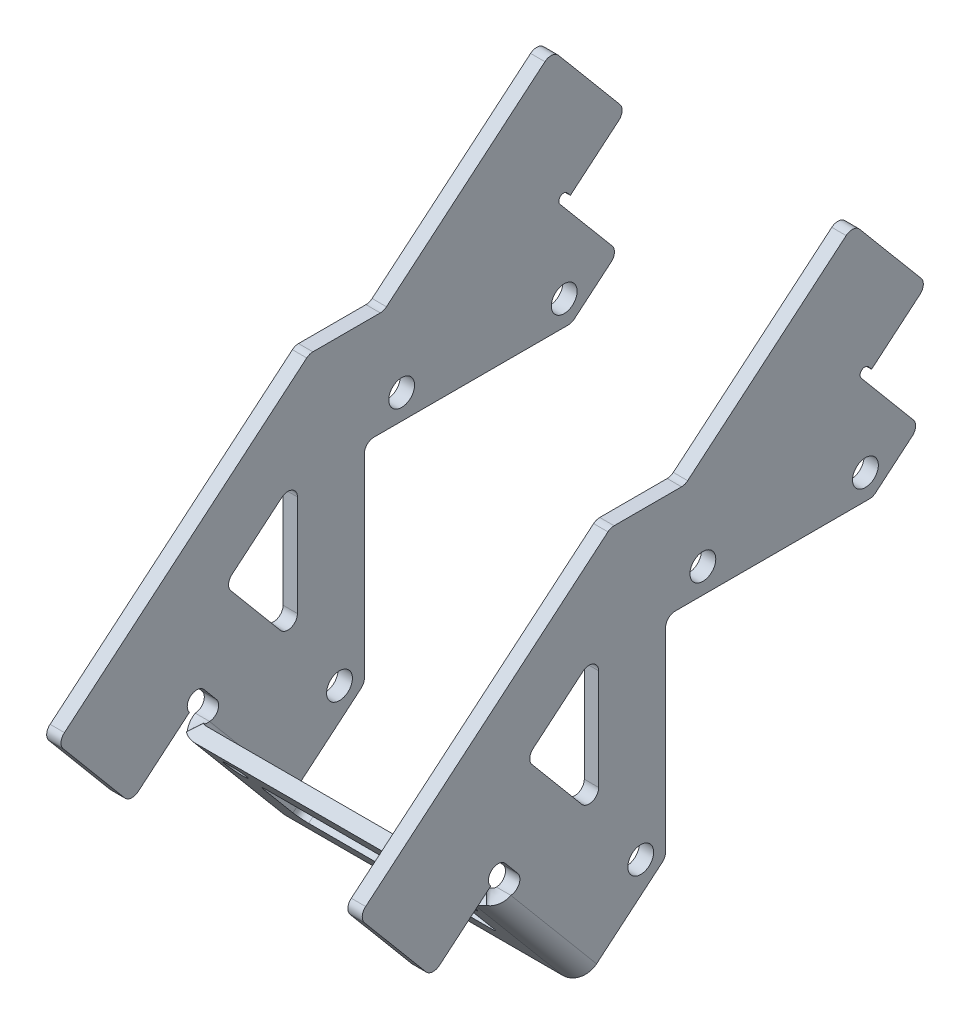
ISO-10303-21;
HEADER;
FILE_DESCRIPTION(('STEP AP214'),'2;1');
FILE_NAME('part.step','',(''),(''),'','','');
FILE_SCHEMA(('AUTOMOTIVE_DESIGN { 1 0 10303 214 1 1 1 1 }'));
ENDSEC;
DATA;
#1=APPLICATION_CONTEXT('core data for automotive mechanical design processes');
#2=APPLICATION_PROTOCOL_DEFINITION('international standard','automotive_design',2000,#1);
#3=PRODUCT_CONTEXT('',#1,'mechanical');
#4=PRODUCT('Part','Part','',(#3));
#5=PRODUCT_RELATED_PRODUCT_CATEGORY('part','',(#4));
#6=PRODUCT_DEFINITION_FORMATION('','',#4);
#7=PRODUCT_DEFINITION_CONTEXT('part definition',#1,'design');
#8=PRODUCT_DEFINITION('design','',#6,#7);
#9=PRODUCT_DEFINITION_SHAPE('','',#8);
#10=(LENGTH_UNIT() NAMED_UNIT(*) SI_UNIT(.MILLI.,.METRE.));
#11=(NAMED_UNIT(*) PLANE_ANGLE_UNIT() SI_UNIT($,.RADIAN.));
#12=(NAMED_UNIT(*) SI_UNIT($,.STERADIAN.) SOLID_ANGLE_UNIT());
#13=UNCERTAINTY_MEASURE_WITH_UNIT(LENGTH_MEASURE(1.E-05),#10,'distance_accuracy_value','');
#14=(GEOMETRIC_REPRESENTATION_CONTEXT(3) GLOBAL_UNCERTAINTY_ASSIGNED_CONTEXT((#13)) GLOBAL_UNIT_ASSIGNED_CONTEXT((#10,
#11,#12)) REPRESENTATION_CONTEXT('',''));
#15=CARTESIAN_POINT('',(0.,0.,0.));
#16=DIRECTION('',(0.,0.,1.));
#17=DIRECTION('',(1.,0.,0.));
#18=AXIS2_PLACEMENT_3D('',#15,#16,#17);
#19=CARTESIAN_POINT('',(16.65,154.900000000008,-3.91494519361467));
#20=DIRECTION('',(-1.,0.,0.));
#21=DIRECTION('',(0.,0.,1.));
#22=AXIS2_PLACEMENT_3D('',#19,#20,#21);
#23=CYLINDRICAL_SURFACE('',#22,1.0000000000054);
#24=DIRECTION('',(1.,0.,0.));
#25=VECTOR('',#24,1.);
#26=CARTESIAN_POINT('',(15.,154.133955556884,-4.55773280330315));
#27=LINE('',#26,#25);
#28=CARTESIAN_POINT('',(16.499999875,154.133955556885,-4.55773280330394));
#29=VERTEX_POINT('',#28);
#30=CARTESIAN_POINT('',(15.,154.133955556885,-4.55773280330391));
#31=VERTEX_POINT('',#30);
#32=EDGE_CURVE('E526',#29,#31,#27,.F.);
#33=ORIENTED_EDGE('',*,*,#32,.F.);
#34=CARTESIAN_POINT('',(16.49999975,154.900000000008,-3.91494519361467));
#35=DIRECTION('',(-1.,0.,0.));
#36=DIRECTION('',(0.,0.,1.));
#37=AXIS2_PLACEMENT_3D('',#34,#35,#36);
#38=CIRCLE('',#37,1.0000000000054);
#39=CARTESIAN_POINT('',(16.499999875,153.900000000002,-3.91494519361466));
#40=VERTEX_POINT('',#39);
#41=EDGE_CURVE('E531',#29,#40,#38,.T.);
#42=ORIENTED_EDGE('',*,*,#41,.T.);
#43=DIRECTION('',(1.,0.,0.));
#44=VECTOR('',#43,1.);
#45=CARTESIAN_POINT('',(15.,153.9,-3.91494519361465));
#46=LINE('',#45,#44);
#47=CARTESIAN_POINT('',(15.,153.900000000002,-3.91494519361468));
#48=VERTEX_POINT('',#47);
#49=EDGE_CURVE('E529',#48,#40,#46,.T.);
#50=ORIENTED_EDGE('',*,*,#49,.F.);
#51=CARTESIAN_POINT('',(15.,154.900000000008,-3.91494519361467));
#52=DIRECTION('',(-1.,0.,0.));
#53=DIRECTION('',(0.,0.,1.));
#54=AXIS2_PLACEMENT_3D('',#51,#52,#53);
#55=CIRCLE('',#54,1.0000000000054);
#56=EDGE_CURVE('E24',#48,#31,#55,.F.);
#57=ORIENTED_EDGE('',*,*,#56,.T.);
#58=EDGE_LOOP('',(#33,#42,#50,#57));
#59=FACE_BOUND('',#58,.T.);
#60=ADVANCED_FACE('F17',(#59),#23,.T.);
#61=CARTESIAN_POINT('',(15.,165.532473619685,-4.14044321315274));
#62=DIRECTION('',(0.,-0.642787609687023,0.766044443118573));
#63=DIRECTION('',(0.,-0.766044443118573,-0.642787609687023));
#64=AXIS2_PLACEMENT_3D('',#61,#62,#63);
#65=PLANE('',#64);
#66=DIRECTION('',(1.,0.,0.));
#67=VECTOR('',#66,1.);
#68=CARTESIAN_POINT('',(14.85,165.915495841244,-3.81904940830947));
#69=LINE('',#68,#67);
#70=CARTESIAN_POINT('',(16.5,165.915495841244,-3.81904940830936));
#71=VERTEX_POINT('',#70);
#72=CARTESIAN_POINT('',(15.,165.915495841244,-3.81904940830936));
#73=VERTEX_POINT('',#72);
#74=EDGE_CURVE('E1019',#71,#73,#69,.F.);
#75=ORIENTED_EDGE('',*,*,#74,.T.);
#76=DIRECTION('',(0.,-0.766044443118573,-0.642787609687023));
#77=VECTOR('',#76,1.);
#78=CARTESIAN_POINT('',(15.,165.532473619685,-4.14044321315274));
#79=LINE('',#78,#77);
#80=CARTESIAN_POINT('',(15.,165.532473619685,-4.14044321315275));
#81=VERTEX_POINT('',#80);
#82=EDGE_CURVE('E1046',#73,#81,#79,.T.);
#83=ORIENTED_EDGE('',*,*,#82,.T.);
#84=DIRECTION('',(1.,0.,0.));
#85=VECTOR('',#84,1.);
#86=CARTESIAN_POINT('',(15.,165.532473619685,-4.14044321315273));
#87=LINE('',#86,#85);
#88=CARTESIAN_POINT('',(16.5,165.532473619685,-4.14044321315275));
#89=VERTEX_POINT('',#88);
#90=EDGE_CURVE('E1011',#89,#81,#87,.F.);
#91=ORIENTED_EDGE('',*,*,#90,.F.);
#92=DIRECTION('',(0.,-0.766044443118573,-0.642787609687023));
#93=VECTOR('',#92,1.);
#94=CARTESIAN_POINT('',(16.5,165.532473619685,-4.14044321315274));
#95=LINE('',#94,#93);
#96=EDGE_CURVE('E1044',#89,#71,#95,.F.);
#97=ORIENTED_EDGE('',*,*,#96,.T.);
#98=EDGE_LOOP('',(#75,#83,#91,#97));
#99=FACE_BOUND('',#98,.T.);
#100=ADVANCED_FACE('F1747',(#99),#65,.T.);
#101=CARTESIAN_POINT('',(14.85,165.826077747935,15.7340627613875));
#102=DIRECTION('',(1.,0.,0.));
#103=DIRECTION('',(0.,1.,0.));
#104=AXIS2_PLACEMENT_3D('',#101,#102,#103);
#105=CYLINDRICAL_SURFACE('',#104,0.999999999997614);
#106=DIRECTION('',(1.,0.,0.));
#107=VECTOR('',#106,1.);
#108=CARTESIAN_POINT('',(15.,164.826077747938,15.7340627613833));
#109=LINE('',#108,#107);
#110=CARTESIAN_POINT('',(16.5,164.826077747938,15.7340627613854));
#111=VERTEX_POINT('',#110);
#112=CARTESIAN_POINT('',(15.,164.826077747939,15.7340627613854));
#113=VERTEX_POINT('',#112);
#114=EDGE_CURVE('E994',#111,#113,#109,.F.);
#115=ORIENTED_EDGE('',*,*,#114,.F.);
#116=CARTESIAN_POINT('',(16.5,165.826077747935,15.7340627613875));
#117=DIRECTION('',(1.,0.,0.));
#118=DIRECTION('',(0.,1.,0.));
#119=AXIS2_PLACEMENT_3D('',#116,#117,#118);
#120=CIRCLE('',#119,0.999999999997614);
#121=CARTESIAN_POINT('',(16.5,165.060033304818,15.0912751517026));
#122=VERTEX_POINT('',#121);
#123=EDGE_CURVE('E1051',#122,#111,#120,.F.);
#124=ORIENTED_EDGE('',*,*,#123,.F.);
#125=DIRECTION('',(1.,0.,0.));
#126=VECTOR('',#125,1.);
#127=CARTESIAN_POINT('',(15.,165.060033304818,15.0912751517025));
#128=LINE('',#127,#126);
#129=CARTESIAN_POINT('',(15.,165.060033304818,15.0912751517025));
#130=VERTEX_POINT('',#129);
#131=EDGE_CURVE('E1002',#130,#122,#128,.T.);
#132=ORIENTED_EDGE('',*,*,#131,.F.);
#133=CARTESIAN_POINT('',(15.,165.826077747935,15.7340627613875));
#134=DIRECTION('',(1.,0.,0.));
#135=DIRECTION('',(0.,1.,0.));
#136=AXIS2_PLACEMENT_3D('',#133,#134,#135);
#137=CIRCLE('',#136,0.999999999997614);
#138=EDGE_CURVE('E1848',#113,#130,#137,.T.);
#139=ORIENTED_EDGE('',*,*,#138,.F.);
#140=EDGE_LOOP('',(#115,#124,#132,#139));
#141=FACE_BOUND('',#140,.T.);
#142=ADVANCED_FACE('F1739',(#141),#105,.F.);
#143=CARTESIAN_POINT('',(16.65,163.826077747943,22.784741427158));
#144=DIRECTION('',(-1.,0.,0.));
#145=DIRECTION('',(0.,0.,1.));
#146=AXIS2_PLACEMENT_3D('',#143,#144,#145);
#147=CYLINDRICAL_SURFACE('',#146,0.999999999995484);
#148=DIRECTION('',(1.,0.,0.));
#149=VECTOR('',#148,1.);
#150=CARTESIAN_POINT('',(15.,164.592122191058,23.4275290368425));
#151=LINE('',#150,#149);
#152=CARTESIAN_POINT('',(16.499999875,164.592122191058,23.427529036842));
#153=VERTEX_POINT('',#152);
#154=CARTESIAN_POINT('',(15.,164.592122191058,23.427529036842));
#155=VERTEX_POINT('',#154);
#156=EDGE_CURVE('E991',#153,#155,#151,.F.);
#157=ORIENTED_EDGE('',*,*,#156,.F.);
#158=CARTESIAN_POINT('',(16.49999975,163.826077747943,22.784741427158));
#159=DIRECTION('',(-1.,0.,0.));
#160=DIRECTION('',(0.,0.,1.));
#161=AXIS2_PLACEMENT_3D('',#158,#159,#160);
#162=CIRCLE('',#161,0.999999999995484);
#163=CARTESIAN_POINT('',(16.499999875,164.826077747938,22.784741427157));
#164=VERTEX_POINT('',#163);
#165=EDGE_CURVE('E1852',#153,#164,#162,.T.);
#166=ORIENTED_EDGE('',*,*,#165,.T.);
#167=DIRECTION('',(1.,0.,0.));
#168=VECTOR('',#167,1.);
#169=CARTESIAN_POINT('',(15.,164.826077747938,22.784741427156));
#170=LINE('',#169,#168);
#171=CARTESIAN_POINT('',(15.,164.826077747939,22.784741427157));
#172=VERTEX_POINT('',#171);
#173=EDGE_CURVE('E997',#172,#164,#170,.T.);
#174=ORIENTED_EDGE('',*,*,#173,.F.);
#175=CARTESIAN_POINT('',(15.,163.826077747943,22.784741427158));
#176=DIRECTION('',(-1.,0.,0.));
#177=DIRECTION('',(0.,0.,1.));
#178=AXIS2_PLACEMENT_3D('',#175,#176,#177);
#179=CIRCLE('',#178,0.999999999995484);
#180=EDGE_CURVE('E1850',#172,#155,#179,.F.);
#181=ORIENTED_EDGE('',*,*,#180,.T.);
#182=EDGE_LOOP('',(#157,#166,#174,#181));
#183=FACE_BOUND('',#182,.T.);
#184=ADVANCED_FACE('F1658',(#183),#147,.T.);
#185=CARTESIAN_POINT('',(-12.,135.011592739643,32.6218571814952));
#186=DIRECTION('',(0.,-0.642787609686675,0.766044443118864));
#187=DIRECTION('',(0.,-0.766044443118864,-0.642787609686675));
#188=AXIS2_PLACEMENT_3D('',#185,#186,#187);
#189=CYLINDRICAL_SURFACE('',#188,0.800000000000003);
#190=CARTESIAN_POINT('',(-12.,134.934458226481,32.7137825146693));
#191=DIRECTION('',(0.,-0.642787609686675,0.766044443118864));
#192=DIRECTION('',(0.,-0.766044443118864,-0.642787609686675));
#193=AXIS2_PLACEMENT_3D('',#190,#191,#192);
#194=CIRCLE('',#193,0.800000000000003);
#195=CARTESIAN_POINT('',(-12.,134.321622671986,32.19955242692));
#196=VERTEX_POINT('',#195);
#197=EDGE_CURVE('E1560',#196,#196,#194,.T.);
#198=ORIENTED_EDGE('',*,*,#197,.F.);
#199=EDGE_LOOP('',(#198));
#200=FACE_BOUND('',#199,.T.);
#201=CARTESIAN_POINT('',(-12.,134.163113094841,33.6330358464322));
#202=DIRECTION('',(0.,-0.642787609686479,0.766044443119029));
#203=DIRECTION('',(0.,-0.766044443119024,-0.642787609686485));
#204=AXIS2_PLACEMENT_3D('',#201,#202,#203);
#205=CIRCLE('',#204,0.800000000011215);
#206=CARTESIAN_POINT('',(-12.,133.550277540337,33.1188057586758));
#207=VERTEX_POINT('',#206);
#208=EDGE_CURVE('E942',#207,#207,#205,.T.);
#209=ORIENTED_EDGE('',*,*,#208,.T.);
#210=EDGE_LOOP('',(#209));
#211=FACE_BOUND('',#210,.T.);
#212=ADVANCED_FACE('F1651',(#200,#211),#189,.F.);
#213=CARTESIAN_POINT('',(12.,135.011592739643,32.6218571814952));
#214=DIRECTION('',(0.,-0.642787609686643,0.766044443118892));
#215=DIRECTION('',(0.,-0.766044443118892,-0.642787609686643));
#216=AXIS2_PLACEMENT_3D('',#213,#214,#215);
#217=CYLINDRICAL_SURFACE('',#216,0.800000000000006);
#218=CARTESIAN_POINT('',(12.,134.934458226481,32.7137825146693));
#219=DIRECTION('',(0.,-0.642787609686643,0.766044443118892));
#220=DIRECTION('',(0.,-0.766044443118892,-0.642787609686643));
#221=AXIS2_PLACEMENT_3D('',#218,#219,#220);
#222=CIRCLE('',#221,0.800000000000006);
#223=CARTESIAN_POINT('',(12.,134.321622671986,32.19955242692));
#224=VERTEX_POINT('',#223);
#225=EDGE_CURVE('E1557',#224,#224,#222,.T.);
#226=ORIENTED_EDGE('',*,*,#225,.F.);
#227=EDGE_LOOP('',(#226));
#228=FACE_BOUND('',#227,.T.);
#229=CARTESIAN_POINT('',(12.,134.163113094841,33.6330358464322));
#230=DIRECTION('',(0.,-0.642787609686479,0.766044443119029));
#231=DIRECTION('',(0.,-0.766044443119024,-0.642787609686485));
#232=AXIS2_PLACEMENT_3D('',#229,#230,#231);
#233=CIRCLE('',#232,0.800000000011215);
#234=CARTESIAN_POINT('',(12.,133.550277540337,33.1188057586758));
#235=VERTEX_POINT('',#234);
#236=EDGE_CURVE('E948',#235,#235,#233,.T.);
#237=ORIENTED_EDGE('',*,*,#236,.T.);
#238=EDGE_LOOP('',(#237));
#239=FACE_BOUND('',#238,.T.);
#240=ADVANCED_FACE('F1279',(#228,#239),#217,.F.);
#241=CARTESIAN_POINT('',(14.5,126.063318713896,24.6173089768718));
#242=DIRECTION('',(0.,0.766044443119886,0.642787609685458));
#243=DIRECTION('',(0.,-0.642787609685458,0.766044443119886));
#244=AXIS2_PLACEMENT_3D('',#241,#242,#243);
#245=CYLINDRICAL_SURFACE('',#244,0.499999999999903);
#246=CARTESIAN_POINT('',(14.9999999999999,136.749638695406,33.5841961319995));
#247=CARTESIAN_POINT('',(14.9999883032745,136.747768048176,33.6178558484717));
#248=CARTESIAN_POINT('',(14.9978206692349,136.747644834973,33.6514998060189));
#249=CARTESIAN_POINT('',(14.9901391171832,136.750726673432,33.7180930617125));
#250=CARTESIAN_POINT('',(14.9846421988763,136.753914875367,33.7510450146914));
#251=CARTESIAN_POINT('',(14.9725318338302,136.762524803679,33.8097232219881));
#252=CARTESIAN_POINT('',(14.9663342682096,136.767401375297,33.8356239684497));
#253=CARTESIAN_POINT('',(14.9527744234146,136.779057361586,33.8866939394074));
#254=CARTESIAN_POINT('',(14.9454115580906,136.785837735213,33.911862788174));
#255=CARTESIAN_POINT('',(14.9299160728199,136.801259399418,33.9614229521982));
#256=CARTESIAN_POINT('',(14.921782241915,136.809903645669,33.98581296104));
#257=CARTESIAN_POINT('',(14.9051881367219,136.829035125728,34.033728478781));
#258=CARTESIAN_POINT('',(14.8967279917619,136.839521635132,34.0572543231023));
#259=CARTESIAN_POINT('',(14.8797108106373,136.862506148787,34.1039238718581));
#260=CARTESIAN_POINT('',(14.8711552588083,136.875040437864,34.1270503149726));
#261=CARTESIAN_POINT('',(14.8546333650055,136.901976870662,34.1724062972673));
#262=CARTESIAN_POINT('',(14.8466671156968,136.916379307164,34.1946356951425));
#263=CARTESIAN_POINT('',(14.8278899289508,136.955859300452,34.250418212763));
#264=CARTESIAN_POINT('',(14.8179974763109,136.982386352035,34.2833117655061));
#265=CARTESIAN_POINT('',(14.8075219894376,137.0257718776,34.3305866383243));
#266=CARTESIAN_POINT('',(14.8047547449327,137.040914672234,34.3460702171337));
#267=CARTESIAN_POINT('',(14.8009805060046,137.072323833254,34.3761651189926));
#268=CARTESIAN_POINT('',(14.7999782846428,137.088593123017,34.3907739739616));
#269=CARTESIAN_POINT('',(14.7999999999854,137.105359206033,34.4048439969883));
#270=B_SPLINE_CURVE_WITH_KNOTS('',3,(#246,#247,#248,#249,#250,#251,#252,#253,#254,#255,#256,
#257,#258,#259,#260,#261,#262,#263,#264,#265,#266,#267,#268,#269),.UNSPECIFIED.,.F.,.F.,(4,2,2,
2,2,2,2,2,2,2,2,4),(0.,0.100866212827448,0.201221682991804,0.282344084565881,0.363507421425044,
0.444800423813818,0.526061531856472,0.608960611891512,0.691872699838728,0.821396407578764,
0.886791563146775,0.952363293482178),.UNSPECIFIED.);
#271=CARTESIAN_POINT('',(15.,136.749638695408,33.5841961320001));
#272=VERTEX_POINT('',#271);
#273=CARTESIAN_POINT('',(14.799999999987,137.105359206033,34.4048439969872));
#274=VERTEX_POINT('',#273);
#275=EDGE_CURVE('E964',#272,#274,#270,.T.);
#276=ORIENTED_EDGE('',*,*,#275,.F.);
#277=DIRECTION('',(0.,0.766044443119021,0.642787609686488));
#278=VECTOR('',#277,1.);
#279=CARTESIAN_POINT('',(15.,126.063318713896,24.617308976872));
#280=LINE('',#279,#278);
#281=CARTESIAN_POINT('',(15.,126.063318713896,24.6173089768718));
#282=VERTEX_POINT('',#281);
#283=EDGE_CURVE('E591',#282,#272,#280,.T.);
#284=ORIENTED_EDGE('',*,*,#283,.F.);
#285=CARTESIAN_POINT('',(14.5,126.063318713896,24.6173089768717));
#286=DIRECTION('',(0.,0.766044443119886,0.642787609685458));
#287=DIRECTION('',(0.,-0.642787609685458,0.766044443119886));
#288=AXIS2_PLACEMENT_3D('',#285,#286,#287);
#289=CIRCLE('',#288,0.499999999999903);
#290=CARTESIAN_POINT('',(14.5,125.741924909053,25.0003311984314));
#291=VERTEX_POINT('',#290);
#292=EDGE_CURVE('E1041',#291,#282,#289,.T.);
#293=ORIENTED_EDGE('',*,*,#292,.F.);
#294=DIRECTION('',(0.,0.766044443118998,0.642787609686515));
#295=VECTOR('',#294,1.);
#296=CARTESIAN_POINT('',(14.5,137.041080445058,34.4814484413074));
#297=LINE('',#296,#295);
#298=CARTESIAN_POINT('',(14.5,137.041080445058,34.4814484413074));
#299=VERTEX_POINT('',#298);
#300=EDGE_CURVE('E932',#299,#291,#297,.F.);
#301=ORIENTED_EDGE('',*,*,#300,.F.);
#302=CARTESIAN_POINT('',(14.5,137.362474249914,34.0984262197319));
#303=DIRECTION('',(0.,0.766044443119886,0.642787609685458));
#304=DIRECTION('',(0.,-0.642787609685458,0.766044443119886));
#305=AXIS2_PLACEMENT_3D('',#302,#303,#304);
#306=CIRCLE('',#305,0.499999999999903);
#307=EDGE_CURVE('E1469',#274,#299,#306,.F.);
#308=ORIENTED_EDGE('',*,*,#307,.F.);
#309=EDGE_LOOP('',(#276,#284,#293,#301,#308));
#310=FACE_BOUND('',#309,.T.);
#311=ADVANCED_FACE('F1273',(#310),#245,.F.);
#312=CARTESIAN_POINT('',(15.,139.156978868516,33.515542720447));
#313=DIRECTION('',(0.,-0.642787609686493,0.766044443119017));
#314=DIRECTION('',(0.,-0.766044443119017,-0.642787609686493));
#315=AXIS2_PLACEMENT_3D('',#312,#313,#314);
#316=PLANE('',#315);
#317=DIRECTION('',(0.,-0.766044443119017,-0.642787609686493));
#318=VECTOR('',#317,1.);
#319=CARTESIAN_POINT('',(16.5,139.156978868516,33.515542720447));
#320=LINE('',#319,#318);
#321=CARTESIAN_POINT('',(16.5,138.390934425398,32.8727551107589));
#322=VERTEX_POINT('',#321);
#323=CARTESIAN_POINT('',(16.5,139.923023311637,34.158330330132));
#324=VERTEX_POINT('',#323);
#325=EDGE_CURVE('E1029',#322,#324,#320,.F.);
#326=ORIENTED_EDGE('',*,*,#325,.T.);
#327=DIRECTION('',(1.,0.,0.));
#328=VECTOR('',#327,1.);
#329=CARTESIAN_POINT('',(14.85,139.923023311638,34.1583303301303));
#330=LINE('',#329,#328);
#331=CARTESIAN_POINT('',(15.,139.923023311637,34.1583303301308));
#332=VERTEX_POINT('',#331);
#333=EDGE_CURVE('E981',#324,#332,#330,.F.);
#334=ORIENTED_EDGE('',*,*,#333,.T.);
#335=DIRECTION('',(0.,0.766044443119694,0.642787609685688));
#336=VECTOR('',#335,1.);
#337=CARTESIAN_POINT('',(15.,138.390934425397,32.8727551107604));
#338=LINE('',#337,#336);
#339=CARTESIAN_POINT('',(15.,138.390934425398,32.8727551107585));
#340=VERTEX_POINT('',#339);
#341=EDGE_CURVE('E587',#340,#332,#338,.T.);
#342=ORIENTED_EDGE('',*,*,#341,.F.);
#343=DIRECTION('',(1.,0.,0.));
#344=VECTOR('',#343,1.);
#345=CARTESIAN_POINT('',(14.85,138.3909344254,32.8727551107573));
#346=LINE('',#345,#344);
#347=EDGE_CURVE('E975',#340,#322,#346,.T.);
#348=ORIENTED_EDGE('',*,*,#347,.T.);
#349=EDGE_LOOP('',(#326,#334,#342,#348));
#350=FACE_BOUND('',#349,.T.);
#351=ADVANCED_FACE('F1278',(#350),#316,.T.);
#352=CARTESIAN_POINT('',(15.,152.899999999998,17.3999999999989));
#353=DIRECTION('',(0.,0.,-1.));
#354=DIRECTION('',(0.,1.,0.));
#355=AXIS2_PLACEMENT_3D('',#352,#353,#354);
#356=PLANE('',#355);
#357=DIRECTION('',(-1.,0.,0.));
#358=VECTOR('',#357,1.);
#359=CARTESIAN_POINT('',(16.65,132.585667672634,17.400000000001));
#360=LINE('',#359,#358);
#361=CARTESIAN_POINT('',(15.,132.585667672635,17.3999999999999));
#362=VERTEX_POINT('',#361);
#363=CARTESIAN_POINT('',(16.5,132.585667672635,17.4000000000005));
#364=VERTEX_POINT('',#363);
#365=EDGE_CURVE('E1030',#362,#364,#360,.F.);
#366=ORIENTED_EDGE('',*,*,#365,.F.);
#367=DIRECTION('',(0.,1.,0.));
#368=VECTOR('',#367,1.);
#369=CARTESIAN_POINT('',(15.,142.687680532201,17.3999999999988));
#370=LINE('',#369,#368);
#371=CARTESIAN_POINT('',(15.,152.900000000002,17.3999999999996));
#372=VERTEX_POINT('',#371);
#373=EDGE_CURVE('E594',#372,#362,#370,.F.);
#374=ORIENTED_EDGE('',*,*,#373,.F.);
#375=DIRECTION('',(1.,0.,0.));
#376=VECTOR('',#375,1.);
#377=CARTESIAN_POINT('',(14.85,152.900000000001,17.4000000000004));
#378=LINE('',#377,#376);
#379=CARTESIAN_POINT('',(16.5,152.900000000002,17.4000000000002));
#380=VERTEX_POINT('',#379);
#381=EDGE_CURVE('E1027',#372,#380,#378,.T.);
#382=ORIENTED_EDGE('',*,*,#381,.T.);
#383=DIRECTION('',(0.,1.,0.));
#384=VECTOR('',#383,1.);
#385=CARTESIAN_POINT('',(16.5,142.687680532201,17.4));
#386=LINE('',#385,#384);
#387=EDGE_CURVE('E662',#364,#380,#386,.T.);
#388=ORIENTED_EDGE('',*,*,#387,.F.);
#389=EDGE_LOOP('',(#366,#374,#382,#388));
#390=FACE_BOUND('',#389,.T.);
#391=ADVANCED_FACE('F1284',(#390),#356,.T.);
#392=CARTESIAN_POINT('',(14.85,152.900000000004,16.4));
#393=DIRECTION('',(1.,0.,0.));
#394=DIRECTION('',(0.,0.,-1.));
#395=AXIS2_PLACEMENT_3D('',#392,#393,#394);
#396=CYLINDRICAL_SURFACE('',#395,1.00000000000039);
#397=DIRECTION('',(1.,0.,0.));
#398=VECTOR('',#397,1.);
#399=CARTESIAN_POINT('',(15.,153.9,16.3999999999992));
#400=LINE('',#399,#398);
#401=CARTESIAN_POINT('',(16.5,153.900000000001,16.3999999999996));
#402=VERTEX_POINT('',#401);
#403=CARTESIAN_POINT('',(15.,153.900000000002,16.3999999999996));
#404=VERTEX_POINT('',#403);
#405=EDGE_CURVE('E540',#402,#404,#400,.F.);
#406=ORIENTED_EDGE('',*,*,#405,.F.);
#407=CARTESIAN_POINT('',(16.5,152.900000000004,16.4));
#408=DIRECTION('',(1.,0.,0.));
#409=DIRECTION('',(0.,0.,-1.));
#410=AXIS2_PLACEMENT_3D('',#407,#408,#409);
#411=CIRCLE('',#410,1.00000000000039);
#412=EDGE_CURVE('E661',#380,#402,#411,.F.);
#413=ORIENTED_EDGE('',*,*,#412,.F.);
#414=ORIENTED_EDGE('',*,*,#381,.F.);
#415=CARTESIAN_POINT('',(15.,152.900000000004,16.4));
#416=DIRECTION('',(1.,0.,0.));
#417=DIRECTION('',(0.,0.,-1.));
#418=AXIS2_PLACEMENT_3D('',#415,#416,#417);
#419=CIRCLE('',#418,1.00000000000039);
#420=EDGE_CURVE('E549',#404,#372,#419,.T.);
#421=ORIENTED_EDGE('',*,*,#420,.F.);
#422=EDGE_LOOP('',(#406,#413,#414,#421));
#423=FACE_BOUND('',#422,.T.);
#424=ADVANCED_FACE('F1288',(#423),#396,.F.);
#425=CARTESIAN_POINT('',(15.,153.9,-3.91494519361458));
#426=DIRECTION('',(0.,-1.,0.));
#427=DIRECTION('',(0.,0.,-1.));
#428=AXIS2_PLACEMENT_3D('',#425,#426,#427);
#429=PLANE('',#428);
#430=ORIENTED_EDGE('',*,*,#405,.T.);
#431=DIRECTION('',(0.,0.,1.));
#432=VECTOR('',#431,1.);
#433=CARTESIAN_POINT('',(15.,153.900000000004,49.5322260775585));
#434=LINE('',#433,#432);
#435=EDGE_CURVE('E547',#48,#404,#434,.T.);
#436=ORIENTED_EDGE('',*,*,#435,.F.);
#437=ORIENTED_EDGE('',*,*,#49,.T.);
#438=DIRECTION('',(0.,0.,-1.));
#439=VECTOR('',#438,1.);
#440=CARTESIAN_POINT('',(16.5,153.900000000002,49.5322260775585));
#441=LINE('',#440,#439);
#442=EDGE_CURVE('E658',#402,#40,#441,.T.);
#443=ORIENTED_EDGE('',*,*,#442,.F.);
#444=EDGE_LOOP('',(#430,#436,#437,#443));
#445=FACE_BOUND('',#444,.T.);
#446=ADVANCED_FACE('F1292',(#445),#429,.T.);
#447=CARTESIAN_POINT('',(15.,154.133955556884,-4.55773280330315));
#448=DIRECTION('',(0.,-0.766044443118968,-0.642787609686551));
#449=DIRECTION('',(0.,0.642787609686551,-0.766044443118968));
#450=AXIS2_PLACEMENT_3D('',#447,#448,#449);
#451=PLANE('',#450);
#452=DIRECTION('',(0.,0.642787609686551,-0.766044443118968));
#453=VECTOR('',#452,1.);
#454=CARTESIAN_POINT('',(16.5,154.133955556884,-4.55773280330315));
#455=LINE('',#454,#453);
#456=CARTESIAN_POINT('',(16.5,157.352498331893,-8.39344271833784));
#457=VERTEX_POINT('',#456);
#458=EDGE_CURVE('E538',#29,#457,#455,.T.);
#459=ORIENTED_EDGE('',*,*,#458,.F.);
#460=ORIENTED_EDGE('',*,*,#32,.T.);
#461=DIRECTION('',(0.,-0.642787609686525,0.76604444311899));
#462=VECTOR('',#461,1.);
#463=CARTESIAN_POINT('',(15.,157.352498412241,-8.39344281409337));
#464=LINE('',#463,#462);
#465=CARTESIAN_POINT('',(15.,157.352498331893,-8.39344271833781));
#466=VERTEX_POINT('',#465);
#467=EDGE_CURVE('E535',#466,#31,#464,.T.);
#468=ORIENTED_EDGE('',*,*,#467,.F.);
#469=DIRECTION('',(-1.,0.,0.));
#470=VECTOR('',#469,1.);
#471=CARTESIAN_POINT('',(16.65,157.352498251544,-8.39344262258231));
#472=LINE('',#471,#470);
#473=EDGE_CURVE('E539',#457,#466,#472,.T.);
#474=ORIENTED_EDGE('',*,*,#473,.F.);
#475=EDGE_LOOP('',(#459,#460,#468,#474));
#476=FACE_BOUND('',#475,.T.);
#477=ADVANCED_FACE('F534',(#476),#451,.T.);
#478=CARTESIAN_POINT('',(16.65,158.118542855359,-7.75065520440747));
#479=DIRECTION('',(-1.,0.,0.));
#480=DIRECTION('',(0.,0.,1.));
#481=AXIS2_PLACEMENT_3D('',#478,#479,#480);
#482=CYLINDRICAL_SURFACE('',#481,0.999999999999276);
#483=DIRECTION('',(1.,0.,0.));
#484=VECTOR('',#483,1.);
#485=CARTESIAN_POINT('',(15.,158.761330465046,-8.51669964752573));
#486=LINE('',#485,#484);
#487=CARTESIAN_POINT('',(16.5,158.761330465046,-8.51669964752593));
#488=VERTEX_POINT('',#487);
#489=CARTESIAN_POINT('',(15.,158.761330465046,-8.51669964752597));
#490=VERTEX_POINT('',#489);
#491=EDGE_CURVE('E1022',#488,#490,#486,.F.);
#492=ORIENTED_EDGE('',*,*,#491,.F.);
#493=CARTESIAN_POINT('',(16.5,158.118542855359,-7.75065520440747));
#494=DIRECTION('',(-1.,0.,0.));
#495=DIRECTION('',(0.,0.,1.));
#496=AXIS2_PLACEMENT_3D('',#493,#494,#495);
#497=CIRCLE('',#496,0.999999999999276);
#498=EDGE_CURVE('E654',#457,#488,#497,.F.);
#499=ORIENTED_EDGE('',*,*,#498,.F.);
#500=ORIENTED_EDGE('',*,*,#473,.T.);
#501=CARTESIAN_POINT('',(15.,158.118542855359,-7.75065520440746));
#502=DIRECTION('',(-1.,0.,0.));
#503=DIRECTION('',(0.,0.,1.));
#504=AXIS2_PLACEMENT_3D('',#501,#502,#503);
#505=CIRCLE('',#504,0.999999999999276);
#506=EDGE_CURVE('E546',#490,#466,#505,.T.);
#507=ORIENTED_EDGE('',*,*,#506,.F.);
#508=EDGE_LOOP('',(#492,#499,#500,#507));
#509=FACE_BOUND('',#508,.T.);
#510=ADVANCED_FACE('F1299',(#509),#482,.T.);
#511=CARTESIAN_POINT('',(15.,164.889686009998,-3.37439877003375));
#512=DIRECTION('',(0.,0.642787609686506,-0.766044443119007));
#513=DIRECTION('',(0.,0.766044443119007,0.642787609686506));
#514=AXIS2_PLACEMENT_3D('',#511,#512,#513);
#515=PLANE('',#514);
#516=DIRECTION('',(0.,0.766044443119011,0.642787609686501));
#517=VECTOR('',#516,1.);
#518=CARTESIAN_POINT('',(16.5,158.761330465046,-8.51669964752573));
#519=LINE('',#518,#517);
#520=CARTESIAN_POINT('',(16.5,165.272708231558,-3.05300496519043));
#521=VERTEX_POINT('',#520);
#522=EDGE_CURVE('E652',#488,#521,#519,.T.);
#523=ORIENTED_EDGE('',*,*,#522,.F.);
#524=ORIENTED_EDGE('',*,*,#491,.T.);
#525=DIRECTION('',(0.,-0.766044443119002,-0.642787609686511));
#526=VECTOR('',#525,1.);
#527=CARTESIAN_POINT('',(15.,164.889686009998,-3.37439877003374));
#528=LINE('',#527,#526);
#529=CARTESIAN_POINT('',(15.,165.272708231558,-3.05300496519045));
#530=VERTEX_POINT('',#529);
#531=EDGE_CURVE('E551',#530,#490,#528,.T.);
#532=ORIENTED_EDGE('',*,*,#531,.F.);
#533=DIRECTION('',(1.,0.,0.));
#534=VECTOR('',#533,1.);
#535=CARTESIAN_POINT('',(14.85,165.272708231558,-3.05300496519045));
#536=LINE('',#535,#534);
#537=EDGE_CURVE('E1014',#530,#521,#536,.T.);
#538=ORIENTED_EDGE('',*,*,#537,.T.);
#539=EDGE_LOOP('',(#523,#524,#532,#538));
#540=FACE_BOUND('',#539,.T.);
#541=ADVANCED_FACE('F1302',(#540),#515,.T.);
#542=CARTESIAN_POINT('',(14.85,165.594102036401,-3.43602718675));
#543=DIRECTION('',(1.,0.,0.));
#544=DIRECTION('',(0.,0.,-1.));
#545=AXIS2_PLACEMENT_3D('',#542,#543,#544);
#546=CYLINDRICAL_SURFACE('',#545,0.499999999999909);
#547=CARTESIAN_POINT('',(15.,165.594102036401,-3.43602718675));
#548=DIRECTION('',(1.,0.,0.));
#549=DIRECTION('',(0.,0.,-1.));
#550=AXIS2_PLACEMENT_3D('',#547,#548,#549);
#551=CIRCLE('',#550,0.499999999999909);
#552=EDGE_CURVE('E556',#73,#530,#551,.T.);
#553=ORIENTED_EDGE('',*,*,#552,.F.);
#554=ORIENTED_EDGE('',*,*,#74,.F.);
#555=CARTESIAN_POINT('',(16.5,165.594102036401,-3.43602718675));
#556=DIRECTION('',(1.,0.,0.));
#557=DIRECTION('',(0.,0.,-1.));
#558=AXIS2_PLACEMENT_3D('',#555,#556,#557);
#559=CIRCLE('',#558,0.499999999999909);
#560=EDGE_CURVE('E649',#521,#71,#559,.F.);
#561=ORIENTED_EDGE('',*,*,#560,.F.);
#562=ORIENTED_EDGE('',*,*,#537,.F.);
#563=EDGE_LOOP('',(#553,#554,#561,#562));
#564=FACE_BOUND('',#563,.T.);
#565=ADVANCED_FACE('F1306',(#564),#546,.F.);
#566=CARTESIAN_POINT('',(15.,165.532473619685,-4.14044321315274));
#567=DIRECTION('',(0.,-0.766044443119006,-0.642787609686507));
#568=DIRECTION('',(0.,0.642787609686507,-0.766044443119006));
#569=AXIS2_PLACEMENT_3D('',#566,#567,#568);
#570=PLANE('',#569);
#571=DIRECTION('',(0.,0.642787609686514,-0.766044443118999));
#572=VECTOR('',#571,1.);
#573=CARTESIAN_POINT('',(16.5,165.532473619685,-4.14044321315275));
#574=LINE('',#573,#572);
#575=CARTESIAN_POINT('',(16.5,169.774871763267,-9.19633644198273));
#576=VERTEX_POINT('',#575);
#577=EDGE_CURVE('E646',#89,#576,#574,.T.);
#578=ORIENTED_EDGE('',*,*,#577,.F.);
#579=ORIENTED_EDGE('',*,*,#90,.T.);
#580=DIRECTION('',(0.,-0.6427876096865,0.766044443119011));
#581=VECTOR('',#580,1.);
#582=CARTESIAN_POINT('',(15.,169.774871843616,-9.19633653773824));
#583=LINE('',#582,#581);
#584=CARTESIAN_POINT('',(15.,169.774871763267,-9.19633644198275));
#585=VERTEX_POINT('',#584);
#586=EDGE_CURVE('E559',#585,#81,#583,.T.);
#587=ORIENTED_EDGE('',*,*,#586,.F.);
#588=DIRECTION('',(-1.,0.,0.));
#589=VECTOR('',#588,1.);
#590=CARTESIAN_POINT('',(16.65,169.774871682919,-9.19633634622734));
#591=LINE('',#590,#589);
#592=EDGE_CURVE('E1009',#576,#585,#591,.T.);
#593=ORIENTED_EDGE('',*,*,#592,.F.);
#594=EDGE_LOOP('',(#578,#579,#587,#593));
#595=FACE_BOUND('',#594,.T.);
#596=ADVANCED_FACE('F1310',(#595),#570,.T.);
#597=CARTESIAN_POINT('',(16.65,170.540916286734,-8.55354892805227));
#598=DIRECTION('',(-1.,0.,0.));
#599=DIRECTION('',(0.,0.,1.));
#600=AXIS2_PLACEMENT_3D('',#597,#598,#599);
#601=CYLINDRICAL_SURFACE('',#600,0.999999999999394);
#602=DIRECTION('',(1.,0.,0.));
#603=VECTOR('',#602,1.);
#604=CARTESIAN_POINT('',(15.,171.183703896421,-9.31959337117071));
#605=LINE('',#604,#603);
#606=CARTESIAN_POINT('',(16.5,171.183703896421,-9.31959337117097));
#607=VERTEX_POINT('',#606);
#608=CARTESIAN_POINT('',(15.,171.183703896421,-9.31959337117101));
#609=VERTEX_POINT('',#608);
#610=EDGE_CURVE('E1007',#607,#609,#605,.F.);
#611=ORIENTED_EDGE('',*,*,#610,.F.);
#612=CARTESIAN_POINT('',(16.5,170.540916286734,-8.55354892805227));
#613=DIRECTION('',(-1.,0.,0.));
#614=DIRECTION('',(0.,0.,1.));
#615=AXIS2_PLACEMENT_3D('',#612,#613,#614);
#616=CIRCLE('',#615,0.999999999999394);
#617=EDGE_CURVE('E645',#576,#607,#616,.F.);
#618=ORIENTED_EDGE('',*,*,#617,.F.);
#619=ORIENTED_EDGE('',*,*,#592,.T.);
#620=CARTESIAN_POINT('',(15.,170.540916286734,-8.55354892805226));
#621=DIRECTION('',(-1.,0.,0.));
#622=DIRECTION('',(0.,0.,1.));
#623=AXIS2_PLACEMENT_3D('',#620,#621,#622);
#624=CIRCLE('',#623,0.999999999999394);
#625=EDGE_CURVE('E562',#609,#585,#624,.T.);
#626=ORIENTED_EDGE('',*,*,#625,.F.);
#627=EDGE_LOOP('',(#611,#618,#619,#626));
#628=FACE_BOUND('',#627,.T.);
#629=ADVANCED_FACE('F1314',(#628),#601,.T.);
#630=CARTESIAN_POINT('',(15.,178.844148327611,-2.89171727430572));
#631=DIRECTION('',(0.,0.642787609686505,-0.766044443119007));
#632=DIRECTION('',(0.,0.766044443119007,0.642787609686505));
#633=AXIS2_PLACEMENT_3D('',#630,#631,#632);
#634=PLANE('',#633);
#635=ORIENTED_EDGE('',*,*,#610,.T.);
#636=DIRECTION('',(0.,-0.766044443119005,-0.642787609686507));
#637=VECTOR('',#636,1.);
#638=CARTESIAN_POINT('',(15.,178.844148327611,-2.89171727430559));
#639=LINE('',#638,#637);
#640=CARTESIAN_POINT('',(15.,178.844148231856,-2.89171735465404));
#641=VERTEX_POINT('',#640);
#642=EDGE_CURVE('E565',#641,#609,#639,.T.);
#643=ORIENTED_EDGE('',*,*,#642,.F.);
#644=DIRECTION('',(-1.,0.,0.));
#645=VECTOR('',#644,1.);
#646=CARTESIAN_POINT('',(16.65,178.8441481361,-2.89171743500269));
#647=LINE('',#646,#645);
#648=CARTESIAN_POINT('',(16.5,178.844148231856,-2.89171735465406));
#649=VERTEX_POINT('',#648);
#650=EDGE_CURVE('E1005',#649,#641,#647,.T.);
#651=ORIENTED_EDGE('',*,*,#650,.F.);
#652=DIRECTION('',(0.,0.766044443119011,0.6427876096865));
#653=VECTOR('',#652,1.);
#654=CARTESIAN_POINT('',(16.5,171.183703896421,-9.31959337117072));
#655=LINE('',#654,#653);
#656=EDGE_CURVE('E642',#607,#649,#655,.T.);
#657=ORIENTED_EDGE('',*,*,#656,.F.);
#658=EDGE_LOOP('',(#635,#643,#651,#657));
#659=FACE_BOUND('',#658,.T.);
#660=ADVANCED_FACE('F1318',(#659),#634,.T.);
#661=CARTESIAN_POINT('',(16.65,178.201360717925,-2.12567283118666));
#662=DIRECTION('',(-1.,0.,0.));
#663=DIRECTION('',(0.,-1.,0.));
#664=AXIS2_PLACEMENT_3D('',#661,#662,#663);
#665=CYLINDRICAL_SURFACE('',#664,0.999999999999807);
#666=DIRECTION('',(1.,0.,0.));
#667=VECTOR('',#666,1.);
#668=CARTESIAN_POINT('',(15.,178.967405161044,-1.4828852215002));
#669=LINE('',#668,#667);
#670=CARTESIAN_POINT('',(16.5,178.967405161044,-1.48288522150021));
#671=VERTEX_POINT('',#670);
#672=CARTESIAN_POINT('',(15.,178.967405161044,-1.48288522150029));
#673=VERTEX_POINT('',#672);
#674=EDGE_CURVE('E1000',#671,#673,#669,.F.);
#675=ORIENTED_EDGE('',*,*,#674,.F.);
#676=CARTESIAN_POINT('',(16.5,178.201360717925,-2.12567283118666));
#677=DIRECTION('',(-1.,0.,0.));
#678=DIRECTION('',(0.,-1.,0.));
#679=AXIS2_PLACEMENT_3D('',#676,#677,#678);
#680=CIRCLE('',#679,0.999999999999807);
#681=EDGE_CURVE('E641',#649,#671,#680,.F.);
#682=ORIENTED_EDGE('',*,*,#681,.F.);
#683=ORIENTED_EDGE('',*,*,#650,.T.);
#684=CARTESIAN_POINT('',(15.,178.201360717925,-2.12567283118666));
#685=DIRECTION('',(-1.,0.,0.));
#686=DIRECTION('',(0.,-1.,0.));
#687=AXIS2_PLACEMENT_3D('',#684,#685,#686);
#688=CIRCLE('',#687,0.999999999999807);
#689=EDGE_CURVE('E568',#673,#641,#688,.T.);
#690=ORIENTED_EDGE('',*,*,#689,.F.);
#691=EDGE_LOOP('',(#675,#682,#683,#690));
#692=FACE_BOUND('',#691,.T.);
#693=ADVANCED_FACE('F1322',(#692),#665,.T.);
#694=CARTESIAN_POINT('',(15.,165.060033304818,15.0912751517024));
#695=DIRECTION('',(0.,0.766044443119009,0.642787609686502));
#696=DIRECTION('',(0.,-0.642787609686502,0.766044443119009));
#697=AXIS2_PLACEMENT_3D('',#694,#695,#696);
#698=PLANE('',#697);
#699=ORIENTED_EDGE('',*,*,#674,.T.);
#700=DIRECTION('',(0.,0.642787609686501,-0.766044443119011));
#701=VECTOR('',#700,1.);
#702=CARTESIAN_POINT('',(15.,165.060033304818,15.0912751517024));
#703=LINE('',#702,#701);
#704=EDGE_CURVE('E569',#130,#673,#703,.T.);
#705=ORIENTED_EDGE('',*,*,#704,.F.);
#706=ORIENTED_EDGE('',*,*,#131,.T.);
#707=DIRECTION('',(0.,-0.642787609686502,0.76604444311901));
#708=VECTOR('',#707,1.);
#709=CARTESIAN_POINT('',(16.5,178.967405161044,-1.4828852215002));
#710=LINE('',#709,#708);
#711=EDGE_CURVE('E638',#671,#122,#710,.T.);
#712=ORIENTED_EDGE('',*,*,#711,.F.);
#713=EDGE_LOOP('',(#699,#705,#706,#712));
#714=FACE_BOUND('',#713,.T.);
#715=ADVANCED_FACE('F1326',(#714),#698,.T.);
#716=CARTESIAN_POINT('',(15.,164.826077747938,22.784741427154));
#717=DIRECTION('',(0.,1.,0.));
#718=DIRECTION('',(0.,0.,1.));
#719=AXIS2_PLACEMENT_3D('',#716,#717,#718);
#720=PLANE('',#719);
#721=ORIENTED_EDGE('',*,*,#114,.T.);
#722=DIRECTION('',(0.,0.,1.));
#723=VECTOR('',#722,1.);
#724=CARTESIAN_POINT('',(15.,164.826077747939,49.5322260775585));
#725=LINE('',#724,#723);
#726=EDGE_CURVE('E572',#172,#113,#725,.F.);
#727=ORIENTED_EDGE('',*,*,#726,.F.);
#728=ORIENTED_EDGE('',*,*,#173,.T.);
#729=DIRECTION('',(0.,0.,-1.));
#730=VECTOR('',#729,1.);
#731=CARTESIAN_POINT('',(16.5,164.826077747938,49.5322260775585));
#732=LINE('',#731,#730);
#733=EDGE_CURVE('E635',#111,#164,#732,.F.);
#734=ORIENTED_EDGE('',*,*,#733,.F.);
#735=EDGE_LOOP('',(#721,#727,#728,#734));
#736=FACE_BOUND('',#735,.T.);
#737=ADVANCED_FACE('F1330',(#736),#720,.T.);
#738=CARTESIAN_POINT('',(15.,164.592122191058,23.4275290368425));
#739=DIRECTION('',(0.,0.766044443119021,0.642787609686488));
#740=DIRECTION('',(0.,-0.642787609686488,0.766044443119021));
#741=AXIS2_PLACEMENT_3D('',#738,#739,#740);
#742=PLANE('',#741);
#743=DIRECTION('',(0.,-0.642787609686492,0.766044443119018));
#744=VECTOR('',#743,1.);
#745=CARTESIAN_POINT('',(16.5,164.592122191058,23.4275290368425));
#746=LINE('',#745,#744);
#747=CARTESIAN_POINT('',(16.5,143.330468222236,48.7661815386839));
#748=VERTEX_POINT('',#747);
#749=EDGE_CURVE('E632',#153,#748,#746,.T.);
#750=ORIENTED_EDGE('',*,*,#749,.F.);
#751=ORIENTED_EDGE('',*,*,#156,.T.);
#752=DIRECTION('',(0.,0.642787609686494,-0.766044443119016));
#753=VECTOR('',#752,1.);
#754=CARTESIAN_POINT('',(15.,143.330468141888,48.7661816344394));
#755=LINE('',#754,#753);
#756=CARTESIAN_POINT('',(15.,143.330468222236,48.7661815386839));
#757=VERTEX_POINT('',#756);
#758=EDGE_CURVE('E575',#757,#155,#755,.T.);
#759=ORIENTED_EDGE('',*,*,#758,.F.);
#760=DIRECTION('',(1.,0.,0.));
#761=VECTOR('',#760,1.);
#762=CARTESIAN_POINT('',(14.85,143.330468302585,48.7661814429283));
#763=LINE('',#762,#761);
#764=EDGE_CURVE('E989',#748,#757,#763,.F.);
#765=ORIENTED_EDGE('',*,*,#764,.F.);
#766=EDGE_LOOP('',(#750,#751,#759,#765));
#767=FACE_BOUND('',#766,.T.);
#768=ADVANCED_FACE('F1334',(#767),#742,.T.);
#769=CARTESIAN_POINT('',(14.85,142.564423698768,48.1233940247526));
#770=DIRECTION('',(1.,0.,0.));
#771=DIRECTION('',(0.,0.,-1.));
#772=AXIS2_PLACEMENT_3D('',#769,#770,#771);
#773=CYLINDRICAL_SURFACE('',#772,1.00000000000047);
#774=ORIENTED_EDGE('',*,*,#764,.T.);
#775=CARTESIAN_POINT('',(15.,142.564423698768,48.1233940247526));
#776=DIRECTION('',(1.,0.,0.));
#777=DIRECTION('',(0.,0.,-1.));
#778=AXIS2_PLACEMENT_3D('',#775,#776,#777);
#779=CIRCLE('',#778,1.00000000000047);
#780=CARTESIAN_POINT('',(15.,141.921636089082,48.8894384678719));
#781=VERTEX_POINT('',#780);
#782=EDGE_CURVE('E578',#781,#757,#779,.F.);
#783=ORIENTED_EDGE('',*,*,#782,.F.);
#784=DIRECTION('',(1.,0.,0.));
#785=VECTOR('',#784,1.);
#786=CARTESIAN_POINT('',(16.5,141.921636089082,48.889438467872));
#787=LINE('',#786,#785);
#788=CARTESIAN_POINT('',(16.5,141.921636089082,48.8894384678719));
#789=VERTEX_POINT('',#788);
#790=EDGE_CURVE('E987',#789,#781,#787,.F.);
#791=ORIENTED_EDGE('',*,*,#790,.F.);
#792=CARTESIAN_POINT('',(16.5,142.564423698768,48.1233940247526));
#793=DIRECTION('',(1.,0.,0.));
#794=DIRECTION('',(0.,0.,-1.));
#795=AXIS2_PLACEMENT_3D('',#792,#793,#794);
#796=CIRCLE('',#795,1.00000000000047);
#797=EDGE_CURVE('E631',#748,#789,#796,.T.);
#798=ORIENTED_EDGE('',*,*,#797,.F.);
#799=EDGE_LOOP('',(#774,#783,#791,#798));
#800=FACE_BOUND('',#799,.T.);
#801=ADVANCED_FACE('F1338',(#800),#773,.T.);
#802=CARTESIAN_POINT('',(16.5,134.261191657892,42.4615623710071));
#803=DIRECTION('',(0.,-0.642787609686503,0.766044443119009));
#804=DIRECTION('',(0.,-0.766044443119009,-0.642787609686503));
#805=AXIS2_PLACEMENT_3D('',#802,#803,#804);
#806=PLANE('',#805);
#807=DIRECTION('',(0.,0.766044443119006,0.642787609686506));
#808=VECTOR('',#807,1.);
#809=CARTESIAN_POINT('',(15.,134.261191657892,42.4615623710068));
#810=LINE('',#809,#808);
#811=CARTESIAN_POINT('',(15.,134.261191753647,42.4615624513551));
#812=VERTEX_POINT('',#811);
#813=EDGE_CURVE('E579',#812,#781,#810,.T.);
#814=ORIENTED_EDGE('',*,*,#813,.F.);
#815=DIRECTION('',(1.,0.,0.));
#816=VECTOR('',#815,1.);
#817=CARTESIAN_POINT('',(14.85,134.261191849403,42.4615625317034));
#818=LINE('',#817,#816);
#819=CARTESIAN_POINT('',(16.5,134.261191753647,42.4615624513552));
#820=VERTEX_POINT('',#819);
#821=EDGE_CURVE('E985',#820,#812,#818,.F.);
#822=ORIENTED_EDGE('',*,*,#821,.F.);
#823=DIRECTION('',(0.,-0.766044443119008,-0.642787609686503));
#824=VECTOR('',#823,1.);
#825=CARTESIAN_POINT('',(16.5,141.921636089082,48.889438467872));
#826=LINE('',#825,#824);
#827=EDGE_CURVE('E628',#789,#820,#826,.T.);
#828=ORIENTED_EDGE('',*,*,#827,.F.);
#829=ORIENTED_EDGE('',*,*,#790,.T.);
#830=EDGE_LOOP('',(#814,#822,#828,#829));
#831=FACE_BOUND('',#830,.T.);
#832=ADVANCED_FACE('F1342',(#831),#806,.T.);
#833=CARTESIAN_POINT('',(14.85,134.903979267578,41.6955179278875));
#834=DIRECTION('',(1.,0.,0.));
#835=DIRECTION('',(0.,1.,0.));
#836=AXIS2_PLACEMENT_3D('',#833,#834,#835);
#837=CYLINDRICAL_SURFACE('',#836,0.999999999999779);
#838=ORIENTED_EDGE('',*,*,#821,.T.);
#839=CARTESIAN_POINT('',(15.,134.903979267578,41.6955179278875));
#840=DIRECTION('',(1.,0.,0.));
#841=DIRECTION('',(0.,1.,0.));
#842=AXIS2_PLACEMENT_3D('',#839,#840,#841);
#843=CIRCLE('',#842,0.999999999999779);
#844=CARTESIAN_POINT('',(15.,134.13793482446,41.0527303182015));
#845=VERTEX_POINT('',#844);
#846=EDGE_CURVE('E582',#845,#812,#843,.F.);
#847=ORIENTED_EDGE('',*,*,#846,.F.);
#848=DIRECTION('',(1.,0.,0.));
#849=VECTOR('',#848,1.);
#850=CARTESIAN_POINT('',(15.,134.13793482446,41.0527303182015));
#851=LINE('',#850,#849);
#852=CARTESIAN_POINT('',(16.5,134.13793482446,41.0527303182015));
#853=VERTEX_POINT('',#852);
#854=EDGE_CURVE('E983',#853,#845,#851,.F.);
#855=ORIENTED_EDGE('',*,*,#854,.F.);
#856=CARTESIAN_POINT('',(16.5,134.903979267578,41.6955179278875));
#857=DIRECTION('',(1.,0.,0.));
#858=DIRECTION('',(0.,1.,0.));
#859=AXIS2_PLACEMENT_3D('',#856,#857,#858);
#860=CIRCLE('',#859,0.999999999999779);
#861=EDGE_CURVE('E627',#820,#853,#860,.T.);
#862=ORIENTED_EDGE('',*,*,#861,.F.);
#863=EDGE_LOOP('',(#838,#847,#855,#862));
#864=FACE_BOUND('',#863,.T.);
#865=ADVANCED_FACE('F1346',(#864),#837,.T.);
#866=CARTESIAN_POINT('',(15.,138.637448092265,35.6904192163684));
#867=DIRECTION('',(0.,-0.766044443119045,-0.64278760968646));
#868=DIRECTION('',(0.,0.64278760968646,-0.766044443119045));
#869=AXIS2_PLACEMENT_3D('',#866,#867,#868);
#870=PLANE('',#869);
#871=ORIENTED_EDGE('',*,*,#854,.T.);
#872=DIRECTION('',(0.,-0.642787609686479,0.766044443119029));
#873=VECTOR('',#872,1.);
#874=CARTESIAN_POINT('',(15.,138.637448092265,35.6904192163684));
#875=LINE('',#874,#873);
#876=CARTESIAN_POINT('',(15.,138.637448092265,35.6904192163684));
#877=VERTEX_POINT('',#876);
#878=EDGE_CURVE('E583',#877,#845,#875,.T.);
#879=ORIENTED_EDGE('',*,*,#878,.F.);
#880=DIRECTION('',(1.,0.,0.));
#881=VECTOR('',#880,1.);
#882=CARTESIAN_POINT('',(14.85,138.637448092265,35.6904192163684));
#883=LINE('',#882,#881);
#884=CARTESIAN_POINT('',(16.5,138.637448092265,35.6904192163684));
#885=VERTEX_POINT('',#884);
#886=EDGE_CURVE('E979',#877,#885,#883,.T.);
#887=ORIENTED_EDGE('',*,*,#886,.T.);
#888=DIRECTION('',(0.,0.64278760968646,-0.766044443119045));
#889=VECTOR('',#888,1.);
#890=CARTESIAN_POINT('',(16.5,134.13793482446,41.0527303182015));
#891=LINE('',#890,#889);
#892=EDGE_CURVE('E623',#853,#885,#891,.T.);
#893=ORIENTED_EDGE('',*,*,#892,.F.);
#894=EDGE_LOOP('',(#871,#879,#887,#893));
#895=FACE_BOUND('',#894,.T.);
#896=ADVANCED_FACE('F1350',(#895),#870,.T.);
#897=CARTESIAN_POINT('',(14.85,139.280235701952,34.9243747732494));
#898=DIRECTION('',(1.,0.,0.));
#899=DIRECTION('',(0.,1.,0.));
#900=AXIS2_PLACEMENT_3D('',#897,#898,#899);
#901=CYLINDRICAL_SURFACE('',#900,1.);
#902=CARTESIAN_POINT('',(15.,139.280235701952,34.9243747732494));
#903=DIRECTION('',(1.,0.,0.));
#904=DIRECTION('',(0.,1.,0.));
#905=AXIS2_PLACEMENT_3D('',#902,#903,#904);
#906=CIRCLE('',#905,1.);
#907=EDGE_CURVE('E586',#332,#877,#906,.T.);
#908=ORIENTED_EDGE('',*,*,#907,.F.);
#909=ORIENTED_EDGE('',*,*,#333,.F.);
#910=CARTESIAN_POINT('',(16.5,139.280235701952,34.9243747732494));
#911=DIRECTION('',(1.,0.,0.));
#912=DIRECTION('',(0.,1.,0.));
#913=AXIS2_PLACEMENT_3D('',#910,#911,#912);
#914=CIRCLE('',#913,1.);
#915=EDGE_CURVE('E626',#885,#324,#914,.F.);
#916=ORIENTED_EDGE('',*,*,#915,.F.);
#917=ORIENTED_EDGE('',*,*,#886,.F.);
#918=EDGE_LOOP('',(#908,#909,#916,#917));
#919=FACE_BOUND('',#918,.T.);
#920=ADVANCED_FACE('F1354',(#919),#901,.F.);
#921=CARTESIAN_POINT('',(14.85,137.748146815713,33.6387995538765));
#922=DIRECTION('',(1.,0.,0.));
#923=DIRECTION('',(0.,0.,-1.));
#924=AXIS2_PLACEMENT_3D('',#921,#922,#923);
#925=CYLINDRICAL_SURFACE('',#924,1.0000000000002);
#926=CARTESIAN_POINT('',(15.,137.748146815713,33.6387995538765));
#927=DIRECTION('',(1.,0.,0.));
#928=DIRECTION('',(0.,0.,-1.));
#929=AXIS2_PLACEMENT_3D('',#926,#927,#928);
#930=CIRCLE('',#929,1.0000000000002);
#931=EDGE_CURVE('E590',#272,#340,#930,.T.);
#932=ORIENTED_EDGE('',*,*,#931,.F.);
#933=DIRECTION('',(-1.,8.49935677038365E-12,3.54551655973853E-12));
#934=VECTOR('',#933,1.);
#935=CARTESIAN_POINT('',(15.7500000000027,136.749638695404,33.5841961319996));
#936=LINE('',#935,#934);
#937=CARTESIAN_POINT('',(16.5000000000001,136.749638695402,33.5841961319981));
#938=VERTEX_POINT('',#937);
#939=EDGE_CURVE('E961',#938,#272,#936,.T.);
#940=ORIENTED_EDGE('',*,*,#939,.F.);
#941=CARTESIAN_POINT('',(16.5,137.748146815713,33.6387995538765));
#942=DIRECTION('',(1.,0.,0.));
#943=DIRECTION('',(0.,0.,-1.));
#944=AXIS2_PLACEMENT_3D('',#941,#942,#943);
#945=CIRCLE('',#944,1.0000000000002);
#946=EDGE_CURVE('E1486',#322,#938,#945,.F.);
#947=ORIENTED_EDGE('',*,*,#946,.F.);
#948=ORIENTED_EDGE('',*,*,#347,.F.);
#949=EDGE_LOOP('',(#932,#940,#947,#948));
#950=FACE_BOUND('',#949,.T.);
#951=ADVANCED_FACE('F1358',(#950),#925,.F.);
#952=CARTESIAN_POINT('',(14.85,133.200000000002,20.0000000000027));
#953=DIRECTION('',(1.,0.,0.));
#954=DIRECTION('',(0.,1.,0.));
#955=AXIS2_PLACEMENT_3D('',#952,#953,#954);
#956=CYLINDRICAL_SURFACE('',#955,1.34999999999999);
#957=CARTESIAN_POINT('',(15.,133.200000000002,20.0000000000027));
#958=DIRECTION('',(1.,0.,0.));
#959=DIRECTION('',(0.,1.,0.));
#960=AXIS2_PLACEMENT_3D('',#957,#958,#959);
#961=CIRCLE('',#960,1.34999999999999);
#962=CARTESIAN_POINT('',(15.,134.550000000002,20.0000000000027));
#963=VERTEX_POINT('',#962);
#964=EDGE_CURVE('E600',#963,#963,#961,.T.);
#965=ORIENTED_EDGE('',*,*,#964,.F.);
#966=EDGE_LOOP('',(#965));
#967=FACE_BOUND('',#966,.T.);
#968=CARTESIAN_POINT('',(16.5,133.200000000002,20.0000000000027));
#969=DIRECTION('',(1.,0.,0.));
#970=DIRECTION('',(0.,1.,0.));
#971=AXIS2_PLACEMENT_3D('',#968,#969,#970);
#972=CIRCLE('',#971,1.34999999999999);
#973=CARTESIAN_POINT('',(16.5,134.550000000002,20.0000000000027));
#974=VERTEX_POINT('',#973);
#975=EDGE_CURVE('E1488',#974,#974,#972,.F.);
#976=ORIENTED_EDGE('',*,*,#975,.F.);
#977=EDGE_LOOP('',(#976));
#978=FACE_BOUND('',#977,.T.);
#979=ADVANCED_FACE('F1362',(#967,#978),#956,.F.);
#980=CARTESIAN_POINT('',(14.85,156.500000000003,-3.50000000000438));
#981=DIRECTION('',(1.,0.,0.));
#982=DIRECTION('',(0.,0.,-1.));
#983=AXIS2_PLACEMENT_3D('',#980,#981,#982);
#984=CYLINDRICAL_SURFACE('',#983,1.35);
#985=CARTESIAN_POINT('',(15.,156.500000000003,-3.50000000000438));
#986=DIRECTION('',(1.,0.,0.));
#987=DIRECTION('',(0.,0.,-1.));
#988=AXIS2_PLACEMENT_3D('',#985,#986,#987);
#989=CIRCLE('',#988,1.35);
#990=CARTESIAN_POINT('',(15.,156.500000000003,-4.85000000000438));
#991=VERTEX_POINT('',#990);
#992=EDGE_CURVE('E1531',#991,#991,#989,.T.);
#993=ORIENTED_EDGE('',*,*,#992,.F.);
#994=EDGE_LOOP('',(#993));
#995=FACE_BOUND('',#994,.T.);
#996=CARTESIAN_POINT('',(16.5,156.500000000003,-3.50000000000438));
#997=DIRECTION('',(1.,0.,0.));
#998=DIRECTION('',(0.,0.,-1.));
#999=AXIS2_PLACEMENT_3D('',#996,#997,#998);
#1000=CIRCLE('',#999,1.35);
#1001=CARTESIAN_POINT('',(16.5,156.500000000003,-4.85000000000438));
#1002=VERTEX_POINT('',#1001);
#1003=EDGE_CURVE('E1491',#1002,#1002,#1000,.F.);
#1004=ORIENTED_EDGE('',*,*,#1003,.F.);
#1005=EDGE_LOOP('',(#1004));
#1006=FACE_BOUND('',#1005,.T.);
#1007=ADVANCED_FACE('F1366',(#995,#1006),#984,.F.);
#1008=CARTESIAN_POINT('',(14.85,156.500000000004,13.4999999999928));
#1009=DIRECTION('',(1.,0.,0.));
#1010=DIRECTION('',(0.,0.,-1.));
#1011=AXIS2_PLACEMENT_3D('',#1008,#1009,#1010);
#1012=CYLINDRICAL_SURFACE('',#1011,1.35000000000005);
#1013=CARTESIAN_POINT('',(15.,156.500000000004,13.4999999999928));
#1014=DIRECTION('',(1.,0.,0.));
#1015=DIRECTION('',(0.,0.,-1.));
#1016=AXIS2_PLACEMENT_3D('',#1013,#1014,#1015);
#1017=CIRCLE('',#1016,1.35000000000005);
#1018=CARTESIAN_POINT('',(15.,156.500000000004,12.1499999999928));
#1019=VERTEX_POINT('',#1018);
#1020=EDGE_CURVE('E596',#1019,#1019,#1017,.T.);
#1021=ORIENTED_EDGE('',*,*,#1020,.F.);
#1022=EDGE_LOOP('',(#1021));
#1023=FACE_BOUND('',#1022,.T.);
#1024=CARTESIAN_POINT('',(16.5,156.500000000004,13.4999999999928));
#1025=DIRECTION('',(1.,0.,0.));
#1026=DIRECTION('',(0.,0.,-1.));
#1027=AXIS2_PLACEMENT_3D('',#1024,#1025,#1026);
#1028=CIRCLE('',#1027,1.35000000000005);
#1029=CARTESIAN_POINT('',(16.5,156.500000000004,12.1499999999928));
#1030=VERTEX_POINT('',#1029);
#1031=EDGE_CURVE('E1866',#1030,#1030,#1028,.F.);
#1032=ORIENTED_EDGE('',*,*,#1031,.F.);
#1033=EDGE_LOOP('',(#1032));
#1034=FACE_BOUND('',#1033,.T.);
#1035=ADVANCED_FACE('F1370',(#1023,#1034),#1012,.F.);
#1036=CARTESIAN_POINT('',(14.85,152.493764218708,25.4));
#1037=DIRECTION('',(1.,0.,0.));
#1038=DIRECTION('',(0.,0.,-1.));
#1039=AXIS2_PLACEMENT_3D('',#1036,#1037,#1038);
#1040=CYLINDRICAL_SURFACE('',#1039,1.00000000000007);
#1041=DIRECTION('',(1.,0.,0.));
#1042=VECTOR('',#1041,1.);
#1043=CARTESIAN_POINT('',(15.,152.493764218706,24.4000000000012));
#1044=LINE('',#1043,#1042);
#1045=CARTESIAN_POINT('',(16.5,152.493764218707,24.4000000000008));
#1046=VERTEX_POINT('',#1045);
#1047=CARTESIAN_POINT('',(15.,152.493764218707,24.4000000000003));
#1048=VERTEX_POINT('',#1047);
#1049=EDGE_CURVE('E978',#1046,#1048,#1044,.F.);
#1050=ORIENTED_EDGE('',*,*,#1049,.F.);
#1051=CARTESIAN_POINT('',(16.5,152.493764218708,25.4));
#1052=DIRECTION('',(1.,0.,0.));
#1053=DIRECTION('',(0.,0.,-1.));
#1054=AXIS2_PLACEMENT_3D('',#1051,#1052,#1053);
#1055=CIRCLE('',#1054,1.00000000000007);
#1056=CARTESIAN_POINT('',(16.5,153.259808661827,26.0427876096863));
#1057=VERTEX_POINT('',#1056);
#1058=EDGE_CURVE('E622',#1057,#1046,#1055,.F.);
#1059=ORIENTED_EDGE('',*,*,#1058,.F.);
#1060=DIRECTION('',(1.,0.,0.));
#1061=VECTOR('',#1060,1.);
#1062=CARTESIAN_POINT('',(15.,153.259808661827,26.0427876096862));
#1063=LINE('',#1062,#1061);
#1064=CARTESIAN_POINT('',(15.,153.259808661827,26.0427876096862));
#1065=VERTEX_POINT('',#1064);
#1066=EDGE_CURVE('E967',#1065,#1057,#1063,.T.);
#1067=ORIENTED_EDGE('',*,*,#1066,.F.);
#1068=CARTESIAN_POINT('',(15.,152.493764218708,25.4));
#1069=DIRECTION('',(1.,0.,0.));
#1070=DIRECTION('',(0.,0.,-1.));
#1071=AXIS2_PLACEMENT_3D('',#1068,#1069,#1070);
#1072=CIRCLE('',#1071,1.00000000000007);
#1073=EDGE_CURVE('E609',#1048,#1065,#1072,.T.);
#1074=ORIENTED_EDGE('',*,*,#1073,.F.);
#1075=EDGE_LOOP('',(#1050,#1059,#1067,#1074));
#1076=FACE_BOUND('',#1075,.T.);
#1077=ADVANCED_FACE('F1374',(#1076),#1040,.F.);
#1078=CARTESIAN_POINT('',(15.,141.931042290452,24.4000000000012));
#1079=DIRECTION('',(0.,0.,1.));
#1080=DIRECTION('',(1.,0.,0.));
#1081=AXIS2_PLACEMENT_3D('',#1078,#1079,#1080);
#1082=PLANE('',#1081);
#1083=ORIENTED_EDGE('',*,*,#1049,.T.);
#1084=DIRECTION('',(0.,1.,0.));
#1085=VECTOR('',#1084,1.);
#1086=CARTESIAN_POINT('',(15.,142.687680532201,24.3999999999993));
#1087=LINE('',#1086,#1085);
#1088=CARTESIAN_POINT('',(15.,141.931042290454,24.4000000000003));
#1089=VERTEX_POINT('',#1088);
#1090=EDGE_CURVE('E597',#1089,#1048,#1087,.T.);
#1091=ORIENTED_EDGE('',*,*,#1090,.F.);
#1092=DIRECTION('',(1.,0.,0.));
#1093=VECTOR('',#1092,1.);
#1094=CARTESIAN_POINT('',(15.,141.931042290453,24.4000000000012));
#1095=LINE('',#1094,#1093);
#1096=CARTESIAN_POINT('',(16.5,141.931042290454,24.4000000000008));
#1097=VERTEX_POINT('',#1096);
#1098=EDGE_CURVE('E974',#1089,#1097,#1095,.T.);
#1099=ORIENTED_EDGE('',*,*,#1098,.T.);
#1100=DIRECTION('',(0.,1.,0.));
#1101=VECTOR('',#1100,1.);
#1102=CARTESIAN_POINT('',(16.5,142.687680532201,24.4000000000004));
#1103=LINE('',#1102,#1101);
#1104=EDGE_CURVE('E619',#1046,#1097,#1103,.F.);
#1105=ORIENTED_EDGE('',*,*,#1104,.F.);
#1106=EDGE_LOOP('',(#1083,#1091,#1099,#1105));
#1107=FACE_BOUND('',#1106,.T.);
#1108=ADVANCED_FACE('F1378',(#1107),#1082,.T.);
#1109=CARTESIAN_POINT('',(14.85,141.931042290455,25.3999999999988));
#1110=DIRECTION('',(1.,0.,0.));
#1111=DIRECTION('',(0.,0.,-1.));
#1112=AXIS2_PLACEMENT_3D('',#1109,#1110,#1111);
#1113=CYLINDRICAL_SURFACE('',#1112,0.99999999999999);
#1114=DIRECTION('',(1.,0.,0.));
#1115=VECTOR('',#1114,1.);
#1116=CARTESIAN_POINT('',(15.,141.288254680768,26.1660444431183));
#1117=LINE('',#1116,#1115);
#1118=CARTESIAN_POINT('',(16.5,141.288254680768,26.1660444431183));
#1119=VERTEX_POINT('',#1118);
#1120=CARTESIAN_POINT('',(15.,141.288254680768,26.1660444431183));
#1121=VERTEX_POINT('',#1120);
#1122=EDGE_CURVE('E972',#1119,#1121,#1117,.F.);
#1123=ORIENTED_EDGE('',*,*,#1122,.F.);
#1124=CARTESIAN_POINT('',(16.5,141.931042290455,25.3999999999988));
#1125=DIRECTION('',(1.,0.,0.));
#1126=DIRECTION('',(0.,0.,-1.));
#1127=AXIS2_PLACEMENT_3D('',#1124,#1125,#1126);
#1128=CIRCLE('',#1127,0.99999999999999);
#1129=EDGE_CURVE('E618',#1097,#1119,#1128,.F.);
#1130=ORIENTED_EDGE('',*,*,#1129,.F.);
#1131=ORIENTED_EDGE('',*,*,#1098,.F.);
#1132=CARTESIAN_POINT('',(15.,141.931042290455,25.3999999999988));
#1133=DIRECTION('',(1.,0.,0.));
#1134=DIRECTION('',(0.,0.,-1.));
#1135=AXIS2_PLACEMENT_3D('',#1132,#1133,#1134);
#1136=CIRCLE('',#1135,0.99999999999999);
#1137=EDGE_CURVE('E601',#1121,#1089,#1136,.T.);
#1138=ORIENTED_EDGE('',*,*,#1137,.F.);
#1139=EDGE_LOOP('',(#1123,#1130,#1131,#1138));
#1140=FACE_BOUND('',#1139,.T.);
#1141=ADVANCED_FACE('F1382',(#1140),#1113,.F.);
#1142=CARTESIAN_POINT('',(15.,147.486714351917,31.3671696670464));
#1143=DIRECTION('',(0.,0.64278760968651,-0.766044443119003));
#1144=DIRECTION('',(0.,0.766044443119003,0.64278760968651));
#1145=AXIS2_PLACEMENT_3D('',#1142,#1143,#1144);
#1146=PLANE('',#1145);
#1147=ORIENTED_EDGE('',*,*,#1122,.T.);
#1148=DIRECTION('',(0.,-0.766044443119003,-0.64278760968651));
#1149=VECTOR('',#1148,1.);
#1150=CARTESIAN_POINT('',(15.,147.486714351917,31.3671696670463));
#1151=LINE('',#1150,#1149);
#1152=CARTESIAN_POINT('',(15.,147.486714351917,31.3671696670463));
#1153=VERTEX_POINT('',#1152);
#1154=EDGE_CURVE('E602',#1153,#1121,#1151,.T.);
#1155=ORIENTED_EDGE('',*,*,#1154,.F.);
#1156=DIRECTION('',(1.,0.,0.));
#1157=VECTOR('',#1156,1.);
#1158=CARTESIAN_POINT('',(14.85,147.486714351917,31.3671696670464));
#1159=LINE('',#1158,#1157);
#1160=CARTESIAN_POINT('',(16.5,147.486714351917,31.3671696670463));
#1161=VERTEX_POINT('',#1160);
#1162=EDGE_CURVE('E970',#1153,#1161,#1159,.T.);
#1163=ORIENTED_EDGE('',*,*,#1162,.T.);
#1164=DIRECTION('',(0.,0.766044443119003,0.64278760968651));
#1165=VECTOR('',#1164,1.);
#1166=CARTESIAN_POINT('',(16.5,141.288254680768,26.1660444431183));
#1167=LINE('',#1166,#1165);
#1168=EDGE_CURVE('E615',#1119,#1161,#1167,.T.);
#1169=ORIENTED_EDGE('',*,*,#1168,.F.);
#1170=EDGE_LOOP('',(#1147,#1155,#1163,#1169));
#1171=FACE_BOUND('',#1170,.T.);
#1172=ADVANCED_FACE('F1386',(#1171),#1146,.T.);
#1173=CARTESIAN_POINT('',(14.85,148.129501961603,30.6011252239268));
#1174=DIRECTION('',(1.,0.,0.));
#1175=DIRECTION('',(0.,0.,-1.));
#1176=AXIS2_PLACEMENT_3D('',#1173,#1174,#1175);
#1177=CYLINDRICAL_SURFACE('',#1176,1.00000000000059);
#1178=DIRECTION('',(1.,0.,0.));
#1179=VECTOR('',#1178,1.);
#1180=CARTESIAN_POINT('',(15.,148.895546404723,31.243912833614));
#1181=LINE('',#1180,#1179);
#1182=CARTESIAN_POINT('',(16.5,148.895546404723,31.2439128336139));
#1183=VERTEX_POINT('',#1182);
#1184=CARTESIAN_POINT('',(15.,148.895546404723,31.2439128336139));
#1185=VERTEX_POINT('',#1184);
#1186=EDGE_CURVE('E965',#1183,#1185,#1181,.F.);
#1187=ORIENTED_EDGE('',*,*,#1186,.F.);
#1188=CARTESIAN_POINT('',(16.5,148.129501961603,30.6011252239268));
#1189=DIRECTION('',(1.,0.,0.));
#1190=DIRECTION('',(0.,0.,-1.));
#1191=AXIS2_PLACEMENT_3D('',#1188,#1189,#1190);
#1192=CIRCLE('',#1191,1.00000000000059);
#1193=EDGE_CURVE('E614',#1161,#1183,#1192,.F.);
#1194=ORIENTED_EDGE('',*,*,#1193,.F.);
#1195=ORIENTED_EDGE('',*,*,#1162,.F.);
#1196=CARTESIAN_POINT('',(15.,148.129501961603,30.6011252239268));
#1197=DIRECTION('',(1.,0.,0.));
#1198=DIRECTION('',(0.,0.,-1.));
#1199=AXIS2_PLACEMENT_3D('',#1196,#1197,#1198);
#1200=CIRCLE('',#1199,1.00000000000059);
#1201=EDGE_CURVE('E605',#1185,#1153,#1200,.T.);
#1202=ORIENTED_EDGE('',*,*,#1201,.F.);
#1203=EDGE_LOOP('',(#1187,#1194,#1195,#1202));
#1204=FACE_BOUND('',#1203,.T.);
#1205=ADVANCED_FACE('F1390',(#1204),#1177,.F.);
#1206=CARTESIAN_POINT('',(15.,153.259808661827,26.0427876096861));
#1207=DIRECTION('',(0.,-0.766044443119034,-0.642787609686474));
#1208=DIRECTION('',(0.,0.642787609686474,-0.766044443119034));
#1209=AXIS2_PLACEMENT_3D('',#1206,#1207,#1208);
#1210=PLANE('',#1209);
#1211=ORIENTED_EDGE('',*,*,#1186,.T.);
#1212=DIRECTION('',(0.,-0.642787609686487,0.766044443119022));
#1213=VECTOR('',#1212,1.);
#1214=CARTESIAN_POINT('',(15.,153.259808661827,26.0427876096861));
#1215=LINE('',#1214,#1213);
#1216=EDGE_CURVE('E606',#1065,#1185,#1215,.T.);
#1217=ORIENTED_EDGE('',*,*,#1216,.F.);
#1218=ORIENTED_EDGE('',*,*,#1066,.T.);
#1219=DIRECTION('',(0.,0.642787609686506,-0.766044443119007));
#1220=VECTOR('',#1219,1.);
#1221=CARTESIAN_POINT('',(16.5,148.895546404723,31.2439128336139));
#1222=LINE('',#1221,#1220);
#1223=EDGE_CURVE('E610',#1183,#1057,#1222,.T.);
#1224=ORIENTED_EDGE('',*,*,#1223,.F.);
#1225=EDGE_LOOP('',(#1211,#1217,#1218,#1224));
#1226=FACE_BOUND('',#1225,.T.);
#1227=ADVANCED_FACE('F1248',(#1226),#1210,.T.);
#1228=CARTESIAN_POINT('',(14.74564853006,137.188892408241,34.377263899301));
#1229=CARTESIAN_POINT('',(14.74486148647,137.176630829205,34.367671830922));
#1230=CARTESIAN_POINT('',(14.74332999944,137.128043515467,34.3283119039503));
#1231=CARTESIAN_POINT('',(14.74941695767,137.070750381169,34.2746344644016));
#1232=CARTESIAN_POINT('',(14.76381511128,137.011692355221,34.2096065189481));
#1233=CARTESIAN_POINT('',(14.78038388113,136.962938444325,34.1496134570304));
#1234=CARTESIAN_POINT('',(14.79772733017,136.924541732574,34.0946531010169));
#1235=CARTESIAN_POINT('',(14.82012909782,136.880687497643,34.0242866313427));
#1236=CARTESIAN_POINT('',(14.83626900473,136.85351746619,33.9734493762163));
#1237=CARTESIAN_POINT('',(14.85819097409,136.819714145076,33.8977941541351));
#1238=CARTESIAN_POINT('',(14.87477639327,136.796013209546,33.8350968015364));
#1239=CARTESIAN_POINT('',(14.88998085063,136.775459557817,33.7627879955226));
#1240=CARTESIAN_POINT('',(14.90295155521,136.758116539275,33.6819495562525));
#1241=CARTESIAN_POINT('',(14.90819927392,136.750443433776,33.6157779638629));
#1242=CARTESIAN_POINT('',(14.90730950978,136.748943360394,33.565868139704));
#1243=CARTESIAN_POINT('',(14.9069724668,136.748812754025,33.5567050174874));
#1244=CARTESIAN_POINT('',(15.08477162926,136.901065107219,34.7202862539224));
#1245=CARTESIAN_POINT('',(15.08253164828,136.88811325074,34.7115146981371));
#1246=CARTESIAN_POINT('',(15.07832715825,136.838238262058,34.6736852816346));
#1247=CARTESIAN_POINT('',(15.09503807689,136.786063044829,34.6139247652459));
#1248=CARTESIAN_POINT('',(15.12824357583,136.736835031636,34.537217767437));
#1249=CARTESIAN_POINT('',(15.16600868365,136.700046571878,34.4629340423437));
#1250=CARTESIAN_POINT('',(15.20759661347,136.677306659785,34.3892600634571));
#1251=CARTESIAN_POINT('',(15.26145968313,136.656643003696,34.2912385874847));
#1252=CARTESIAN_POINT('',(15.29975567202,136.64852833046,34.2177422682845));
#1253=CARTESIAN_POINT('',(15.35197855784,136.646715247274,34.1038333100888));
#1254=CARTESIAN_POINT('',(15.39143634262,136.651853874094,34.0067570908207));
#1255=CARTESIAN_POINT('',(15.42752398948,136.668994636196,33.8898274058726));
#1256=CARTESIAN_POINT('',(15.45835894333,136.696923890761,33.7551087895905));
#1257=CARTESIAN_POINT('',(15.47089251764,136.729412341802,33.6408044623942));
#1258=CARTESIAN_POINT('',(15.46876741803,136.760999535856,33.5515085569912));
#1259=CARTESIAN_POINT('',(15.46796184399,136.767043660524,33.5350070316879));
#1260=CARTESIAN_POINT('',(15.42389472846,136.61323780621,35.0633086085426));
#1261=CARTESIAN_POINT('',(15.4202018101,136.599595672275,35.0553575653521));
#1262=CARTESIAN_POINT('',(15.41332431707,136.548433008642,35.0190586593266));
#1263=CARTESIAN_POINT('',(15.44065919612,136.501375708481,34.9532150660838));
#1264=CARTESIAN_POINT('',(15.49267204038,136.461977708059,34.8648290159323));
#1265=CARTESIAN_POINT('',(15.55163348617,136.437154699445,34.7762546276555));
#1266=CARTESIAN_POINT('',(15.61746589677,136.430071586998,34.6838670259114));
#1267=CARTESIAN_POINT('',(15.70279026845,136.432598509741,34.5581905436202));
#1268=CARTESIAN_POINT('',(15.76324233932,136.443539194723,34.4620351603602));
#1269=CARTESIAN_POINT('',(15.84576614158,136.473716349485,34.3098724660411));
#1270=CARTESIAN_POINT('',(15.90809629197,136.507694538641,34.178417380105));
#1271=CARTESIAN_POINT('',(15.96506712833,136.562529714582,34.0168668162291));
#1272=CARTESIAN_POINT('',(16.01376633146,136.635731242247,33.8282680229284));
#1273=CARTESIAN_POINT('',(16.03358576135,136.708381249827,33.6658309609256));
#1274=CARTESIAN_POINT('',(16.03022532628,136.773055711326,33.5371489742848));
#1275=CARTESIAN_POINT('',(16.02895122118,136.785274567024,33.5133090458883));
#1276=CARTESIAN_POINT('',(15.76301782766,136.325410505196,35.4063309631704));
#1277=CARTESIAN_POINT('',(15.75787197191,136.311078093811,35.3992004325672));
#1278=CARTESIAN_POINT('',(15.74832147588,136.258627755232,35.3644320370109));
#1279=CARTESIAN_POINT('',(15.78628031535,136.216688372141,35.2925053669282));
#1280=CARTESIAN_POINT('',(15.85710050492,136.187120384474,35.1924402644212));
#1281=CARTESIAN_POINT('',(15.93725828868,136.174262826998,35.0895752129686));
#1282=CARTESIAN_POINT('',(16.02733518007,136.182836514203,34.9784739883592));
#1283=CARTESIAN_POINT('',(16.14412085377,136.208554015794,34.8251424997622));
#1284=CARTESIAN_POINT('',(16.22672900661,136.238550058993,34.7063280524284));
#1285=CARTESIAN_POINT('',(16.33955372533,136.300717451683,34.5159116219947));
#1286=CARTESIAN_POINT('',(16.42475624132,136.363535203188,34.3500776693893));
#1287=CARTESIAN_POINT('',(16.50261026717,136.456064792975,34.1439062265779));
#1288=CARTESIAN_POINT('',(16.56917371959,136.574538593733,33.9014272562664));
#1289=CARTESIAN_POINT('',(16.59627900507,136.687350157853,33.6908574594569));
#1290=CARTESIAN_POINT('',(16.59168323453,136.785111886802,33.5227893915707));
#1291=CARTESIAN_POINT('',(16.58994059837,136.803505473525,33.4916110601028));
#1292=B_SPLINE_SURFACE_WITH_KNOTS('',3,3,((#1228,#1229,#1230,#1231,#1232,#1233,#1234,#1235,
#1236,#1237,#1238,#1239,#1240,#1241,#1242,#1243),(#1244,#1245,#1246,#1247,#1248,#1249,#1250,
#1251,#1252,#1253,#1254,#1255,#1256,#1257,#1258,#1259),(#1260,#1261,#1262,#1263,#1264,#1265,
#1266,#1267,#1268,#1269,#1270,#1271,#1272,#1273,#1274,#1275),(#1276,#1277,#1278,#1279,#1280,
#1281,#1282,#1283,#1284,#1285,#1286,#1287,#1288,#1289,#1290,#1291)),.UNSPECIFIED.,.F.,.F.,.F.,
(4,4),(4,1,1,1,1,1,1,1,1,1,1,1,1,4),(0.,1.),(0.,0.0433532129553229,0.175762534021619,
0.228726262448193,0.308171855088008,0.414099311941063,0.440581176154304,0.572990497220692,
0.599472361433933,0.705399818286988,0.784845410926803,0.837809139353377,0.970218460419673,1.),.UNSPECIFIED.);
#1293=DIRECTION('',(-0.600000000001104,0.514230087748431,-0.612835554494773));
#1294=VECTOR('',#1293,1.);
#1295=CARTESIAN_POINT('',(15.7000000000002,136.334014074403,35.3240973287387));
#1296=LINE('',#1295,#1294);
#1297=CARTESIAN_POINT('',(15.7000000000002,136.334014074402,35.3240973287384));
#1298=VERTEX_POINT('',#1297);
#1299=EDGE_CURVE('E1467',#1298,#274,#1296,.T.);
#1300=CARTESIAN_POINT('',(16.5000000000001,136.749638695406,33.5841961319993));
#1301=CARTESIAN_POINT('',(16.5000028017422,136.72638970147,33.6254830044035));
#1302=CARTESIAN_POINT('',(16.4983733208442,136.703516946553,33.6669772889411));
#1303=CARTESIAN_POINT('',(16.491899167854,136.658611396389,33.7502715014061));
#1304=CARTESIAN_POINT('',(16.4870484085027,136.636580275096,33.7920718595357));
#1305=CARTESIAN_POINT('',(16.4741236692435,136.593341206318,33.8760868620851));
#1306=CARTESIAN_POINT('',(16.4660211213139,136.572142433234,33.9183018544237));
#1307=CARTESIAN_POINT('',(16.4466774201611,136.530889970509,34.0025747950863));
#1308=CARTESIAN_POINT('',(16.4354353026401,136.510836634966,34.0446326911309));
#1309=CARTESIAN_POINT('',(16.3971514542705,136.452751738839,34.1703037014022));
#1310=CARTESIAN_POINT('',(16.365534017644,136.416734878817,34.2535303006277));
#1311=CARTESIAN_POINT('',(16.3063891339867,136.365252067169,34.3845671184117));
#1312=CARTESIAN_POINT('',(16.2823855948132,136.347368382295,34.4330781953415));
#1313=CARTESIAN_POINT('',(16.2307744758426,136.31447718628,34.5292338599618));
#1314=CARTESIAN_POINT('',(16.2031635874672,136.299472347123,34.5768776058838));
#1315=CARTESIAN_POINT('',(16.153542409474,136.276797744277,34.6569273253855));
#1316=CARTESIAN_POINT('',(16.1323470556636,136.268279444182,34.6896043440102));
#1317=CARTESIAN_POINT('',(16.0885553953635,136.253068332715,34.7544694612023));
#1318=CARTESIAN_POINT('',(16.0659584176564,136.24637640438,34.7866573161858));
#1319=CARTESIAN_POINT('',(16.0196287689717,136.235031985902,34.8504483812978));
#1320=CARTESIAN_POINT('',(15.9958989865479,136.230374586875,34.8820528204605));
#1321=CARTESIAN_POINT('',(15.9476205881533,136.223645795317,34.9448929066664));
#1322=CARTESIAN_POINT('',(15.9230727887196,136.221571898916,34.9761288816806));
#1323=CARTESIAN_POINT('',(15.8838654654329,136.221337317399,35.0259982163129));
#1324=CARTESIAN_POINT('',(15.8692148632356,136.22193482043,35.0446283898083));
#1325=CARTESIAN_POINT('',(15.8402010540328,136.224938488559,35.0820213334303));
#1326=CARTESIAN_POINT('',(15.8258381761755,136.227346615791,35.1007842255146));
#1327=CARTESIAN_POINT('',(15.8043132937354,136.232708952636,35.1297008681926));
#1328=CARTESIAN_POINT('',(15.7969002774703,136.23489226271,35.1398126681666));
#1329=CARTESIAN_POINT('',(15.7823578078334,136.239958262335,35.16007862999));
#1330=CARTESIAN_POINT('',(15.7752285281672,136.242841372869,35.170232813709));
#1331=CARTESIAN_POINT('',(15.7613667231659,136.249375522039,35.190556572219));
#1332=CARTESIAN_POINT('',(15.7546339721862,136.253026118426,35.200726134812));
#1333=CARTESIAN_POINT('',(15.7417062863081,136.261189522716,35.221054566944));
#1334=CARTESIAN_POINT('',(15.7355106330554,136.265701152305,35.2312134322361));
#1335=CARTESIAN_POINT('',(15.7251530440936,136.27491394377,35.2494863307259));
#1336=CARTESIAN_POINT('',(15.7208301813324,136.279406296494,35.2576125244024));
#1337=CARTESIAN_POINT('',(15.7131142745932,136.289341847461,35.2736726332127));
#1338=CARTESIAN_POINT('',(15.7097147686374,136.294777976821,35.2816075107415));
#1339=CARTESIAN_POINT('',(15.7026356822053,136.310336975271,35.301656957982));
#1340=CARTESIAN_POINT('',(15.6999971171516,136.321321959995,35.3134434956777));
#1341=CARTESIAN_POINT('',(15.7000000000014,136.334014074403,35.3240973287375));
#1342=B_SPLINE_CURVE_WITH_KNOTS('',3,(#1300,#1301,#1302,#1303,#1304,#1305,#1306,#1307,#1308,
#1309,#1310,#1311,#1312,#1313,#1314,#1315,#1316,#1317,#1318,#1319,#1320,#1321,#1322,#1323,#1324,
#1325,#1326,#1327,#1328,#1329,#1330,#1331,#1332,#1333,#1334,#1335,#1336,#1337,#1338,#1339,#1340,
#1341),.UNSPECIFIED.,.F.,.F.,(4,2,2,2,2,2,2,2,2,2,2,2,2,2,2,2,2,2,2,2,4),(0.,0.14211178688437,
0.284492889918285,0.428153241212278,0.571857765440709,0.858873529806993,1.02972391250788,
1.2007321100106,1.32028015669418,1.43988590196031,1.55920144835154,1.67840126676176,
1.74947804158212,1.82063195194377,1.8587945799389,1.89698022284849,1.93514392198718,
1.97325576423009,2.00393001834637,2.03438372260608,2.08299090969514),.UNSPECIFIED.);
#1343=EDGE_CURVE('E668',#938,#1298,#1342,.T.);
#1344=ORIENTED_EDGE('',*,*,#1299,.F.);
#1345=ORIENTED_EDGE('',*,*,#1343,.F.);
#1346=ORIENTED_EDGE('',*,*,#939,.T.);
#1347=ORIENTED_EDGE('',*,*,#275,.T.);
#1348=EDGE_LOOP('',(#1344,#1345,#1346,#1347));
#1349=FACE_BOUND('',#1348,.T.);
#1350=ADVANCED_FACE('F1242',(#1349),#1292,.T.);
#1351=CARTESIAN_POINT('',(-14.5,137.041080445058,34.4814484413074));
#1352=DIRECTION('',(0.,0.766044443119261,0.642787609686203));
#1353=DIRECTION('',(0.,-0.642787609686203,0.766044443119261));
#1354=AXIS2_PLACEMENT_3D('',#1351,#1352,#1353);
#1355=PLANE('',#1354);
#1356=ORIENTED_EDGE('',*,*,#1299,.T.);
#1357=ORIENTED_EDGE('',*,*,#307,.T.);
#1358=DIRECTION('',(1.,0.,0.));
#1359=VECTOR('',#1358,1.);
#1360=CARTESIAN_POINT('',(-14.5,137.041080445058,34.4814484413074));
#1361=LINE('',#1360,#1359);
#1362=CARTESIAN_POINT('',(-14.5,137.041080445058,34.4814484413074));
#1363=VERTEX_POINT('',#1362);
#1364=EDGE_CURVE('E935',#1363,#299,#1361,.T.);
#1365=ORIENTED_EDGE('',*,*,#1364,.F.);
#1366=CARTESIAN_POINT('',(-14.5,137.362474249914,34.0984262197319));
#1367=DIRECTION('',(0.,0.766044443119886,0.642787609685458));
#1368=DIRECTION('',(0.,-0.642787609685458,0.766044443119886));
#1369=AXIS2_PLACEMENT_3D('',#1366,#1367,#1368);
#1370=CIRCLE('',#1369,0.499999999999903);
#1371=CARTESIAN_POINT('',(-14.7999999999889,137.105359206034,34.4048439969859));
#1372=VERTEX_POINT('',#1371);
#1373=EDGE_CURVE('E1565',#1363,#1372,#1370,.F.);
#1374=ORIENTED_EDGE('',*,*,#1373,.T.);
#1375=DIRECTION('',(0.599999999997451,0.514230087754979,-0.612835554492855));
#1376=VECTOR('',#1375,1.);
#1377=CARTESIAN_POINT('',(-15.2499999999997,136.719686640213,34.8644706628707));
#1378=LINE('',#1377,#1376);
#1379=CARTESIAN_POINT('',(-15.6999999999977,136.334014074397,35.3240973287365));
#1380=VERTEX_POINT('',#1379);
#1381=EDGE_CURVE('E921',#1380,#1372,#1378,.T.);
#1382=ORIENTED_EDGE('',*,*,#1381,.F.);
#1383=CARTESIAN_POINT('',(-14.5000000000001,137.362474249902,34.0984262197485));
#1384=DIRECTION('',(0.,0.766044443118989,0.642787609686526));
#1385=DIRECTION('',(0.,-0.642787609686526,0.766044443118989));
#1386=AXIS2_PLACEMENT_3D('',#1383,#1384,#1385);
#1387=CIRCLE('',#1386,1.99999999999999);
#1388=CARTESIAN_POINT('',(-14.4999998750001,136.076899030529,35.6305151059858));
#1389=VERTEX_POINT('',#1388);
#1390=EDGE_CURVE('E1270',#1380,#1389,#1387,.T.);
#1391=ORIENTED_EDGE('',*,*,#1390,.T.);
#1392=DIRECTION('',(1.,0.,0.));
#1393=VECTOR('',#1392,1.);
#1394=CARTESIAN_POINT('',(-14.5,136.076899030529,35.6305151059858));
#1395=LINE('',#1394,#1393);
#1396=CARTESIAN_POINT('',(14.5000000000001,136.076899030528,35.6305151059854));
#1397=VERTEX_POINT('',#1396);
#1398=EDGE_CURVE('E914',#1397,#1389,#1395,.F.);
#1399=ORIENTED_EDGE('',*,*,#1398,.F.);
#1400=CARTESIAN_POINT('',(14.5000000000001,137.3624742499,34.0984262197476));
#1401=DIRECTION('',(0.,0.766044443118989,0.642787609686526));
#1402=DIRECTION('',(0.,-0.642787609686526,0.766044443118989));
#1403=AXIS2_PLACEMENT_3D('',#1400,#1401,#1402);
#1404=CIRCLE('',#1403,1.99999999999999);
#1405=EDGE_CURVE('E924',#1298,#1397,#1404,.F.);
#1406=ORIENTED_EDGE('',*,*,#1405,.F.);
#1407=EDGE_LOOP('',(#1356,#1357,#1365,#1374,#1382,#1391,#1399,#1406));
#1408=FACE_BOUND('',#1407,.T.);
#1409=ADVANCED_FACE('F1247',(#1408),#1355,.T.);
#1410=CARTESIAN_POINT('',(9.50000000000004,129.668565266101,28.0993625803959));
#1411=DIRECTION('',(0.,-0.642787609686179,0.76604444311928));
#1412=DIRECTION('',(0.,-0.76604444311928,-0.642787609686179));
#1413=AXIS2_PLACEMENT_3D('',#1410,#1411,#1412);
#1414=CYLINDRICAL_SURFACE('',#1413,0.999999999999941);
#1415=DIRECTION('',(0.,-0.642787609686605,0.766044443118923));
#1416=VECTOR('',#1415,1.);
#1417=CARTESIAN_POINT('',(9.50000000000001,128.806102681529,27.5714816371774));
#1418=LINE('',#1417,#1416);
#1419=CARTESIAN_POINT('',(9.5,127.841921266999,28.7205483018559));
#1420=VERTEX_POINT('',#1419);
#1421=CARTESIAN_POINT('',(9.50000000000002,128.806102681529,27.5714816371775));
#1422=VERTEX_POINT('',#1421);
#1423=EDGE_CURVE('E1569',#1420,#1422,#1418,.F.);
#1424=ORIENTED_EDGE('',*,*,#1423,.F.);
#1425=CARTESIAN_POINT('',(9.49999999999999,128.607965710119,29.3633359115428));
#1426=DIRECTION('',(0.,-0.642787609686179,0.76604444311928));
#1427=DIRECTION('',(0.,-0.76604444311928,-0.642787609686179));
#1428=AXIS2_PLACEMENT_3D('',#1425,#1426,#1427);
#1429=CIRCLE('',#1428,0.999999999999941);
#1430=CARTESIAN_POINT('',(10.5,128.607965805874,29.363335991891));
#1431=VERTEX_POINT('',#1430);
#1432=EDGE_CURVE('E685',#1431,#1420,#1429,.F.);
#1433=ORIENTED_EDGE('',*,*,#1432,.F.);
#1434=DIRECTION('',(0.,-0.642787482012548,0.76604455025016));
#1435=VECTOR('',#1434,1.);
#1436=CARTESIAN_POINT('',(10.5,129.572147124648,28.2142692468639));
#1437=LINE('',#1436,#1435);
#1438=CARTESIAN_POINT('',(10.5,129.572147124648,28.2142692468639));
#1439=VERTEX_POINT('',#1438);
#1440=EDGE_CURVE('E949',#1439,#1431,#1437,.T.);
#1441=ORIENTED_EDGE('',*,*,#1440,.F.);
#1442=CARTESIAN_POINT('',(9.50000000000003,129.572147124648,28.2142692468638));
#1443=DIRECTION('',(0.,-0.642787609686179,0.76604444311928));
#1444=DIRECTION('',(0.,-0.76604444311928,-0.642787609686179));
#1445=AXIS2_PLACEMENT_3D('',#1442,#1443,#1444);
#1446=CIRCLE('',#1445,0.999999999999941);
#1447=EDGE_CURVE('E1554',#1422,#1439,#1446,.T.);
#1448=ORIENTED_EDGE('',*,*,#1447,.F.);
#1449=EDGE_LOOP('',(#1424,#1433,#1441,#1448));
#1450=FACE_BOUND('',#1449,.T.);
#1451=ADVANCED_FACE('F1400',(#1450),#1414,.F.);
#1452=CARTESIAN_POINT('',(-9.5,128.806102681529,27.5714816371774));
#1453=DIRECTION('',(0.,0.766044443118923,0.642787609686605));
#1454=DIRECTION('',(0.,-0.642787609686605,0.766044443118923));
#1455=AXIS2_PLACEMENT_3D('',#1452,#1453,#1454);
#1456=PLANE('',#1455);
#1457=ORIENTED_EDGE('',*,*,#1423,.T.);
#1458=DIRECTION('',(1.,0.,0.));
#1459=VECTOR('',#1458,1.);
#1460=CARTESIAN_POINT('',(-14.5,128.806102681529,27.5714816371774));
#1461=LINE('',#1460,#1459);
#1462=CARTESIAN_POINT('',(-9.5,128.806102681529,27.5714816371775));
#1463=VERTEX_POINT('',#1462);
#1464=EDGE_CURVE('E1035',#1463,#1422,#1461,.T.);
#1465=ORIENTED_EDGE('',*,*,#1464,.F.);
#1466=DIRECTION('',(0.,-0.642787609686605,0.766044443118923));
#1467=VECTOR('',#1466,1.);
#1468=CARTESIAN_POINT('',(-9.5,128.806102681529,27.5714816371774));
#1469=LINE('',#1468,#1467);
#1470=CARTESIAN_POINT('',(-9.5,127.841921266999,28.7205483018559));
#1471=VERTEX_POINT('',#1470);
#1472=EDGE_CURVE('E960',#1463,#1471,#1469,.T.);
#1473=ORIENTED_EDGE('',*,*,#1472,.T.);
#1474=DIRECTION('',(1.,0.,0.));
#1475=VECTOR('',#1474,1.);
#1476=CARTESIAN_POINT('',(-14.5,127.841921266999,28.7205483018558));
#1477=LINE('',#1476,#1475);
#1478=EDGE_CURVE('E682',#1420,#1471,#1477,.F.);
#1479=ORIENTED_EDGE('',*,*,#1478,.F.);
#1480=EDGE_LOOP('',(#1457,#1465,#1473,#1479));
#1481=FACE_BOUND('',#1480,.T.);
#1482=ADVANCED_FACE('F1404',(#1481),#1456,.T.);
#1483=CARTESIAN_POINT('',(-9.5,129.668565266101,28.0993625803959));
#1484=DIRECTION('',(0.,-0.642787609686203,0.766044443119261));
#1485=DIRECTION('',(0.,-0.766044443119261,-0.642787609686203));
#1486=AXIS2_PLACEMENT_3D('',#1483,#1484,#1485);
#1487=CYLINDRICAL_SURFACE('',#1486,0.999999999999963);
#1488=DIRECTION('',(0.,0.64278760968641,-0.766044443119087));
#1489=VECTOR('',#1488,1.);
#1490=CARTESIAN_POINT('',(-10.5,128.607965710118,29.3633359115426));
#1491=LINE('',#1490,#1489);
#1492=CARTESIAN_POINT('',(-10.5,128.607965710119,29.3633359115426));
#1493=VERTEX_POINT('',#1492);
#1494=CARTESIAN_POINT('',(-10.5,129.572147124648,28.2142692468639));
#1495=VERTEX_POINT('',#1494);
#1496=EDGE_CURVE('E958',#1493,#1495,#1491,.T.);
#1497=ORIENTED_EDGE('',*,*,#1496,.F.);
#1498=CARTESIAN_POINT('',(-9.5,128.607965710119,29.3633359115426));
#1499=DIRECTION('',(0.,-0.642787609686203,0.766044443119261));
#1500=DIRECTION('',(0.,-0.766044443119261,-0.642787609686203));
#1501=AXIS2_PLACEMENT_3D('',#1498,#1499,#1500);
#1502=CIRCLE('',#1501,0.999999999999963);
#1503=EDGE_CURVE('E681',#1471,#1493,#1502,.F.);
#1504=ORIENTED_EDGE('',*,*,#1503,.F.);
#1505=ORIENTED_EDGE('',*,*,#1472,.F.);
#1506=CARTESIAN_POINT('',(-9.5,129.572147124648,28.2142692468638));
#1507=DIRECTION('',(0.,-0.642787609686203,0.766044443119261));
#1508=DIRECTION('',(0.,-0.766044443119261,-0.642787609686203));
#1509=AXIS2_PLACEMENT_3D('',#1506,#1507,#1508);
#1510=CIRCLE('',#1509,0.999999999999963);
#1511=EDGE_CURVE('E1542',#1495,#1463,#1510,.T.);
#1512=ORIENTED_EDGE('',*,*,#1511,.F.);
#1513=EDGE_LOOP('',(#1497,#1504,#1505,#1512));
#1514=FACE_BOUND('',#1513,.T.);
#1515=ADVANCED_FACE('F1408',(#1514),#1487,.F.);
#1516=CARTESIAN_POINT('',(-10.5,133.210858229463,31.2675103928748));
#1517=DIRECTION('',(1.,0.,0.));
#1518=DIRECTION('',(0.,0.,-1.));
#1519=AXIS2_PLACEMENT_3D('',#1516,#1517,#1518);
#1520=PLANE('',#1519);
#1521=ORIENTED_EDGE('',*,*,#1496,.T.);
#1522=DIRECTION('',(0.,0.766044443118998,0.642787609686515));
#1523=VECTOR('',#1522,1.);
#1524=CARTESIAN_POINT('',(-10.5,137.041080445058,34.4814484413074));
#1525=LINE('',#1524,#1523);
#1526=CARTESIAN_POINT('',(-10.5,133.210858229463,31.2675103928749));
#1527=VERTEX_POINT('',#1526);
#1528=EDGE_CURVE('E1545',#1527,#1495,#1525,.F.);
#1529=ORIENTED_EDGE('',*,*,#1528,.F.);
#1530=DIRECTION('',(0.,-0.642787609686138,0.766044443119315));
#1531=VECTOR('',#1530,1.);
#1532=CARTESIAN_POINT('',(-10.5,133.307276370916,31.1526037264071));
#1533=LINE('',#1532,#1531);
#1534=CARTESIAN_POINT('',(-10.5,132.246676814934,32.4165770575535));
#1535=VERTEX_POINT('',#1534);
#1536=EDGE_CURVE('E956',#1527,#1535,#1533,.T.);
#1537=ORIENTED_EDGE('',*,*,#1536,.T.);
#1538=DIRECTION('',(0.,-0.766044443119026,-0.642787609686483));
#1539=VECTOR('',#1538,1.);
#1540=CARTESIAN_POINT('',(-10.5,136.076899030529,35.6305151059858));
#1541=LINE('',#1540,#1539);
#1542=EDGE_CURVE('E678',#1493,#1535,#1541,.F.);
#1543=ORIENTED_EDGE('',*,*,#1542,.F.);
#1544=EDGE_LOOP('',(#1521,#1529,#1537,#1543));
#1545=FACE_BOUND('',#1544,.T.);
#1546=ADVANCED_FACE('F1412',(#1545),#1520,.T.);
#1547=CARTESIAN_POINT('',(-9.49999999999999,133.307276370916,31.1526037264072));
#1548=DIRECTION('',(0.,-0.642787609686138,0.766044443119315));
#1549=DIRECTION('',(0.,-0.766044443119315,-0.642787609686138));
#1550=AXIS2_PLACEMENT_3D('',#1547,#1548,#1549);
#1551=CYLINDRICAL_SURFACE('',#1550,0.999999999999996);
#1552=DIRECTION('',(0.,0.642787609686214,-0.766044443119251));
#1553=VECTOR('',#1552,1.);
#1554=CARTESIAN_POINT('',(-9.5,133.976902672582,31.9102980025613));
#1555=LINE('',#1554,#1553);
#1556=CARTESIAN_POINT('',(-9.50000000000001,133.012721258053,33.0593646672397));
#1557=VERTEX_POINT('',#1556);
#1558=CARTESIAN_POINT('',(-9.5,133.976902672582,31.9102980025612));
#1559=VERTEX_POINT('',#1558);
#1560=EDGE_CURVE('E954',#1557,#1559,#1555,.T.);
#1561=ORIENTED_EDGE('',*,*,#1560,.F.);
#1562=CARTESIAN_POINT('',(-9.50000000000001,132.246676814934,32.4165770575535));
#1563=DIRECTION('',(0.,-0.642787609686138,0.766044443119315));
#1564=DIRECTION('',(0.,-0.766044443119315,-0.642787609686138));
#1565=AXIS2_PLACEMENT_3D('',#1562,#1563,#1564);
#1566=CIRCLE('',#1565,0.999999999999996);
#1567=EDGE_CURVE('E677',#1535,#1557,#1566,.F.);
#1568=ORIENTED_EDGE('',*,*,#1567,.F.);
#1569=ORIENTED_EDGE('',*,*,#1536,.F.);
#1570=CARTESIAN_POINT('',(-9.49999999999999,133.210858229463,31.267510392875));
#1571=DIRECTION('',(0.,-0.642787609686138,0.766044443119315));
#1572=DIRECTION('',(0.,-0.766044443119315,-0.642787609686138));
#1573=AXIS2_PLACEMENT_3D('',#1570,#1571,#1572);
#1574=CIRCLE('',#1573,0.999999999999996);
#1575=EDGE_CURVE('E1546',#1559,#1527,#1574,.T.);
#1576=ORIENTED_EDGE('',*,*,#1575,.F.);
#1577=EDGE_LOOP('',(#1561,#1568,#1569,#1576));
#1578=FACE_BOUND('',#1577,.T.);
#1579=ADVANCED_FACE('F1416',(#1578),#1551,.F.);
#1580=CARTESIAN_POINT('',(9.5,133.976902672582,31.9102980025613));
#1581=DIRECTION('',(0.,-0.766044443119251,-0.642787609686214));
#1582=DIRECTION('',(0.,0.642787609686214,-0.766044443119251));
#1583=AXIS2_PLACEMENT_3D('',#1580,#1581,#1582);
#1584=PLANE('',#1583);
#1585=ORIENTED_EDGE('',*,*,#1560,.T.);
#1586=DIRECTION('',(1.,0.,0.));
#1587=VECTOR('',#1586,1.);
#1588=CARTESIAN_POINT('',(-14.5,133.976902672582,31.9102980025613));
#1589=LINE('',#1588,#1587);
#1590=CARTESIAN_POINT('',(9.5,133.976902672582,31.9102980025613));
#1591=VERTEX_POINT('',#1590);
#1592=EDGE_CURVE('E1549',#1591,#1559,#1589,.F.);
#1593=ORIENTED_EDGE('',*,*,#1592,.F.);
#1594=DIRECTION('',(0.,-0.642787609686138,0.766044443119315));
#1595=VECTOR('',#1594,1.);
#1596=CARTESIAN_POINT('',(9.5,134.073320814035,31.7953913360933));
#1597=LINE('',#1596,#1595);
#1598=CARTESIAN_POINT('',(9.50000000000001,133.012721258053,33.0593646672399));
#1599=VERTEX_POINT('',#1598);
#1600=EDGE_CURVE('E952',#1591,#1599,#1597,.T.);
#1601=ORIENTED_EDGE('',*,*,#1600,.T.);
#1602=DIRECTION('',(1.,0.,0.));
#1603=VECTOR('',#1602,1.);
#1604=CARTESIAN_POINT('',(-14.5,133.012721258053,33.0593646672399));
#1605=LINE('',#1604,#1603);
#1606=EDGE_CURVE('E674',#1557,#1599,#1605,.T.);
#1607=ORIENTED_EDGE('',*,*,#1606,.F.);
#1608=EDGE_LOOP('',(#1585,#1593,#1601,#1607));
#1609=FACE_BOUND('',#1608,.T.);
#1610=ADVANCED_FACE('F1420',(#1609),#1584,.T.);
#1611=CARTESIAN_POINT('',(9.49999999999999,133.307276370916,31.1526037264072));
#1612=DIRECTION('',(0.,-0.642787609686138,0.766044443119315));
#1613=DIRECTION('',(0.,-0.766044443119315,-0.642787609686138));
#1614=AXIS2_PLACEMENT_3D('',#1611,#1612,#1613);
#1615=CYLINDRICAL_SURFACE('',#1614,0.999999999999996);
#1616=DIRECTION('',(0.,0.642787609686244,-0.766044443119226));
#1617=VECTOR('',#1616,1.);
#1618=CARTESIAN_POINT('',(10.5,132.246676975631,32.4165768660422));
#1619=LINE('',#1618,#1617);
#1620=CARTESIAN_POINT('',(10.5,132.246676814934,32.4165770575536));
#1621=VERTEX_POINT('',#1620);
#1622=CARTESIAN_POINT('',(10.5,133.210858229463,31.2675103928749));
#1623=VERTEX_POINT('',#1622);
#1624=EDGE_CURVE('E946',#1621,#1623,#1619,.T.);
#1625=ORIENTED_EDGE('',*,*,#1624,.F.);
#1626=CARTESIAN_POINT('',(9.50000000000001,132.246676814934,32.4165770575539));
#1627=DIRECTION('',(0.,-0.642787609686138,0.766044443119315));
#1628=DIRECTION('',(0.,-0.766044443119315,-0.642787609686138));
#1629=AXIS2_PLACEMENT_3D('',#1626,#1627,#1628);
#1630=CIRCLE('',#1629,0.999999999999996);
#1631=EDGE_CURVE('E673',#1599,#1621,#1630,.F.);
#1632=ORIENTED_EDGE('',*,*,#1631,.F.);
#1633=ORIENTED_EDGE('',*,*,#1600,.F.);
#1634=CARTESIAN_POINT('',(9.49999999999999,133.210858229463,31.2675103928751));
#1635=DIRECTION('',(0.,-0.642787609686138,0.766044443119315));
#1636=DIRECTION('',(0.,-0.766044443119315,-0.642787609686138));
#1637=AXIS2_PLACEMENT_3D('',#1634,#1635,#1636);
#1638=CIRCLE('',#1637,0.999999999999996);
#1639=EDGE_CURVE('E1550',#1623,#1591,#1638,.T.);
#1640=ORIENTED_EDGE('',*,*,#1639,.F.);
#1641=EDGE_LOOP('',(#1625,#1632,#1633,#1640));
#1642=FACE_BOUND('',#1641,.T.);
#1643=ADVANCED_FACE('F1424',(#1642),#1615,.F.);
#1644=CARTESIAN_POINT('',(10.5,129.572147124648,28.2142692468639));
#1645=DIRECTION('',(-1.,0.,0.));
#1646=DIRECTION('',(0.,0.,1.));
#1647=AXIS2_PLACEMENT_3D('',#1644,#1645,#1646);
#1648=PLANE('',#1647);
#1649=ORIENTED_EDGE('',*,*,#1624,.T.);
#1650=DIRECTION('',(0.,0.766044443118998,0.642787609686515));
#1651=VECTOR('',#1650,1.);
#1652=CARTESIAN_POINT('',(10.5,137.041080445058,34.4814484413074));
#1653=LINE('',#1652,#1651);
#1654=EDGE_CURVE('E1553',#1439,#1623,#1653,.T.);
#1655=ORIENTED_EDGE('',*,*,#1654,.F.);
#1656=ORIENTED_EDGE('',*,*,#1440,.T.);
#1657=DIRECTION('',(0.,-0.766044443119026,-0.642787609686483));
#1658=VECTOR('',#1657,1.);
#1659=CARTESIAN_POINT('',(10.5,136.076899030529,35.6305151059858));
#1660=LINE('',#1659,#1658);
#1661=EDGE_CURVE('E669',#1621,#1431,#1660,.T.);
#1662=ORIENTED_EDGE('',*,*,#1661,.F.);
#1663=EDGE_LOOP('',(#1649,#1655,#1656,#1662));
#1664=FACE_BOUND('',#1663,.T.);
#1665=ADVANCED_FACE('F1428',(#1664),#1648,.T.);
#1666=CARTESIAN_POINT('',(12.,133.97027681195,33.8628491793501));
#1667=DIRECTION('',(0.,-0.642787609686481,0.766044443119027));
#1668=DIRECTION('',(0.,-0.766044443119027,-0.642787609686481));
#1669=AXIS2_PLACEMENT_3D('',#1666,#1667,#1668);
#1670=CONICAL_SURFACE('',#1669,1.09999999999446,0.785398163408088);
#1671=CARTESIAN_POINT('',(12.,133.97027681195,33.8628491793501));
#1672=DIRECTION('',(0.,-0.642787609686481,0.766044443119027));
#1673=DIRECTION('',(0.,-0.766044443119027,-0.642787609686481));
#1674=AXIS2_PLACEMENT_3D('',#1671,#1672,#1673);
#1675=CIRCLE('',#1674,1.09999999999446);
#1676=CARTESIAN_POINT('',(12.,133.127627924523,33.1557828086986));
#1677=VERTEX_POINT('',#1676);
#1678=EDGE_CURVE('E672',#1677,#1677,#1675,.F.);
#1679=ORIENTED_EDGE('',*,*,#1678,.F.);
#1680=EDGE_LOOP('',(#1679));
#1681=FACE_BOUND('',#1680,.T.);
#1682=ORIENTED_EDGE('',*,*,#236,.F.);
#1683=EDGE_LOOP('',(#1682));
#1684=FACE_BOUND('',#1683,.T.);
#1685=ADVANCED_FACE('F1432',(#1681,#1684),#1670,.F.);
#1686=CARTESIAN_POINT('',(-12.,133.97027681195,33.8628491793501));
#1687=DIRECTION('',(0.,-0.642787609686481,0.766044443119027));
#1688=DIRECTION('',(0.,-0.766044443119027,-0.642787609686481));
#1689=AXIS2_PLACEMENT_3D('',#1686,#1687,#1688);
#1690=CONICAL_SURFACE('',#1689,1.09999999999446,0.785398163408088);
#1691=CARTESIAN_POINT('',(-12.,133.97027681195,33.8628491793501));
#1692=DIRECTION('',(0.,-0.642787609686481,0.766044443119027));
#1693=DIRECTION('',(0.,-0.766044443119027,-0.642787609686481));
#1694=AXIS2_PLACEMENT_3D('',#1691,#1692,#1693);
#1695=CIRCLE('',#1694,1.09999999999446);
#1696=CARTESIAN_POINT('',(-12.,133.127627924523,33.1557828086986));
#1697=VERTEX_POINT('',#1696);
#1698=EDGE_CURVE('E1606',#1697,#1697,#1695,.F.);
#1699=ORIENTED_EDGE('',*,*,#1698,.F.);
#1700=EDGE_LOOP('',(#1699));
#1701=FACE_BOUND('',#1700,.T.);
#1702=ORIENTED_EDGE('',*,*,#208,.F.);
#1703=EDGE_LOOP('',(#1702));
#1704=FACE_BOUND('',#1703,.T.);
#1705=ADVANCED_FACE('F1436',(#1701,#1704),#1690,.F.);
#1706=CARTESIAN_POINT('',(-15.,138.390934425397,32.8727551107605));
#1707=DIRECTION('',(0.,-0.642787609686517,0.766044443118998));
#1708=DIRECTION('',(0.,-0.766044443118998,-0.642787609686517));
#1709=AXIS2_PLACEMENT_3D('',#1706,#1707,#1708);
#1710=PLANE('',#1709);
#1711=DIRECTION('',(0.,-0.766044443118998,-0.642787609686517));
#1712=VECTOR('',#1711,1.);
#1713=CARTESIAN_POINT('',(-16.5,138.390934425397,32.8727551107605));
#1714=LINE('',#1713,#1712);
#1715=CARTESIAN_POINT('',(-16.5,139.923023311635,34.1583303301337));
#1716=VERTEX_POINT('',#1715);
#1717=CARTESIAN_POINT('',(-16.5,138.390934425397,32.8727551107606));
#1718=VERTEX_POINT('',#1717);
#1719=EDGE_CURVE('E941',#1716,#1718,#1714,.T.);
#1720=ORIENTED_EDGE('',*,*,#1719,.T.);
#1721=DIRECTION('',(1.,0.,0.));
#1722=VECTOR('',#1721,1.);
#1723=CARTESIAN_POINT('',(-15.,138.390934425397,32.8727551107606));
#1724=LINE('',#1723,#1722);
#1725=CARTESIAN_POINT('',(-15.,138.390934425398,32.8727551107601));
#1726=VERTEX_POINT('',#1725);
#1727=EDGE_CURVE('E943',#1718,#1726,#1724,.T.);
#1728=ORIENTED_EDGE('',*,*,#1727,.T.);
#1729=DIRECTION('',(0.,-0.766044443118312,-0.642787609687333));
#1730=VECTOR('',#1729,1.);
#1731=CARTESIAN_POINT('',(-15.,139.923023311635,34.1583303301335));
#1732=LINE('',#1731,#1730);
#1733=CARTESIAN_POINT('',(-15.,139.923023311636,34.1583303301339));
#1734=VERTEX_POINT('',#1733);
#1735=EDGE_CURVE('E690',#1734,#1726,#1732,.T.);
#1736=ORIENTED_EDGE('',*,*,#1735,.F.);
#1737=DIRECTION('',(1.,0.,0.));
#1738=VECTOR('',#1737,1.);
#1739=CARTESIAN_POINT('',(-15.,139.923023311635,34.1583303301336));
#1740=LINE('',#1739,#1738);
#1741=EDGE_CURVE('E938',#1734,#1716,#1740,.F.);
#1742=ORIENTED_EDGE('',*,*,#1741,.T.);
#1743=EDGE_LOOP('',(#1720,#1728,#1736,#1742));
#1744=FACE_BOUND('',#1743,.T.);
#1745=ADVANCED_FACE('F1440',(#1744),#1710,.T.);
#1746=CARTESIAN_POINT('',(-14.5,126.063318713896,24.6173089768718));
#1747=DIRECTION('',(0.,0.766044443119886,0.642787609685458));
#1748=DIRECTION('',(0.,-0.642787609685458,0.766044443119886));
#1749=AXIS2_PLACEMENT_3D('',#1746,#1747,#1748);
#1750=CYLINDRICAL_SURFACE('',#1749,0.499999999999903);
#1751=CARTESIAN_POINT('',(-14.799999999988,137.105359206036,34.4048439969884));
#1752=CARTESIAN_POINT('',(-14.7999901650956,137.091480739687,34.3931975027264));
#1753=CARTESIAN_POINT('',(-14.8006698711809,137.077935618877,34.3811777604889));
#1754=CARTESIAN_POINT('',(-14.8032721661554,137.05159801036,34.3565087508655));
#1755=CARTESIAN_POINT('',(-14.805192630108,137.038804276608,34.3438605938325));
#1756=CARTESIAN_POINT('',(-14.8125738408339,137.001817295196,34.3053035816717));
#1757=CARTESIAN_POINT('',(-14.8196589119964,136.978783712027,34.278583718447));
#1758=CARTESIAN_POINT('',(-14.836992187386,136.935194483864,34.2223147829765));
#1759=CARTESIAN_POINT('',(-14.8473612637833,136.91478443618,34.192693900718));
#1760=CARTESIAN_POINT('',(-14.8693560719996,136.877418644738,34.1318359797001));
#1761=CARTESIAN_POINT('',(-14.8809810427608,136.860460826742,34.1005999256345));
#1762=CARTESIAN_POINT('',(-14.9042264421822,136.829945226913,34.0365192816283));
#1763=CARTESIAN_POINT('',(-14.9158468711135,136.816387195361,34.0036748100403));
#1764=CARTESIAN_POINT('',(-14.9421543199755,136.788366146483,33.9238214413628));
#1765=CARTESIAN_POINT('',(-14.9563720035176,136.77544602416,33.876092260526));
#1766=CARTESIAN_POINT('',(-14.9776193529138,136.758549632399,33.7879314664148));
#1767=CARTESIAN_POINT('',(-14.985520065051,136.753295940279,33.7479667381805));
#1768=CARTESIAN_POINT('',(-14.9939126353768,136.749097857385,33.6871405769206));
#1769=CARTESIAN_POINT('',(-14.9961354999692,136.748316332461,33.6666398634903));
#1770=CARTESIAN_POINT('',(-14.9991802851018,136.748019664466,33.6254874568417));
#1771=CARTESIAN_POINT('',(-14.9999994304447,136.748507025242,33.6048355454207));
#1772=CARTESIAN_POINT('',(-14.9999999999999,136.749638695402,33.5841961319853));
#1773=B_SPLINE_CURVE_WITH_KNOTS('',3,(#1751,#1752,#1753,#1754,#1755,#1756,#1757,#1758,#1759,
#1760,#1761,#1762,#1763,#1764,#1765,#1766,#1767,#1768,#1769,#1770,#1771,#1772),.UNSPECIFIED.,
.F.,.F.,(4,2,2,2,2,2,2,2,2,2,4),(0.,0.054307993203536,0.108523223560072,0.216043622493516,
0.32810160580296,0.440092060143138,0.552074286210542,0.705754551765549,0.8284755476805,
0.890303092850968,0.952252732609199),.UNSPECIFIED.);
#1774=CARTESIAN_POINT('',(-15.,136.749638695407,33.584196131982));
#1775=VERTEX_POINT('',#1774);
#1776=EDGE_CURVE('E920',#1372,#1775,#1773,.T.);
#1777=ORIENTED_EDGE('',*,*,#1776,.F.);
#1778=ORIENTED_EDGE('',*,*,#1373,.F.);
#1779=DIRECTION('',(0.,0.766044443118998,0.642787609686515));
#1780=VECTOR('',#1779,1.);
#1781=CARTESIAN_POINT('',(-14.5,137.041080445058,34.4814484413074));
#1782=LINE('',#1781,#1780);
#1783=CARTESIAN_POINT('',(-14.5,125.741924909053,25.0003311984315));
#1784=VERTEX_POINT('',#1783);
#1785=EDGE_CURVE('E929',#1784,#1363,#1782,.T.);
#1786=ORIENTED_EDGE('',*,*,#1785,.F.);
#1787=CARTESIAN_POINT('',(-14.5,126.063318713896,24.6173089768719));
#1788=DIRECTION('',(0.,0.766044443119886,0.642787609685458));
#1789=DIRECTION('',(0.,-0.642787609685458,0.766044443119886));
#1790=AXIS2_PLACEMENT_3D('',#1787,#1788,#1789);
#1791=CIRCLE('',#1790,0.499999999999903);
#1792=CARTESIAN_POINT('',(-15.,126.063318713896,24.6173089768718));
#1793=VERTEX_POINT('',#1792);
#1794=EDGE_CURVE('E945',#1793,#1784,#1791,.T.);
#1795=ORIENTED_EDGE('',*,*,#1794,.F.);
#1796=DIRECTION('',(0.,-0.766044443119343,-0.642787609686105));
#1797=VECTOR('',#1796,1.);
#1798=CARTESIAN_POINT('',(-15.,136.749638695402,33.5841961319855));
#1799=LINE('',#1798,#1797);
#1800=EDGE_CURVE('E686',#1775,#1793,#1799,.T.);
#1801=ORIENTED_EDGE('',*,*,#1800,.F.);
#1802=EDGE_LOOP('',(#1777,#1778,#1786,#1795,#1801));
#1803=FACE_BOUND('',#1802,.T.);
#1804=ADVANCED_FACE('F1444',(#1803),#1750,.F.);
#1805=CARTESIAN_POINT('',(-16.65,154.900000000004,-3.91494519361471));
#1806=DIRECTION('',(1.,0.,0.));
#1807=DIRECTION('',(0.,0.,-1.));
#1808=AXIS2_PLACEMENT_3D('',#1805,#1806,#1807);
#1809=CYLINDRICAL_SURFACE('',#1808,1.00000000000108);
#1810=DIRECTION('',(1.,0.,0.));
#1811=VECTOR('',#1810,1.);
#1812=CARTESIAN_POINT('',(-15.,153.9,-3.91494519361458));
#1813=LINE('',#1812,#1811);
#1814=CARTESIAN_POINT('',(-16.499999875,153.9,-3.91494519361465));
#1815=VERTEX_POINT('',#1814);
#1816=CARTESIAN_POINT('',(-15.,153.9,-3.91494519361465));
#1817=VERTEX_POINT('',#1816);
#1818=EDGE_CURVE('E877',#1815,#1817,#1813,.T.);
#1819=ORIENTED_EDGE('',*,*,#1818,.F.);
#1820=CARTESIAN_POINT('',(-16.49999975,154.900000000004,-3.91494519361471));
#1821=DIRECTION('',(1.,0.,0.));
#1822=DIRECTION('',(0.,0.,-1.));
#1823=AXIS2_PLACEMENT_3D('',#1820,#1821,#1822);
#1824=CIRCLE('',#1823,1.00000000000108);
#1825=CARTESIAN_POINT('',(-16.499999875,154.133955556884,-4.55773280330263));
#1826=VERTEX_POINT('',#1825);
#1827=EDGE_CURVE('E1563',#1815,#1826,#1824,.T.);
#1828=ORIENTED_EDGE('',*,*,#1827,.T.);
#1829=DIRECTION('',(1.,0.,0.));
#1830=VECTOR('',#1829,1.);
#1831=CARTESIAN_POINT('',(-15.,154.133955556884,-4.55773280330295));
#1832=LINE('',#1831,#1830);
#1833=CARTESIAN_POINT('',(-15.,154.133955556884,-4.55773280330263));
#1834=VERTEX_POINT('',#1833);
#1835=EDGE_CURVE('E689',#1834,#1826,#1832,.F.);
#1836=ORIENTED_EDGE('',*,*,#1835,.F.);
#1837=CARTESIAN_POINT('',(-15.,154.900000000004,-3.91494519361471));
#1838=DIRECTION('',(1.,0.,0.));
#1839=DIRECTION('',(0.,0.,-1.));
#1840=AXIS2_PLACEMENT_3D('',#1837,#1838,#1839);
#1841=CIRCLE('',#1840,1.00000000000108);
#1842=EDGE_CURVE('E698',#1817,#1834,#1841,.T.);
#1843=ORIENTED_EDGE('',*,*,#1842,.F.);
#1844=EDGE_LOOP('',(#1819,#1828,#1836,#1843));
#1845=FACE_BOUND('',#1844,.T.);
#1846=ADVANCED_FACE('F1449',(#1845),#1809,.T.);
#1847=CARTESIAN_POINT('',(-14.5,137.041080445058,34.4814484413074));
#1848=DIRECTION('',(0.,0.642787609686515,-0.766044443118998));
#1849=DIRECTION('',(0.,0.766044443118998,0.642787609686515));
#1850=AXIS2_PLACEMENT_3D('',#1847,#1848,#1849);
#1851=PLANE('',#1850);
#1852=DIRECTION('',(1.,0.,0.));
#1853=VECTOR('',#1852,1.);
#1854=CARTESIAN_POINT('',(-15.,125.741924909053,25.0003311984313));
#1855=LINE('',#1854,#1853);
#1856=EDGE_CURVE('E712',#1784,#291,#1855,.T.);
#1857=ORIENTED_EDGE('',*,*,#1856,.F.);
#1858=ORIENTED_EDGE('',*,*,#1785,.T.);
#1859=ORIENTED_EDGE('',*,*,#1364,.T.);
#1860=ORIENTED_EDGE('',*,*,#300,.T.);
#1861=EDGE_LOOP('',(#1857,#1858,#1859,#1860));
#1862=FACE_BOUND('',#1861,.T.);
#1863=ORIENTED_EDGE('',*,*,#1511,.T.);
#1864=ORIENTED_EDGE('',*,*,#1464,.T.);
#1865=ORIENTED_EDGE('',*,*,#1447,.T.);
#1866=ORIENTED_EDGE('',*,*,#1654,.T.);
#1867=ORIENTED_EDGE('',*,*,#1639,.T.);
#1868=ORIENTED_EDGE('',*,*,#1592,.T.);
#1869=ORIENTED_EDGE('',*,*,#1575,.T.);
#1870=ORIENTED_EDGE('',*,*,#1528,.T.);
#1871=EDGE_LOOP('',(#1863,#1864,#1865,#1866,#1867,#1868,#1869,#1870));
#1872=FACE_BOUND('',#1871,.T.);
#1873=ORIENTED_EDGE('',*,*,#225,.T.);
#1874=EDGE_LOOP('',(#1873));
#1875=FACE_BOUND('',#1874,.T.);
#1876=ORIENTED_EDGE('',*,*,#197,.T.);
#1877=EDGE_LOOP('',(#1876));
#1878=FACE_BOUND('',#1877,.T.);
#1879=ADVANCED_FACE('F1576',(#1862,#1872,#1875,#1878),#1851,.T.);
#1880=CARTESIAN_POINT('',(15.,142.687680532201,49.5322260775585));
#1881=DIRECTION('',(-1.,0.,0.));
#1882=DIRECTION('',(0.,0.,1.));
#1883=AXIS2_PLACEMENT_3D('',#1880,#1881,#1882);
#1884=PLANE('',#1883);
#1885=ORIENTED_EDGE('',*,*,#435,.T.);
#1886=ORIENTED_EDGE('',*,*,#420,.T.);
#1887=ORIENTED_EDGE('',*,*,#373,.T.);
#1888=CARTESIAN_POINT('',(15.,132.585667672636,18.400000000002));
#1889=DIRECTION('',(-1.,0.,0.));
#1890=DIRECTION('',(0.,0.,1.));
#1891=AXIS2_PLACEMENT_3D('',#1888,#1889,#1890);
#1892=CIRCLE('',#1891,1.00000000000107);
#1893=CARTESIAN_POINT('',(15.,131.819623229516,17.7572123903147));
#1894=VERTEX_POINT('',#1893);
#1895=EDGE_CURVE('E1032',#1894,#362,#1892,.F.);
#1896=ORIENTED_EDGE('',*,*,#1895,.F.);
#1897=DIRECTION('',(0.,0.642787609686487,-0.766044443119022));
#1898=VECTOR('',#1897,1.);
#1899=CARTESIAN_POINT('',(15.,131.819623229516,17.7572123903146));
#1900=LINE('',#1899,#1898);
#1901=EDGE_CURVE('E709',#282,#1894,#1900,.T.);
#1902=ORIENTED_EDGE('',*,*,#1901,.F.);
#1903=ORIENTED_EDGE('',*,*,#283,.T.);
#1904=ORIENTED_EDGE('',*,*,#931,.T.);
#1905=ORIENTED_EDGE('',*,*,#341,.T.);
#1906=ORIENTED_EDGE('',*,*,#907,.T.);
#1907=ORIENTED_EDGE('',*,*,#878,.T.);
#1908=ORIENTED_EDGE('',*,*,#846,.T.);
#1909=ORIENTED_EDGE('',*,*,#813,.T.);
#1910=ORIENTED_EDGE('',*,*,#782,.T.);
#1911=ORIENTED_EDGE('',*,*,#758,.T.);
#1912=ORIENTED_EDGE('',*,*,#180,.F.);
#1913=ORIENTED_EDGE('',*,*,#726,.T.);
#1914=ORIENTED_EDGE('',*,*,#138,.T.);
#1915=ORIENTED_EDGE('',*,*,#704,.T.);
#1916=ORIENTED_EDGE('',*,*,#689,.T.);
#1917=ORIENTED_EDGE('',*,*,#642,.T.);
#1918=ORIENTED_EDGE('',*,*,#625,.T.);
#1919=ORIENTED_EDGE('',*,*,#586,.T.);
#1920=ORIENTED_EDGE('',*,*,#82,.F.);
#1921=ORIENTED_EDGE('',*,*,#552,.T.);
#1922=ORIENTED_EDGE('',*,*,#531,.T.);
#1923=ORIENTED_EDGE('',*,*,#506,.T.);
#1924=ORIENTED_EDGE('',*,*,#467,.T.);
#1925=ORIENTED_EDGE('',*,*,#56,.F.);
#1926=EDGE_LOOP('',(#1885,#1886,#1887,#1896,#1902,#1903,#1904,#1905,#1906,#1907,#1908,#1909,
#1910,#1911,#1912,#1913,#1914,#1915,#1916,#1917,#1918,#1919,#1920,#1921,#1922,#1923,#1924,#1925));
#1927=FACE_BOUND('',#1926,.T.);
#1928=ORIENTED_EDGE('',*,*,#1020,.T.);
#1929=EDGE_LOOP('',(#1928));
#1930=FACE_BOUND('',#1929,.T.);
#1931=ORIENTED_EDGE('',*,*,#992,.T.);
#1932=EDGE_LOOP('',(#1931));
#1933=FACE_BOUND('',#1932,.T.);
#1934=ORIENTED_EDGE('',*,*,#964,.T.);
#1935=EDGE_LOOP('',(#1934));
#1936=FACE_BOUND('',#1935,.T.);
#1937=ORIENTED_EDGE('',*,*,#1137,.T.);
#1938=ORIENTED_EDGE('',*,*,#1090,.T.);
#1939=ORIENTED_EDGE('',*,*,#1073,.T.);
#1940=ORIENTED_EDGE('',*,*,#1216,.T.);
#1941=ORIENTED_EDGE('',*,*,#1201,.T.);
#1942=ORIENTED_EDGE('',*,*,#1154,.T.);
#1943=EDGE_LOOP('',(#1937,#1938,#1939,#1940,#1941,#1942));
#1944=FACE_BOUND('',#1943,.T.);
#1945=ADVANCED_FACE('F542',(#1927,#1930,#1933,#1936,#1944),#1884,.T.);
#1946=CARTESIAN_POINT('',(16.65,132.585667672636,18.400000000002));
#1947=DIRECTION('',(-1.,0.,0.));
#1948=DIRECTION('',(0.,0.,1.));
#1949=AXIS2_PLACEMENT_3D('',#1946,#1947,#1948);
#1950=CYLINDRICAL_SURFACE('',#1949,1.00000000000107);
#1951=ORIENTED_EDGE('',*,*,#365,.T.);
#1952=CARTESIAN_POINT('',(16.5,132.585667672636,18.400000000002));
#1953=DIRECTION('',(-1.,0.,0.));
#1954=DIRECTION('',(0.,0.,1.));
#1955=AXIS2_PLACEMENT_3D('',#1952,#1953,#1954);
#1956=CIRCLE('',#1955,1.00000000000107);
#1957=CARTESIAN_POINT('',(16.5,131.819623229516,17.7572123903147));
#1958=VERTEX_POINT('',#1957);
#1959=EDGE_CURVE('E665',#1958,#364,#1956,.F.);
#1960=ORIENTED_EDGE('',*,*,#1959,.F.);
#1961=DIRECTION('',(1.,0.,0.));
#1962=VECTOR('',#1961,1.);
#1963=CARTESIAN_POINT('',(-15.,131.819623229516,17.7572123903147));
#1964=LINE('',#1963,#1962);
#1965=EDGE_CURVE('E708',#1894,#1958,#1964,.T.);
#1966=ORIENTED_EDGE('',*,*,#1965,.F.);
#1967=ORIENTED_EDGE('',*,*,#1895,.T.);
#1968=EDGE_LOOP('',(#1951,#1960,#1966,#1967));
#1969=FACE_BOUND('',#1968,.T.);
#1970=ADVANCED_FACE('F1671',(#1969),#1950,.T.);
#1971=CARTESIAN_POINT('',(16.5,142.687680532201,49.5322260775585));
#1972=DIRECTION('',(1.,0.,0.));
#1973=DIRECTION('',(0.,0.,-1.));
#1974=AXIS2_PLACEMENT_3D('',#1971,#1972,#1973);
#1975=PLANE('',#1974);
#1976=ORIENTED_EDGE('',*,*,#1193,.T.);
#1977=ORIENTED_EDGE('',*,*,#1223,.T.);
#1978=ORIENTED_EDGE('',*,*,#1058,.T.);
#1979=ORIENTED_EDGE('',*,*,#1104,.T.);
#1980=ORIENTED_EDGE('',*,*,#1129,.T.);
#1981=ORIENTED_EDGE('',*,*,#1168,.T.);
#1982=EDGE_LOOP('',(#1976,#1977,#1978,#1979,#1980,#1981));
#1983=FACE_BOUND('',#1982,.T.);
#1984=ORIENTED_EDGE('',*,*,#1031,.T.);
#1985=EDGE_LOOP('',(#1984));
#1986=FACE_BOUND('',#1985,.T.);
#1987=ORIENTED_EDGE('',*,*,#1003,.T.);
#1988=EDGE_LOOP('',(#1987));
#1989=FACE_BOUND('',#1988,.T.);
#1990=ORIENTED_EDGE('',*,*,#975,.T.);
#1991=EDGE_LOOP('',(#1990));
#1992=FACE_BOUND('',#1991,.T.);
#1993=ORIENTED_EDGE('',*,*,#946,.T.);
#1994=DIRECTION('',(0.,0.766044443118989,0.642787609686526));
#1995=VECTOR('',#1994,1.);
#1996=CARTESIAN_POINT('',(16.5,126.063318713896,24.6173089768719));
#1997=LINE('',#1996,#1995);
#1998=CARTESIAN_POINT('',(16.5,126.063318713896,24.617308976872));
#1999=VERTEX_POINT('',#1998);
#2000=EDGE_CURVE('E613',#1999,#938,#1997,.T.);
#2001=ORIENTED_EDGE('',*,*,#2000,.F.);
#2002=DIRECTION('',(0.,0.642787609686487,-0.766044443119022));
#2003=VECTOR('',#2002,1.);
#2004=CARTESIAN_POINT('',(16.5,131.819623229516,17.7572123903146));
#2005=LINE('',#2004,#2003);
#2006=EDGE_CURVE('E705',#1958,#1999,#2005,.F.);
#2007=ORIENTED_EDGE('',*,*,#2006,.F.);
#2008=ORIENTED_EDGE('',*,*,#1959,.T.);
#2009=ORIENTED_EDGE('',*,*,#387,.T.);
#2010=ORIENTED_EDGE('',*,*,#412,.T.);
#2011=ORIENTED_EDGE('',*,*,#442,.T.);
#2012=ORIENTED_EDGE('',*,*,#41,.F.);
#2013=ORIENTED_EDGE('',*,*,#458,.T.);
#2014=ORIENTED_EDGE('',*,*,#498,.T.);
#2015=ORIENTED_EDGE('',*,*,#522,.T.);
#2016=ORIENTED_EDGE('',*,*,#560,.T.);
#2017=ORIENTED_EDGE('',*,*,#96,.F.);
#2018=ORIENTED_EDGE('',*,*,#577,.T.);
#2019=ORIENTED_EDGE('',*,*,#617,.T.);
#2020=ORIENTED_EDGE('',*,*,#656,.T.);
#2021=ORIENTED_EDGE('',*,*,#681,.T.);
#2022=ORIENTED_EDGE('',*,*,#711,.T.);
#2023=ORIENTED_EDGE('',*,*,#123,.T.);
#2024=ORIENTED_EDGE('',*,*,#733,.T.);
#2025=ORIENTED_EDGE('',*,*,#165,.F.);
#2026=ORIENTED_EDGE('',*,*,#749,.T.);
#2027=ORIENTED_EDGE('',*,*,#797,.T.);
#2028=ORIENTED_EDGE('',*,*,#827,.T.);
#2029=ORIENTED_EDGE('',*,*,#861,.T.);
#2030=ORIENTED_EDGE('',*,*,#892,.T.);
#2031=ORIENTED_EDGE('',*,*,#915,.T.);
#2032=ORIENTED_EDGE('',*,*,#325,.F.);
#2033=EDGE_LOOP('',(#1993,#2001,#2007,#2008,#2009,#2010,#2011,#2012,#2013,#2014,#2015,#2016,
#2017,#2018,#2019,#2020,#2021,#2022,#2023,#2024,#2025,#2026,#2027,#2028,#2029,#2030,#2031,#2032));
#2034=FACE_BOUND('',#2033,.T.);
#2035=ADVANCED_FACE('F1484',(#1983,#1986,#1989,#1992,#2034),#1975,.T.);
#2036=CARTESIAN_POINT('',(14.5,126.063318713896,24.6173089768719));
#2037=DIRECTION('',(0.,0.766044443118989,0.642787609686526));
#2038=DIRECTION('',(0.,-0.642787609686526,0.766044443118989));
#2039=AXIS2_PLACEMENT_3D('',#2036,#2037,#2038);
#2040=CYLINDRICAL_SURFACE('',#2039,1.99999999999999);
#2041=DIRECTION('',(0.,-0.766044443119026,-0.642787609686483));
#2042=VECTOR('',#2041,1.);
#2043=CARTESIAN_POINT('',(14.5,136.076899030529,35.6305151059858));
#2044=LINE('',#2043,#2042);
#2045=CARTESIAN_POINT('',(14.5,124.777743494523,26.14939786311));
#2046=VERTEX_POINT('',#2045);
#2047=EDGE_CURVE('E917',#2046,#1397,#2044,.F.);
#2048=ORIENTED_EDGE('',*,*,#2047,.F.);
#2049=CARTESIAN_POINT('',(14.5,126.063318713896,24.6173089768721));
#2050=DIRECTION('',(0.,0.766044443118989,0.642787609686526));
#2051=DIRECTION('',(0.,-0.642787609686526,0.766044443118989));
#2052=AXIS2_PLACEMENT_3D('',#2049,#2050,#2051);
#2053=CIRCLE('',#2052,1.99999999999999);
#2054=EDGE_CURVE('E704',#1999,#2046,#2053,.F.);
#2055=ORIENTED_EDGE('',*,*,#2054,.F.);
#2056=ORIENTED_EDGE('',*,*,#2000,.T.);
#2057=ORIENTED_EDGE('',*,*,#1343,.T.);
#2058=ORIENTED_EDGE('',*,*,#1405,.T.);
#2059=EDGE_LOOP('',(#2048,#2055,#2056,#2057,#2058));
#2060=FACE_BOUND('',#2059,.T.);
#2061=ADVANCED_FACE('F1464',(#2060),#2040,.T.);
#2062=CARTESIAN_POINT('',(-14.90699495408,136.74882812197,33.557458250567));
#2063=CARTESIAN_POINT('',(-14.90731698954,136.748959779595,33.5663703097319));
#2064=CARTESIAN_POINT('',(-14.9080970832,136.750313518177,33.6109724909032));
#2065=CARTESIAN_POINT('',(-14.90414065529,136.756400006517,33.6674276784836));
#2066=CARTESIAN_POINT('',(-14.89423005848,136.769802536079,33.7381966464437));
#2067=CARTESIAN_POINT('',(-14.88327050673,136.784457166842,33.7967662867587));
#2068=CARTESIAN_POINT('',(-14.86966240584,136.803270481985,33.8541057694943));
#2069=CARTESIAN_POINT('',(-14.85181730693,136.829233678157,33.921107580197));
#2070=CARTESIAN_POINT('',(-14.8290729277,136.864718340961,33.9967132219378));
#2071=CARTESIAN_POINT('',(-14.80568857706,136.907754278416,34.0692447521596));
#2072=CARTESIAN_POINT('',(-14.78674945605,136.949109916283,34.1298096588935));
#2073=CARTESIAN_POINT('',(-14.77190054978,136.986378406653,34.1793313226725));
#2074=CARTESIAN_POINT('',(-14.75952965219,137.02773091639,34.2276911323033));
#2075=CARTESIAN_POINT('',(-14.74823869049,137.081451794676,34.28463293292));
#2076=CARTESIAN_POINT('',(-14.74342937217,137.132177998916,34.331708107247));
#2077=CARTESIAN_POINT('',(-14.74487847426,137.177117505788,34.3680576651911));
#2078=CARTESIAN_POINT('',(-14.74570438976,137.189666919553,34.3778382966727));
#2079=CARTESIAN_POINT('',(-15.46801885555,136.76654646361,33.5363613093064));
#2080=CARTESIAN_POINT('',(-15.46878626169,136.760681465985,33.5524064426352));
#2081=CARTESIAN_POINT('',(-15.4706445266,136.732487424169,33.6321948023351));
#2082=CARTESIAN_POINT('',(-15.46121990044,136.703947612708,33.7300554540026));
#2083=CARTESIAN_POINT('',(-15.43766041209,136.676821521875,33.8491125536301));
#2084=CARTESIAN_POINT('',(-15.41160190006,136.659884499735,33.9451883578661));
#2085=CARTESIAN_POINT('',(-15.3792412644,136.650566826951,34.0359892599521));
#2086=CARTESIAN_POINT('',(-15.33671889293,136.645869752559,34.1396104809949));
#2087=CARTESIAN_POINT('',(-15.28275443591,136.650316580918,34.2522452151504));
#2088=CARTESIAN_POINT('',(-15.2269509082,136.668447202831,34.3544137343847));
#2089=CARTESIAN_POINT('',(-15.18159633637,136.692115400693,34.43605805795));
#2090=CARTESIAN_POINT('',(-15.14640341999,136.717077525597,34.5002867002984));
#2091=CARTESIAN_POINT('',(-15.11787055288,136.749647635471,34.5591371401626));
#2092=CARTESIAN_POINT('',(-15.09141036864,136.795565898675,34.6253442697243));
#2093=CARTESIAN_POINT('',(-15.07871030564,136.842514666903,34.6769137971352));
#2094=CARTESIAN_POINT('',(-15.08253697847,136.88859235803,34.7119091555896));
#2095=CARTESIAN_POINT('',(-15.08478403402,136.901811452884,34.7208926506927));
#2096=CARTESIAN_POINT('',(-16.02904275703,136.78426480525,33.5152643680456));
#2097=CARTESIAN_POINT('',(-16.03025553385,136.772403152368,33.5384425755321));
#2098=CARTESIAN_POINT('',(-16.03319197,136.714661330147,33.6534171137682));
#2099=CARTESIAN_POINT('',(-16.01829914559,136.651495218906,33.7926832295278));
#2100=CARTESIAN_POINT('',(-15.9810907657,136.583840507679,33.9600284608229));
#2101=CARTESIAN_POINT('',(-15.93993329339,136.53531183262,34.0936104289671));
#2102=CARTESIAN_POINT('',(-15.88882012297,136.497863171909,34.2178727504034));
#2103=CARTESIAN_POINT('',(-15.82162047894,136.46250582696,34.3581133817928));
#2104=CARTESIAN_POINT('',(-15.73643594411,136.435914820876,34.507777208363));
#2105=CARTESIAN_POINT('',(-15.64821323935,136.429140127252,34.6395827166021));
#2106=CARTESIAN_POINT('',(-15.5764432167,136.435120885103,34.7423064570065));
#2107=CARTESIAN_POINT('',(-15.52090629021,136.447776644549,34.8212420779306));
#2108=CARTESIAN_POINT('',(-15.47621145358,136.471564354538,34.8905831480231));
#2109=CARTESIAN_POINT('',(-15.43458204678,136.509680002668,34.9660556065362));
#2110=CARTESIAN_POINT('',(-15.41399123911,136.552851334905,35.0221194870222));
#2111=CARTESIAN_POINT('',(-15.42019548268,136.600067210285,35.0557606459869));
#2112=CARTESIAN_POINT('',(-15.42386367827,136.613955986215,35.0639470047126));
#2113=CARTESIAN_POINT('',(-16.59006665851,136.801983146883,33.4941674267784));
#2114=CARTESIAN_POINT('',(-16.591724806,136.784124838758,33.5244787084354));
#2115=CARTESIAN_POINT('',(-16.59573941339,136.696835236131,33.6746394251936));
#2116=CARTESIAN_POINT('',(-16.57537839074,136.599042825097,33.8553110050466));
#2117=CARTESIAN_POINT('',(-16.52452111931,136.490859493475,34.0709443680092));
#2118=CARTESIAN_POINT('',(-16.46826468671,136.410739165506,34.242032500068));
#2119=CARTESIAN_POINT('',(-16.39839898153,136.345159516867,34.3997562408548));
#2120=CARTESIAN_POINT('',(-16.30652206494,136.279141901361,34.5766162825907));
#2121=CARTESIAN_POINT('',(-16.19011745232,136.221513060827,34.7633092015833));
#2122=CARTESIAN_POINT('',(-16.0694755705,136.189833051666,34.9247516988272));
#2123=CARTESIAN_POINT('',(-15.97129009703,136.178126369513,35.048554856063));
#2124=CARTESIAN_POINT('',(-15.89540916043,136.178475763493,35.1421974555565));
#2125=CARTESIAN_POINT('',(-15.83455235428,136.19348107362,35.2220291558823));
#2126=CARTESIAN_POINT('',(-15.77775372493,136.223794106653,35.3067669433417));
#2127=CARTESIAN_POINT('',(-15.74927217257,136.263188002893,35.3673251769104));
#2128=CARTESIAN_POINT('',(-15.7578539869,136.311542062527,35.3996121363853));
#2129=CARTESIAN_POINT('',(-15.76294332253,136.326100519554,35.407001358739));
#2130=B_SPLINE_SURFACE_WITH_KNOTS('',3,3,((#2062,#2063,#2064,#2065,#2066,#2067,#2068,#2069,
#2070,#2071,#2072,#2073,#2074,#2075,#2076,#2077,#2078),(#2079,#2080,#2081,#2082,#2083,#2084,
#2085,#2086,#2087,#2088,#2089,#2090,#2091,#2092,#2093,#2094,#2095),(#2096,#2097,#2098,#2099,
#2100,#2101,#2102,#2103,#2104,#2105,#2106,#2107,#2108,#2109,#2110,#2111,#2112),(#2113,#2114,
#2115,#2116,#2117,#2118,#2119,#2120,#2121,#2122,#2123,#2124,#2125,#2126,#2127,#2128,#2129)),
.UNSPECIFIED.,.F.,.F.,.F.,(4,4),(4,1,1,1,1,1,1,1,1,1,1,1,1,1,4),(0.,1.),(0.,0.0289605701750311,
0.144914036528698,0.183565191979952,0.260867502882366,0.338169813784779,0.376820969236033,
0.4927744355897,0.608727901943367,0.647379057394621,0.724681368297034,0.801983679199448,
0.840634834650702,0.956588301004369,1.),.UNSPECIFIED.);
#2131=DIRECTION('',(-1.,2.14954662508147E-11,-1.46885686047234E-11));
#2132=VECTOR('',#2131,1.);
#2133=CARTESIAN_POINT('',(-15.7500000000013,136.749638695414,33.5841961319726));
#2134=LINE('',#2133,#2132);
#2135=CARTESIAN_POINT('',(-16.5000000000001,136.749638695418,33.5841961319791));
#2136=VERTEX_POINT('',#2135);
#2137=EDGE_CURVE('E918',#1775,#2136,#2134,.T.);
#2138=CARTESIAN_POINT('',(-15.6999999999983,136.334014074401,35.3240973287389));
#2139=CARTESIAN_POINT('',(-15.6999811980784,136.327164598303,35.3183659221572));
#2140=CARTESIAN_POINT('',(-15.7007287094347,136.320729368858,35.3122369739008));
#2141=CARTESIAN_POINT('',(-15.7034504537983,136.308797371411,35.2995539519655));
#2142=CARTESIAN_POINT('',(-15.7054039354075,136.30328669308,35.2930087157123));
#2143=CARTESIAN_POINT('',(-15.711363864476,136.290739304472,35.2765844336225));
#2144=CARTESIAN_POINT('',(-15.7159012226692,136.284165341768,35.2665557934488));
#2145=CARTESIAN_POINT('',(-15.7262389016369,136.2723732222,35.2462588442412));
#2146=CARTESIAN_POINT('',(-15.7320508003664,136.267168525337,35.2359891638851));
#2147=CARTESIAN_POINT('',(-15.7509328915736,136.252889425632,35.2045729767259));
#2148=CARTESIAN_POINT('',(-15.7651937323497,136.245522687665,35.183377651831));
#2149=CARTESIAN_POINT('',(-15.7951386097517,136.234096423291,35.1412271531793));
#2150=CARTESIAN_POINT('',(-15.810822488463,136.230036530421,35.1202719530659));
#2151=CARTESIAN_POINT('',(-15.845373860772,136.22394706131,35.0751716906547));
#2152=CARTESIAN_POINT('',(-15.8643484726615,136.222347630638,35.0510541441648));
#2153=CARTESIAN_POINT('',(-15.9023266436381,136.22147827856,35.0028473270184));
#2154=CARTESIAN_POINT('',(-15.9213301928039,136.222207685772,34.978758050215));
#2155=CARTESIAN_POINT('',(-15.9589327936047,136.225402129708,34.930499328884));
#2156=CARTESIAN_POINT('',(-15.9775328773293,136.227862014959,34.9063303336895));
#2157=CARTESIAN_POINT('',(-16.0141754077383,136.234202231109,34.8577545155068));
#2158=CARTESIAN_POINT('',(-16.0322177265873,136.238082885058,34.8333476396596));
#2159=CARTESIAN_POINT('',(-16.0826798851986,136.250895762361,34.763323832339));
#2160=CARTESIAN_POINT('',(-16.1142492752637,136.261314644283,34.7173568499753));
#2161=CARTESIAN_POINT('',(-16.1743768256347,136.28557308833,34.6243580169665));
#2162=CARTESIAN_POINT('',(-16.2029339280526,136.299413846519,34.5773257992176));
#2163=CARTESIAN_POINT('',(-16.2566239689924,136.330121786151,34.4823277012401));
#2164=CARTESIAN_POINT('',(-16.2817582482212,136.346987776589,34.4343621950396));
#2165=CARTESIAN_POINT('',(-16.3282809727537,136.383362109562,34.3376186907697));
#2166=CARTESIAN_POINT('',(-16.349669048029,136.402870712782,34.2888406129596));
#2167=CARTESIAN_POINT('',(-16.3902942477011,136.44622290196,34.1859603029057));
#2168=CARTESIAN_POINT('',(-16.4091266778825,136.47030295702,34.1317971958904));
#2169=CARTESIAN_POINT('',(-16.441676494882,136.520785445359,34.0229809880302));
#2170=CARTESIAN_POINT('',(-16.4553910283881,136.547189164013,33.9683276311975));
#2171=CARTESIAN_POINT('',(-16.4775348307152,136.602024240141,33.8585527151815));
#2172=CARTESIAN_POINT('',(-16.4859328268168,136.630466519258,33.8034302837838));
#2173=CARTESIAN_POINT('',(-16.4971692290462,136.688936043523,33.6934851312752));
#2174=CARTESIAN_POINT('',(-16.5000094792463,136.718962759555,33.6386623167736));
#2175=CARTESIAN_POINT('',(-16.5000000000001,136.749638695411,33.5841961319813));
#2176=B_SPLINE_CURVE_WITH_KNOTS('',3,(#2138,#2139,#2140,#2141,#2142,#2143,#2144,#2145,#2146,
#2147,#2148,#2149,#2150,#2151,#2152,#2153,#2154,#2155,#2156,#2157,#2158,#2159,#2160,#2161,#2162,
#2163,#2164,#2165,#2166,#2167,#2168,#2169,#2170,#2171,#2172,#2173,#2174,#2175),.UNSPECIFIED.,
.F.,.F.,(4,2,2,2,2,2,2,2,2,2,2,2,2,2,2,2,2,2,4),(0.,0.0266496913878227,0.0528531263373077,
0.0911002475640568,0.129710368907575,0.209039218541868,0.288359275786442,0.380402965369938,
0.472420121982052,0.564164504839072,0.655929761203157,0.825896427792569,0.99592258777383,
1.16588195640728,1.33585810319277,1.52218156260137,1.70860874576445,1.89612257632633,
2.0835741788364),.UNSPECIFIED.);
#2177=EDGE_CURVE('E868',#1380,#2136,#2176,.T.);
#2178=ORIENTED_EDGE('',*,*,#2137,.T.);
#2179=ORIENTED_EDGE('',*,*,#2177,.F.);
#2180=ORIENTED_EDGE('',*,*,#1381,.T.);
#2181=ORIENTED_EDGE('',*,*,#1776,.T.);
#2182=EDGE_LOOP('',(#2178,#2179,#2180,#2181));
#2183=FACE_BOUND('',#2182,.T.);
#2184=ADVANCED_FACE('F19',(#2183),#2130,.T.);
#2185=CARTESIAN_POINT('',(-14.5,136.076899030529,35.6305151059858));
#2186=DIRECTION('',(0.,-0.642787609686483,0.766044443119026));
#2187=DIRECTION('',(0.,-0.766044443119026,-0.642787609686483));
#2188=AXIS2_PLACEMENT_3D('',#2185,#2186,#2187);
#2189=PLANE('',#2188);
#2190=ORIENTED_EDGE('',*,*,#1698,.T.);
#2191=EDGE_LOOP('',(#2190));
#2192=FACE_BOUND('',#2191,.T.);
#2193=ORIENTED_EDGE('',*,*,#1678,.T.);
#2194=EDGE_LOOP('',(#2193));
#2195=FACE_BOUND('',#2194,.T.);
#2196=ORIENTED_EDGE('',*,*,#1631,.T.);
#2197=ORIENTED_EDGE('',*,*,#1661,.T.);
#2198=ORIENTED_EDGE('',*,*,#1432,.T.);
#2199=ORIENTED_EDGE('',*,*,#1478,.T.);
#2200=ORIENTED_EDGE('',*,*,#1503,.T.);
#2201=ORIENTED_EDGE('',*,*,#1542,.T.);
#2202=ORIENTED_EDGE('',*,*,#1567,.T.);
#2203=ORIENTED_EDGE('',*,*,#1606,.T.);
#2204=EDGE_LOOP('',(#2196,#2197,#2198,#2199,#2200,#2201,#2202,#2203));
#2205=FACE_BOUND('',#2204,.T.);
#2206=ORIENTED_EDGE('',*,*,#1398,.T.);
#2207=DIRECTION('',(0.,-0.766044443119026,-0.642787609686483));
#2208=VECTOR('',#2207,1.);
#2209=CARTESIAN_POINT('',(-14.49999975,136.076899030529,35.6305151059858));
#2210=LINE('',#2209,#2208);
#2211=CARTESIAN_POINT('',(-14.499999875,124.777743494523,26.1493978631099));
#2212=VERTEX_POINT('',#2211);
#2213=EDGE_CURVE('E1119',#2212,#1389,#2210,.F.);
#2214=ORIENTED_EDGE('',*,*,#2213,.F.);
#2215=DIRECTION('',(1.,0.,0.));
#2216=VECTOR('',#2215,1.);
#2217=CARTESIAN_POINT('',(-15.,124.777743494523,26.1493978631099));
#2218=LINE('',#2217,#2216);
#2219=EDGE_CURVE('E701',#2046,#2212,#2218,.F.);
#2220=ORIENTED_EDGE('',*,*,#2219,.F.);
#2221=ORIENTED_EDGE('',*,*,#2047,.T.);
#2222=EDGE_LOOP('',(#2206,#2214,#2220,#2221));
#2223=FACE_BOUND('',#2222,.T.);
#2224=ADVANCED_FACE('F1475',(#2192,#2195,#2205,#2223),#2189,.T.);
#2225=CARTESIAN_POINT('',(-16.65,163.826077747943,22.784741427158));
#2226=DIRECTION('',(1.,0.,0.));
#2227=DIRECTION('',(0.,0.,-1.));
#2228=AXIS2_PLACEMENT_3D('',#2225,#2226,#2227);
#2229=CYLINDRICAL_SURFACE('',#2228,0.999999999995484);
#2230=DIRECTION('',(1.,0.,0.));
#2231=VECTOR('',#2230,1.);
#2232=CARTESIAN_POINT('',(-15.,164.826077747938,22.784741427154));
#2233=LINE('',#2232,#2231);
#2234=CARTESIAN_POINT('',(-16.499999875,164.826077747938,22.784741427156));
#2235=VERTEX_POINT('',#2234);
#2236=CARTESIAN_POINT('',(-15.,164.826077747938,22.784741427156));
#2237=VERTEX_POINT('',#2236);
#2238=EDGE_CURVE('E839',#2235,#2237,#2233,.T.);
#2239=ORIENTED_EDGE('',*,*,#2238,.F.);
#2240=CARTESIAN_POINT('',(-16.49999975,163.826077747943,22.784741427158));
#2241=DIRECTION('',(1.,0.,0.));
#2242=DIRECTION('',(0.,0.,-1.));
#2243=AXIS2_PLACEMENT_3D('',#2240,#2241,#2242);
#2244=CIRCLE('',#2243,0.999999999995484);
#2245=CARTESIAN_POINT('',(-16.499999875,164.592122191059,23.4275290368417));
#2246=VERTEX_POINT('',#2245);
#2247=EDGE_CURVE('E1604',#2235,#2246,#2244,.T.);
#2248=ORIENTED_EDGE('',*,*,#2247,.T.);
#2249=DIRECTION('',(1.,0.,0.));
#2250=VECTOR('',#2249,1.);
#2251=CARTESIAN_POINT('',(-15.,164.592122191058,23.427529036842));
#2252=LINE('',#2251,#2250);
#2253=CARTESIAN_POINT('',(-15.,164.592122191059,23.4275290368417));
#2254=VERTEX_POINT('',#2253);
#2255=EDGE_CURVE('E847',#2254,#2246,#2252,.F.);
#2256=ORIENTED_EDGE('',*,*,#2255,.F.);
#2257=CARTESIAN_POINT('',(-15.,163.826077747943,22.784741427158));
#2258=DIRECTION('',(1.,0.,0.));
#2259=DIRECTION('',(0.,0.,-1.));
#2260=AXIS2_PLACEMENT_3D('',#2257,#2258,#2259);
#2261=CIRCLE('',#2260,0.999999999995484);
#2262=EDGE_CURVE('E693',#2237,#2254,#2261,.T.);
#2263=ORIENTED_EDGE('',*,*,#2262,.F.);
#2264=EDGE_LOOP('',(#2239,#2248,#2256,#2263));
#2265=FACE_BOUND('',#2264,.T.);
#2266=ADVANCED_FACE('F1686',(#2265),#2229,.T.);
#2267=CARTESIAN_POINT('',(-14.85,165.826077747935,15.7340627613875));
#2268=DIRECTION('',(-1.,0.,0.));
#2269=DIRECTION('',(0.,-1.,0.));
#2270=AXIS2_PLACEMENT_3D('',#2267,#2268,#2269);
#2271=CYLINDRICAL_SURFACE('',#2270,0.999999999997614);
#2272=DIRECTION('',(1.,0.,0.));
#2273=VECTOR('',#2272,1.);
#2274=CARTESIAN_POINT('',(-15.,165.060033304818,15.0912751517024));
#2275=LINE('',#2274,#2273);
#2276=CARTESIAN_POINT('',(-16.5,165.060033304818,15.0912751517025));
#2277=VERTEX_POINT('',#2276);
#2278=CARTESIAN_POINT('',(-15.,165.060033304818,15.0912751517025));
#2279=VERTEX_POINT('',#2278);
#2280=EDGE_CURVE('E835',#2277,#2279,#2275,.T.);
#2281=ORIENTED_EDGE('',*,*,#2280,.F.);
#2282=CARTESIAN_POINT('',(-16.5,165.826077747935,15.7340627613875));
#2283=DIRECTION('',(-1.,0.,0.));
#2284=DIRECTION('',(0.,-1.,0.));
#2285=AXIS2_PLACEMENT_3D('',#2282,#2283,#2284);
#2286=CIRCLE('',#2285,0.999999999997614);
#2287=CARTESIAN_POINT('',(-16.5,164.826077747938,15.7340627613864));
#2288=VERTEX_POINT('',#2287);
#2289=EDGE_CURVE('E897',#2288,#2277,#2286,.F.);
#2290=ORIENTED_EDGE('',*,*,#2289,.F.);
#2291=DIRECTION('',(1.,0.,0.));
#2292=VECTOR('',#2291,1.);
#2293=CARTESIAN_POINT('',(-15.,164.826077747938,15.7340627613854));
#2294=LINE('',#2293,#2292);
#2295=CARTESIAN_POINT('',(-15.,164.826077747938,15.7340627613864));
#2296=VERTEX_POINT('',#2295);
#2297=EDGE_CURVE('E842',#2296,#2288,#2294,.F.);
#2298=ORIENTED_EDGE('',*,*,#2297,.F.);
#2299=CARTESIAN_POINT('',(-15.,165.826077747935,15.7340627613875));
#2300=DIRECTION('',(-1.,0.,0.));
#2301=DIRECTION('',(0.,-1.,0.));
#2302=AXIS2_PLACEMENT_3D('',#2299,#2300,#2301);
#2303=CIRCLE('',#2302,0.999999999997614);
#2304=EDGE_CURVE('E697',#2279,#2296,#2303,.T.);
#2305=ORIENTED_EDGE('',*,*,#2304,.F.);
#2306=EDGE_LOOP('',(#2281,#2290,#2298,#2305));
#2307=FACE_BOUND('',#2306,.T.);
#2308=ADVANCED_FACE('F1690',(#2307),#2271,.F.);
#2309=CARTESIAN_POINT('',(-15.,165.532473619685,-4.14044321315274));
#2310=DIRECTION('',(0.,-0.642787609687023,0.766044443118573));
#2311=DIRECTION('',(0.,-0.766044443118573,-0.642787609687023));
#2312=AXIS2_PLACEMENT_3D('',#2309,#2310,#2311);
#2313=PLANE('',#2312);
#2314=DIRECTION('',(0.,-0.766044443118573,-0.642787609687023));
#2315=VECTOR('',#2314,1.);
#2316=CARTESIAN_POINT('',(-16.5,165.532473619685,-4.14044321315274));
#2317=LINE('',#2316,#2315);
#2318=CARTESIAN_POINT('',(-16.5,165.915495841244,-3.81904940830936));
#2319=VERTEX_POINT('',#2318);
#2320=CARTESIAN_POINT('',(-16.5,165.532473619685,-4.14044321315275));
#2321=VERTEX_POINT('',#2320);
#2322=EDGE_CURVE('E894',#2319,#2321,#2317,.T.);
#2323=ORIENTED_EDGE('',*,*,#2322,.T.);
#2324=DIRECTION('',(1.,0.,0.));
#2325=VECTOR('',#2324,1.);
#2326=CARTESIAN_POINT('',(-15.,165.532473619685,-4.14044321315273));
#2327=LINE('',#2326,#2325);
#2328=CARTESIAN_POINT('',(-15.,165.532473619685,-4.14044321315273));
#2329=VERTEX_POINT('',#2328);
#2330=EDGE_CURVE('E818',#2329,#2321,#2327,.F.);
#2331=ORIENTED_EDGE('',*,*,#2330,.F.);
#2332=DIRECTION('',(0.,-0.766044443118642,-0.64278760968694));
#2333=VECTOR('',#2332,1.);
#2334=CARTESIAN_POINT('',(-15.,165.915495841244,-3.81904940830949));
#2335=LINE('',#2334,#2333);
#2336=CARTESIAN_POINT('',(-15.,165.915495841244,-3.81904940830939));
#2337=VERTEX_POINT('',#2336);
#2338=EDGE_CURVE('E694',#2337,#2329,#2335,.T.);
#2339=ORIENTED_EDGE('',*,*,#2338,.F.);
#2340=DIRECTION('',(1.,0.,0.));
#2341=VECTOR('',#2340,1.);
#2342=CARTESIAN_POINT('',(-16.65,165.915495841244,-3.81904940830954));
#2343=LINE('',#2342,#2341);
#2344=EDGE_CURVE('E810',#2337,#2319,#2343,.F.);
#2345=ORIENTED_EDGE('',*,*,#2344,.T.);
#2346=EDGE_LOOP('',(#2323,#2331,#2339,#2345));
#2347=FACE_BOUND('',#2346,.T.);
#2348=ADVANCED_FACE('F1694',(#2347),#2313,.T.);
#2349=CARTESIAN_POINT('',(-15.,183.440414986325,0.965008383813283));
#2350=DIRECTION('',(1.,0.,0.));
#2351=DIRECTION('',(0.,0.,-1.));
#2352=AXIS2_PLACEMENT_3D('',#2349,#2350,#2351);
#2353=PLANE('',#2352);
#2354=DIRECTION('',(0.,1.,0.));
#2355=VECTOR('',#2354,1.);
#2356=CARTESIAN_POINT('',(-15.,152.899999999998,17.3999999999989));
#2357=LINE('',#2356,#2355);
#2358=CARTESIAN_POINT('',(-15.,152.900000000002,17.3999999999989));
#2359=VERTEX_POINT('',#2358);
#2360=CARTESIAN_POINT('',(-15.,132.585667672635,17.399999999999));
#2361=VERTEX_POINT('',#2360);
#2362=EDGE_CURVE('E873',#2359,#2361,#2357,.F.);
#2363=ORIENTED_EDGE('',*,*,#2362,.F.);
#2364=CARTESIAN_POINT('',(-15.,152.900000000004,16.4));
#2365=DIRECTION('',(-1.,0.,0.));
#2366=DIRECTION('',(0.,-1.,0.));
#2367=AXIS2_PLACEMENT_3D('',#2364,#2365,#2366);
#2368=CIRCLE('',#2367,1.00000000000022);
#2369=CARTESIAN_POINT('',(-15.,153.900000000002,16.3999999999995));
#2370=VERTEX_POINT('',#2369);
#2371=EDGE_CURVE('E876',#2359,#2370,#2368,.T.);
#2372=ORIENTED_EDGE('',*,*,#2371,.T.);
#2373=DIRECTION('',(0.,0.,-1.));
#2374=VECTOR('',#2373,1.);
#2375=CARTESIAN_POINT('',(-15.,153.9,-3.91494519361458));
#2376=LINE('',#2375,#2374);
#2377=EDGE_CURVE('E880',#1817,#2370,#2376,.F.);
#2378=ORIENTED_EDGE('',*,*,#2377,.F.);
#2379=ORIENTED_EDGE('',*,*,#1842,.T.);
#2380=DIRECTION('',(0.,0.642787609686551,-0.766044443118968));
#2381=VECTOR('',#2380,1.);
#2382=CARTESIAN_POINT('',(-15.,154.133955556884,-4.55773280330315));
#2383=LINE('',#2382,#2381);
#2384=CARTESIAN_POINT('',(-15.,157.352498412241,-8.39344281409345));
#2385=VERTEX_POINT('',#2384);
#2386=EDGE_CURVE('E883',#2385,#1834,#2383,.F.);
#2387=ORIENTED_EDGE('',*,*,#2386,.F.);
#2388=CARTESIAN_POINT('',(-15.,158.118542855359,-7.75065520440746));
#2389=DIRECTION('',(1.,0.,0.));
#2390=DIRECTION('',(0.,0.,-1.));
#2391=AXIS2_PLACEMENT_3D('',#2388,#2389,#2390);
#2392=CIRCLE('',#2391,0.999999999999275);
#2393=CARTESIAN_POINT('',(-15.,158.761330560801,-8.51669956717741));
#2394=VERTEX_POINT('',#2393);
#2395=EDGE_CURVE('E802',#2394,#2385,#2392,.F.);
#2396=ORIENTED_EDGE('',*,*,#2395,.F.);
#2397=DIRECTION('',(0.,0.766044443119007,0.642787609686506));
#2398=VECTOR('',#2397,1.);
#2399=CARTESIAN_POINT('',(-15.,164.889686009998,-3.37439877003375));
#2400=LINE('',#2399,#2398);
#2401=CARTESIAN_POINT('',(-15.,165.272708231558,-3.05300496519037));
#2402=VERTEX_POINT('',#2401);
#2403=EDGE_CURVE('E806',#2402,#2394,#2400,.F.);
#2404=ORIENTED_EDGE('',*,*,#2403,.F.);
#2405=CARTESIAN_POINT('',(-15.,165.594102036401,-3.43602718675));
#2406=DIRECTION('',(1.,0.,0.));
#2407=DIRECTION('',(0.,0.,-1.));
#2408=AXIS2_PLACEMENT_3D('',#2405,#2406,#2407);
#2409=CIRCLE('',#2408,0.499999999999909);
#2410=EDGE_CURVE('E813',#2402,#2337,#2409,.F.);
#2411=ORIENTED_EDGE('',*,*,#2410,.T.);
#2412=ORIENTED_EDGE('',*,*,#2338,.T.);
#2413=DIRECTION('',(0.,0.642787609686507,-0.766044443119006));
#2414=VECTOR('',#2413,1.);
#2415=CARTESIAN_POINT('',(-15.,165.532473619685,-4.14044321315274));
#2416=LINE('',#2415,#2414);
#2417=CARTESIAN_POINT('',(-15.,169.774871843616,-9.19633653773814));
#2418=VERTEX_POINT('',#2417);
#2419=EDGE_CURVE('E817',#2418,#2329,#2416,.F.);
#2420=ORIENTED_EDGE('',*,*,#2419,.F.);
#2421=CARTESIAN_POINT('',(-15.,170.540916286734,-8.55354892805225));
#2422=DIRECTION('',(1.,0.,0.));
#2423=DIRECTION('',(0.,0.,-1.));
#2424=AXIS2_PLACEMENT_3D('',#2421,#2422,#2423);
#2425=CIRCLE('',#2424,0.999999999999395);
#2426=CARTESIAN_POINT('',(-15.,171.183703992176,-9.31959329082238));
#2427=VERTEX_POINT('',#2426);
#2428=EDGE_CURVE('E821',#2427,#2418,#2425,.F.);
#2429=ORIENTED_EDGE('',*,*,#2428,.F.);
#2430=DIRECTION('',(0.,0.766044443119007,0.642787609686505));
#2431=VECTOR('',#2430,1.);
#2432=CARTESIAN_POINT('',(-15.,178.844148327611,-2.89171727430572));
#2433=LINE('',#2432,#2431);
#2434=CARTESIAN_POINT('',(-15.,178.844148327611,-2.89171727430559));
#2435=VERTEX_POINT('',#2434);
#2436=EDGE_CURVE('E830',#2435,#2427,#2433,.F.);
#2437=ORIENTED_EDGE('',*,*,#2436,.F.);
#2438=CARTESIAN_POINT('',(-15.,178.201360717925,-2.12567283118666));
#2439=DIRECTION('',(1.,0.,0.));
#2440=DIRECTION('',(0.,1.,0.));
#2441=AXIS2_PLACEMENT_3D('',#2438,#2439,#2440);
#2442=CIRCLE('',#2441,0.999999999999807);
#2443=CARTESIAN_POINT('',(-15.,178.967405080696,-1.48288512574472));
#2444=VERTEX_POINT('',#2443);
#2445=EDGE_CURVE('E834',#2444,#2435,#2442,.F.);
#2446=ORIENTED_EDGE('',*,*,#2445,.F.);
#2447=DIRECTION('',(0.,-0.642787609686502,0.766044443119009));
#2448=VECTOR('',#2447,1.);
#2449=CARTESIAN_POINT('',(-15.,165.060033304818,15.0912751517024));
#2450=LINE('',#2449,#2448);
#2451=EDGE_CURVE('E838',#2279,#2444,#2450,.F.);
#2452=ORIENTED_EDGE('',*,*,#2451,.F.);
#2453=ORIENTED_EDGE('',*,*,#2304,.T.);
#2454=DIRECTION('',(0.,0.,1.));
#2455=VECTOR('',#2454,1.);
#2456=CARTESIAN_POINT('',(-15.,164.826077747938,22.784741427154));
#2457=LINE('',#2456,#2455);
#2458=EDGE_CURVE('E906',#2237,#2296,#2457,.F.);
#2459=ORIENTED_EDGE('',*,*,#2458,.F.);
#2460=ORIENTED_EDGE('',*,*,#2262,.T.);
#2461=DIRECTION('',(0.,-0.642787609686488,0.766044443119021));
#2462=VECTOR('',#2461,1.);
#2463=CARTESIAN_POINT('',(-15.,164.592122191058,23.4275290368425));
#2464=LINE('',#2463,#2462);
#2465=CARTESIAN_POINT('',(-15.,143.330468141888,48.7661816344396));
#2466=VERTEX_POINT('',#2465);
#2467=EDGE_CURVE('E846',#2466,#2254,#2464,.F.);
#2468=ORIENTED_EDGE('',*,*,#2467,.F.);
#2469=CARTESIAN_POINT('',(-15.,142.564423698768,48.1233940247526));
#2470=DIRECTION('',(1.,0.,0.));
#2471=DIRECTION('',(0.,0.,-1.));
#2472=AXIS2_PLACEMENT_3D('',#2469,#2470,#2471);
#2473=CIRCLE('',#2472,1.00000000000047);
#2474=CARTESIAN_POINT('',(-15.,141.921635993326,48.8894383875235));
#2475=VERTEX_POINT('',#2474);
#2476=EDGE_CURVE('E850',#2475,#2466,#2473,.F.);
#2477=ORIENTED_EDGE('',*,*,#2476,.F.);
#2478=DIRECTION('',(0.,-0.766044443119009,-0.642787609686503));
#2479=VECTOR('',#2478,1.);
#2480=CARTESIAN_POINT('',(-15.,134.261191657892,42.4615623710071));
#2481=LINE('',#2480,#2479);
#2482=CARTESIAN_POINT('',(-15.,134.261191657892,42.4615623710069));
#2483=VERTEX_POINT('',#2482);
#2484=EDGE_CURVE('E857',#2483,#2475,#2481,.F.);
#2485=ORIENTED_EDGE('',*,*,#2484,.F.);
#2486=CARTESIAN_POINT('',(-15.,134.903979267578,41.6955179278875));
#2487=DIRECTION('',(1.,0.,0.));
#2488=DIRECTION('',(0.,1.,0.));
#2489=AXIS2_PLACEMENT_3D('',#2486,#2487,#2488);
#2490=CIRCLE('',#2489,0.999999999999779);
#2491=CARTESIAN_POINT('',(-15.,134.137934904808,41.052730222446));
#2492=VERTEX_POINT('',#2491);
#2493=EDGE_CURVE('E861',#2492,#2483,#2490,.F.);
#2494=ORIENTED_EDGE('',*,*,#2493,.F.);
#2495=DIRECTION('',(0.,0.64278760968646,-0.766044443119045));
#2496=VECTOR('',#2495,1.);
#2497=CARTESIAN_POINT('',(-15.,138.637448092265,35.6904192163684));
#2498=LINE('',#2497,#2496);
#2499=CARTESIAN_POINT('',(-15.,138.637448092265,35.6904192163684));
#2500=VERTEX_POINT('',#2499);
#2501=EDGE_CURVE('E865',#2500,#2492,#2498,.F.);
#2502=ORIENTED_EDGE('',*,*,#2501,.F.);
#2503=CARTESIAN_POINT('',(-15.,139.280235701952,34.9243747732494));
#2504=DIRECTION('',(1.,0.,0.));
#2505=DIRECTION('',(0.,1.,0.));
#2506=AXIS2_PLACEMENT_3D('',#2503,#2504,#2505);
#2507=CIRCLE('',#2506,1.);
#2508=EDGE_CURVE('E913',#2500,#1734,#2507,.F.);
#2509=ORIENTED_EDGE('',*,*,#2508,.T.);
#2510=ORIENTED_EDGE('',*,*,#1735,.T.);
#2511=CARTESIAN_POINT('',(-15.,137.748146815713,33.6387995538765));
#2512=DIRECTION('',(1.,0.,0.));
#2513=DIRECTION('',(0.,0.,-1.));
#2514=AXIS2_PLACEMENT_3D('',#2511,#2512,#2513);
#2515=CIRCLE('',#2514,1.0000000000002);
#2516=EDGE_CURVE('E1116',#1726,#1775,#2515,.F.);
#2517=ORIENTED_EDGE('',*,*,#2516,.T.);
#2518=ORIENTED_EDGE('',*,*,#1800,.T.);
#2519=DIRECTION('',(0.,0.642787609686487,-0.766044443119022));
#2520=VECTOR('',#2519,1.);
#2521=CARTESIAN_POINT('',(-15.,131.819623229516,17.7572123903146));
#2522=LINE('',#2521,#2520);
#2523=CARTESIAN_POINT('',(-15.,131.819623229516,17.7572123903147));
#2524=VERTEX_POINT('',#2523);
#2525=EDGE_CURVE('E715',#2524,#1793,#2522,.F.);
#2526=ORIENTED_EDGE('',*,*,#2525,.F.);
#2527=CARTESIAN_POINT('',(-15.,132.585667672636,18.4000000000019));
#2528=DIRECTION('',(1.,0.,0.));
#2529=DIRECTION('',(0.,0.,-1.));
#2530=AXIS2_PLACEMENT_3D('',#2527,#2528,#2529);
#2531=CIRCLE('',#2530,1.00000000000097);
#2532=EDGE_CURVE('E717',#2361,#2524,#2531,.F.);
#2533=ORIENTED_EDGE('',*,*,#2532,.F.);
#2534=EDGE_LOOP('',(#2363,#2372,#2378,#2379,#2387,#2396,#2404,#2411,#2412,#2420,#2429,#2437,
#2446,#2452,#2453,#2459,#2460,#2468,#2477,#2485,#2494,#2502,#2509,#2510,#2517,#2518,#2526,#2533));
#2535=FACE_BOUND('',#2534,.T.);
#2536=CARTESIAN_POINT('',(-15.,156.500000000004,13.4999999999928));
#2537=DIRECTION('',(1.,0.,0.));
#2538=DIRECTION('',(0.,0.,-1.));
#2539=AXIS2_PLACEMENT_3D('',#2536,#2537,#2538);
#2540=CIRCLE('',#2539,1.35000000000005);
#2541=CARTESIAN_POINT('',(-15.,156.500000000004,12.1499999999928));
#2542=VERTEX_POINT('',#2541);
#2543=EDGE_CURVE('E1094',#2542,#2542,#2540,.F.);
#2544=ORIENTED_EDGE('',*,*,#2543,.T.);
#2545=EDGE_LOOP('',(#2544));
#2546=FACE_BOUND('',#2545,.T.);
#2547=CARTESIAN_POINT('',(-15.,156.500000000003,-3.50000000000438));
#2548=DIRECTION('',(1.,0.,0.));
#2549=DIRECTION('',(0.,0.,-1.));
#2550=AXIS2_PLACEMENT_3D('',#2547,#2548,#2549);
#2551=CIRCLE('',#2550,1.35);
#2552=CARTESIAN_POINT('',(-15.,156.500000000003,-4.85000000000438));
#2553=VERTEX_POINT('',#2552);
#2554=EDGE_CURVE('E1097',#2553,#2553,#2551,.F.);
#2555=ORIENTED_EDGE('',*,*,#2554,.T.);
#2556=EDGE_LOOP('',(#2555));
#2557=FACE_BOUND('',#2556,.T.);
#2558=CARTESIAN_POINT('',(-15.,133.200000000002,20.0000000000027));
#2559=DIRECTION('',(1.,0.,0.));
#2560=DIRECTION('',(0.,1.,0.));
#2561=AXIS2_PLACEMENT_3D('',#2558,#2559,#2560);
#2562=CIRCLE('',#2561,1.34999999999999);
#2563=CARTESIAN_POINT('',(-15.,134.550000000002,20.0000000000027));
#2564=VERTEX_POINT('',#2563);
#2565=EDGE_CURVE('E801',#2564,#2564,#2562,.F.);
#2566=ORIENTED_EDGE('',*,*,#2565,.T.);
#2567=EDGE_LOOP('',(#2566));
#2568=FACE_BOUND('',#2567,.T.);
#2569=CARTESIAN_POINT('',(-15.,141.931042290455,25.3999999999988));
#2570=DIRECTION('',(-1.,0.,0.));
#2571=DIRECTION('',(0.,0.,1.));
#2572=AXIS2_PLACEMENT_3D('',#2569,#2570,#2571);
#2573=CIRCLE('',#2572,0.99999999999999);
#2574=CARTESIAN_POINT('',(-15.,141.931042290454,24.4000000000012));
#2575=VERTEX_POINT('',#2574);
#2576=CARTESIAN_POINT('',(-15.,141.288254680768,26.1660444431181));
#2577=VERTEX_POINT('',#2576);
#2578=EDGE_CURVE('E793',#2575,#2577,#2573,.T.);
#2579=ORIENTED_EDGE('',*,*,#2578,.T.);
#2580=DIRECTION('',(0.,0.766044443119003,0.64278760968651));
#2581=VECTOR('',#2580,1.);
#2582=CARTESIAN_POINT('',(-15.,147.486714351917,31.3671696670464));
#2583=LINE('',#2582,#2581);
#2584=CARTESIAN_POINT('',(-15.,147.486714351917,31.3671696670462));
#2585=VERTEX_POINT('',#2584);
#2586=EDGE_CURVE('E797',#2585,#2577,#2583,.F.);
#2587=ORIENTED_EDGE('',*,*,#2586,.F.);
#2588=CARTESIAN_POINT('',(-15.,148.129501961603,30.6011252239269));
#2589=DIRECTION('',(-1.,0.,0.));
#2590=DIRECTION('',(0.,0.,1.));
#2591=AXIS2_PLACEMENT_3D('',#2588,#2589,#2590);
#2592=CIRCLE('',#2591,1.00000000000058);
#2593=CARTESIAN_POINT('',(-15.,148.895546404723,31.2439128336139));
#2594=VERTEX_POINT('',#2593);
#2595=EDGE_CURVE('E888',#2585,#2594,#2592,.T.);
#2596=ORIENTED_EDGE('',*,*,#2595,.T.);
#2597=DIRECTION('',(0.,0.642787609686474,-0.766044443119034));
#2598=VECTOR('',#2597,1.);
#2599=CARTESIAN_POINT('',(-15.,153.259808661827,26.0427876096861));
#2600=LINE('',#2599,#2598);
#2601=CARTESIAN_POINT('',(-15.,153.259808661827,26.0427876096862));
#2602=VERTEX_POINT('',#2601);
#2603=EDGE_CURVE('E783',#2602,#2594,#2600,.F.);
#2604=ORIENTED_EDGE('',*,*,#2603,.F.);
#2605=CARTESIAN_POINT('',(-15.,152.493764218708,25.4));
#2606=DIRECTION('',(-1.,0.,0.));
#2607=DIRECTION('',(0.,0.,1.));
#2608=AXIS2_PLACEMENT_3D('',#2605,#2606,#2607);
#2609=CIRCLE('',#2608,1.00000000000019);
#2610=CARTESIAN_POINT('',(-15.,152.493764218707,24.4000000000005));
#2611=VERTEX_POINT('',#2610);
#2612=EDGE_CURVE('E786',#2602,#2611,#2609,.T.);
#2613=ORIENTED_EDGE('',*,*,#2612,.T.);
#2614=DIRECTION('',(0.,1.,0.));
#2615=VECTOR('',#2614,1.);
#2616=CARTESIAN_POINT('',(-15.,141.931042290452,24.4000000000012));
#2617=LINE('',#2616,#2615);
#2618=EDGE_CURVE('E790',#2575,#2611,#2617,.T.);
#2619=ORIENTED_EDGE('',*,*,#2618,.F.);
#2620=EDGE_LOOP('',(#2579,#2587,#2596,#2604,#2613,#2619));
#2621=FACE_BOUND('',#2620,.T.);
#2622=ADVANCED_FACE('F1698',(#2535,#2546,#2557,#2568,#2621),#2353,.T.);
#2623=CARTESIAN_POINT('',(-15.,154.133955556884,-4.55773280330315));
#2624=DIRECTION('',(0.,-0.766044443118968,-0.642787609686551));
#2625=DIRECTION('',(0.,0.642787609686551,-0.766044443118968));
#2626=AXIS2_PLACEMENT_3D('',#2623,#2624,#2625);
#2627=PLANE('',#2626);
#2628=DIRECTION('',(1.,0.,0.));
#2629=VECTOR('',#2628,1.);
#2630=CARTESIAN_POINT('',(-16.65,157.352498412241,-8.39344281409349));
#2631=LINE('',#2630,#2629);
#2632=CARTESIAN_POINT('',(-16.5,157.352498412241,-8.39344281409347));
#2633=VERTEX_POINT('',#2632);
#2634=EDGE_CURVE('E798',#2385,#2633,#2631,.F.);
#2635=ORIENTED_EDGE('',*,*,#2634,.F.);
#2636=ORIENTED_EDGE('',*,*,#2386,.T.);
#2637=ORIENTED_EDGE('',*,*,#1835,.T.);
#2638=DIRECTION('',(0.,-0.642787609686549,0.766044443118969));
#2639=VECTOR('',#2638,1.);
#2640=CARTESIAN_POINT('',(-16.5,157.352498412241,-8.39344281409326));
#2641=LINE('',#2640,#2639);
#2642=EDGE_CURVE('E776',#2633,#1826,#2641,.T.);
#2643=ORIENTED_EDGE('',*,*,#2642,.F.);
#2644=EDGE_LOOP('',(#2635,#2636,#2637,#2643));
#2645=FACE_BOUND('',#2644,.T.);
#2646=ADVANCED_FACE('F1702',(#2645),#2627,.T.);
#2647=CARTESIAN_POINT('',(-15.,153.9,-3.91494519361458));
#2648=DIRECTION('',(0.,-1.,0.));
#2649=DIRECTION('',(0.,0.,-1.));
#2650=AXIS2_PLACEMENT_3D('',#2647,#2648,#2649);
#2651=PLANE('',#2650);
#2652=DIRECTION('',(0.,0.,1.));
#2653=VECTOR('',#2652,1.);
#2654=CARTESIAN_POINT('',(-16.5,153.9,0.965008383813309));
#2655=LINE('',#2654,#2653);
#2656=CARTESIAN_POINT('',(-16.5,153.900000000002,16.3999999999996));
#2657=VERTEX_POINT('',#2656);
#2658=EDGE_CURVE('E773',#1815,#2657,#2655,.T.);
#2659=ORIENTED_EDGE('',*,*,#2658,.F.);
#2660=ORIENTED_EDGE('',*,*,#1818,.T.);
#2661=ORIENTED_EDGE('',*,*,#2377,.T.);
#2662=DIRECTION('',(-1.,0.,0.));
#2663=VECTOR('',#2662,1.);
#2664=CARTESIAN_POINT('',(-14.85,153.900000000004,16.3999999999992));
#2665=LINE('',#2664,#2663);
#2666=EDGE_CURVE('E874',#2370,#2657,#2665,.T.);
#2667=ORIENTED_EDGE('',*,*,#2666,.T.);
#2668=EDGE_LOOP('',(#2659,#2660,#2661,#2667));
#2669=FACE_BOUND('',#2668,.T.);
#2670=ADVANCED_FACE('F1705',(#2669),#2651,.T.);
#2671=CARTESIAN_POINT('',(-14.85,152.900000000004,16.4));
#2672=DIRECTION('',(-1.,0.,0.));
#2673=DIRECTION('',(0.,-1.,0.));
#2674=AXIS2_PLACEMENT_3D('',#2671,#2672,#2673);
#2675=CYLINDRICAL_SURFACE('',#2674,1.00000000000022);
#2676=DIRECTION('',(1.,0.,0.));
#2677=VECTOR('',#2676,1.);
#2678=CARTESIAN_POINT('',(-15.,152.900000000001,17.3999999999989));
#2679=LINE('',#2678,#2677);
#2680=CARTESIAN_POINT('',(-16.5,152.900000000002,17.3999999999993));
#2681=VERTEX_POINT('',#2680);
#2682=EDGE_CURVE('E869',#2681,#2359,#2679,.T.);
#2683=ORIENTED_EDGE('',*,*,#2682,.F.);
#2684=CARTESIAN_POINT('',(-16.5,152.900000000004,16.4));
#2685=DIRECTION('',(-1.,0.,0.));
#2686=DIRECTION('',(0.,-1.,0.));
#2687=AXIS2_PLACEMENT_3D('',#2684,#2685,#2686);
#2688=CIRCLE('',#2687,1.00000000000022);
#2689=EDGE_CURVE('E772',#2657,#2681,#2688,.F.);
#2690=ORIENTED_EDGE('',*,*,#2689,.F.);
#2691=ORIENTED_EDGE('',*,*,#2666,.F.);
#2692=ORIENTED_EDGE('',*,*,#2371,.F.);
#2693=EDGE_LOOP('',(#2683,#2690,#2691,#2692));
#2694=FACE_BOUND('',#2693,.T.);
#2695=ADVANCED_FACE('F1709',(#2694),#2675,.F.);
#2696=CARTESIAN_POINT('',(-15.,152.899999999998,17.3999999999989));
#2697=DIRECTION('',(0.,0.,-1.));
#2698=DIRECTION('',(0.,1.,0.));
#2699=AXIS2_PLACEMENT_3D('',#2696,#2697,#2698);
#2700=PLANE('',#2699);
#2701=DIRECTION('',(0.,1.,0.));
#2702=VECTOR('',#2701,1.);
#2703=CARTESIAN_POINT('',(-16.5,183.440414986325,17.3999999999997));
#2704=LINE('',#2703,#2702);
#2705=CARTESIAN_POINT('',(-16.5,132.585667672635,17.3999999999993));
#2706=VERTEX_POINT('',#2705);
#2707=EDGE_CURVE('E769',#2681,#2706,#2704,.F.);
#2708=ORIENTED_EDGE('',*,*,#2707,.F.);
#2709=ORIENTED_EDGE('',*,*,#2682,.T.);
#2710=ORIENTED_EDGE('',*,*,#2362,.T.);
#2711=DIRECTION('',(1.,0.,0.));
#2712=VECTOR('',#2711,1.);
#2713=CARTESIAN_POINT('',(-15.,132.585667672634,17.399999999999));
#2714=LINE('',#2713,#2712);
#2715=EDGE_CURVE('E872',#2706,#2361,#2714,.T.);
#2716=ORIENTED_EDGE('',*,*,#2715,.F.);
#2717=EDGE_LOOP('',(#2708,#2709,#2710,#2716));
#2718=FACE_BOUND('',#2717,.T.);
#2719=ADVANCED_FACE('F1713',(#2718),#2700,.T.);
#2720=CARTESIAN_POINT('',(-16.65,132.585667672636,18.4000000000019));
#2721=DIRECTION('',(1.,0.,0.));
#2722=DIRECTION('',(0.,0.,-1.));
#2723=AXIS2_PLACEMENT_3D('',#2720,#2721,#2722);
#2724=CYLINDRICAL_SURFACE('',#2723,1.00000000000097);
#2725=DIRECTION('',(1.,0.,0.));
#2726=VECTOR('',#2725,1.);
#2727=CARTESIAN_POINT('',(-15.,131.819623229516,17.7572123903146));
#2728=LINE('',#2727,#2726);
#2729=CARTESIAN_POINT('',(-16.5,131.819623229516,17.7572123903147));
#2730=VERTEX_POINT('',#2729);
#2731=EDGE_CURVE('E703',#2730,#2524,#2728,.T.);
#2732=ORIENTED_EDGE('',*,*,#2731,.F.);
#2733=CARTESIAN_POINT('',(-16.5,132.585667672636,18.4000000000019));
#2734=DIRECTION('',(1.,0.,0.));
#2735=DIRECTION('',(0.,0.,-1.));
#2736=AXIS2_PLACEMENT_3D('',#2733,#2734,#2735);
#2737=CIRCLE('',#2736,1.00000000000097);
#2738=EDGE_CURVE('E768',#2706,#2730,#2737,.F.);
#2739=ORIENTED_EDGE('',*,*,#2738,.F.);
#2740=ORIENTED_EDGE('',*,*,#2715,.T.);
#2741=ORIENTED_EDGE('',*,*,#2532,.T.);
#2742=EDGE_LOOP('',(#2732,#2739,#2740,#2741));
#2743=FACE_BOUND('',#2742,.T.);
#2744=ADVANCED_FACE('F1590',(#2743),#2724,.T.);
#2745=CARTESIAN_POINT('',(-15.,131.819623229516,17.7572123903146));
#2746=DIRECTION('',(0.,-0.766044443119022,-0.642787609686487));
#2747=DIRECTION('',(0.,0.642787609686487,-0.766044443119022));
#2748=AXIS2_PLACEMENT_3D('',#2745,#2746,#2747);
#2749=PLANE('',#2748);
#2750=DIRECTION('',(0.,-0.642787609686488,0.766044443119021));
#2751=VECTOR('',#2750,1.);
#2752=CARTESIAN_POINT('',(-16.5,131.819623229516,17.7572123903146));
#2753=LINE('',#2752,#2751);
#2754=CARTESIAN_POINT('',(-16.5,126.063318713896,24.6173089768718));
#2755=VERTEX_POINT('',#2754);
#2756=EDGE_CURVE('E765',#2730,#2755,#2753,.T.);
#2757=ORIENTED_EDGE('',*,*,#2756,.F.);
#2758=ORIENTED_EDGE('',*,*,#2731,.T.);
#2759=ORIENTED_EDGE('',*,*,#2525,.T.);
#2760=ORIENTED_EDGE('',*,*,#1794,.T.);
#2761=ORIENTED_EDGE('',*,*,#1856,.T.);
#2762=ORIENTED_EDGE('',*,*,#292,.T.);
#2763=ORIENTED_EDGE('',*,*,#1901,.T.);
#2764=ORIENTED_EDGE('',*,*,#1965,.T.);
#2765=ORIENTED_EDGE('',*,*,#2006,.T.);
#2766=ORIENTED_EDGE('',*,*,#2054,.T.);
#2767=ORIENTED_EDGE('',*,*,#2219,.T.);
#2768=CARTESIAN_POINT('',(-14.5,126.063318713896,24.6173089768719));
#2769=DIRECTION('',(0.,0.766044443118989,0.642787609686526));
#2770=DIRECTION('',(0.,-0.642787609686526,0.766044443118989));
#2771=AXIS2_PLACEMENT_3D('',#2768,#2769,#2770);
#2772=CIRCLE('',#2771,1.99999999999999);
#2773=EDGE_CURVE('E1122',#2755,#2212,#2772,.T.);
#2774=ORIENTED_EDGE('',*,*,#2773,.F.);
#2775=EDGE_LOOP('',(#2757,#2758,#2759,#2760,#2761,#2762,#2763,#2764,#2765,#2766,#2767,#2774));
#2776=FACE_BOUND('',#2775,.T.);
#2777=ADVANCED_FACE('F1138',(#2776),#2749,.T.);
#2778=CARTESIAN_POINT('',(-14.5,126.063318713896,24.6173089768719));
#2779=DIRECTION('',(0.,0.766044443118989,0.642787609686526));
#2780=DIRECTION('',(0.,-0.642787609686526,0.766044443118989));
#2781=AXIS2_PLACEMENT_3D('',#2778,#2779,#2780);
#2782=CYLINDRICAL_SURFACE('',#2781,1.99999999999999);
#2783=ORIENTED_EDGE('',*,*,#2773,.T.);
#2784=ORIENTED_EDGE('',*,*,#2213,.T.);
#2785=ORIENTED_EDGE('',*,*,#1390,.F.);
#2786=ORIENTED_EDGE('',*,*,#2177,.T.);
#2787=DIRECTION('',(0.,0.766044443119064,0.642787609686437));
#2788=VECTOR('',#2787,1.);
#2789=CARTESIAN_POINT('',(-16.5,126.063318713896,24.6173089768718));
#2790=LINE('',#2789,#2788);
#2791=EDGE_CURVE('E761',#2755,#2136,#2790,.T.);
#2792=ORIENTED_EDGE('',*,*,#2791,.F.);
#2793=EDGE_LOOP('',(#2783,#2784,#2785,#2786,#2792));
#2794=FACE_BOUND('',#2793,.T.);
#2795=ADVANCED_FACE('F1132',(#2794),#2782,.T.);
#2796=CARTESIAN_POINT('',(-16.65,137.748146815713,33.6387995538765));
#2797=DIRECTION('',(1.,0.,0.));
#2798=DIRECTION('',(0.,0.,-1.));
#2799=AXIS2_PLACEMENT_3D('',#2796,#2797,#2798);
#2800=CYLINDRICAL_SURFACE('',#2799,1.0000000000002);
#2801=ORIENTED_EDGE('',*,*,#2516,.F.);
#2802=ORIENTED_EDGE('',*,*,#1727,.F.);
#2803=CARTESIAN_POINT('',(-16.5000000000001,137.748146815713,33.6387995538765));
#2804=DIRECTION('',(1.,0.,0.));
#2805=DIRECTION('',(0.,0.,-1.));
#2806=AXIS2_PLACEMENT_3D('',#2803,#2804,#2805);
#2807=CIRCLE('',#2806,1.0000000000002);
#2808=EDGE_CURVE('E764',#2136,#1718,#2807,.T.);
#2809=ORIENTED_EDGE('',*,*,#2808,.F.);
#2810=ORIENTED_EDGE('',*,*,#2137,.F.);
#2811=EDGE_LOOP('',(#2801,#2802,#2809,#2810));
#2812=FACE_BOUND('',#2811,.T.);
#2813=ADVANCED_FACE('F1137',(#2812),#2800,.F.);
#2814=CARTESIAN_POINT('',(-16.65,139.280235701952,34.9243747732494));
#2815=DIRECTION('',(1.,0.,0.));
#2816=DIRECTION('',(0.,1.,0.));
#2817=AXIS2_PLACEMENT_3D('',#2814,#2815,#2816);
#2818=CYLINDRICAL_SURFACE('',#2817,1.);
#2819=ORIENTED_EDGE('',*,*,#2508,.F.);
#2820=DIRECTION('',(1.,0.,0.));
#2821=VECTOR('',#2820,1.);
#2822=CARTESIAN_POINT('',(-15.,138.637448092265,35.6904192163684));
#2823=LINE('',#2822,#2821);
#2824=CARTESIAN_POINT('',(-16.5,138.637448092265,35.6904192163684));
#2825=VERTEX_POINT('',#2824);
#2826=EDGE_CURVE('E862',#2825,#2500,#2823,.T.);
#2827=ORIENTED_EDGE('',*,*,#2826,.F.);
#2828=CARTESIAN_POINT('',(-16.5,139.280235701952,34.9243747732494));
#2829=DIRECTION('',(1.,0.,0.));
#2830=DIRECTION('',(0.,1.,0.));
#2831=AXIS2_PLACEMENT_3D('',#2828,#2829,#2830);
#2832=CIRCLE('',#2831,1.);
#2833=EDGE_CURVE('E760',#1716,#2825,#2832,.T.);
#2834=ORIENTED_EDGE('',*,*,#2833,.F.);
#2835=ORIENTED_EDGE('',*,*,#1741,.F.);
#2836=EDGE_LOOP('',(#2819,#2827,#2834,#2835));
#2837=FACE_BOUND('',#2836,.T.);
#2838=ADVANCED_FACE('F1143',(#2837),#2818,.F.);
#2839=CARTESIAN_POINT('',(-15.,138.637448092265,35.6904192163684));
#2840=DIRECTION('',(0.,-0.766044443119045,-0.64278760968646));
#2841=DIRECTION('',(0.,0.64278760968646,-0.766044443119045));
#2842=AXIS2_PLACEMENT_3D('',#2839,#2840,#2841);
#2843=PLANE('',#2842);
#2844=DIRECTION('',(0.,-0.64278760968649,0.76604444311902));
#2845=VECTOR('',#2844,1.);
#2846=CARTESIAN_POINT('',(-16.5,138.637448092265,35.6904192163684));
#2847=LINE('',#2846,#2845);
#2848=CARTESIAN_POINT('',(-16.499999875,134.137934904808,41.0527302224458));
#2849=VERTEX_POINT('',#2848);
#2850=EDGE_CURVE('E757',#2825,#2849,#2847,.T.);
#2851=ORIENTED_EDGE('',*,*,#2850,.F.);
#2852=ORIENTED_EDGE('',*,*,#2826,.T.);
#2853=ORIENTED_EDGE('',*,*,#2501,.T.);
#2854=DIRECTION('',(1.,0.,0.));
#2855=VECTOR('',#2854,1.);
#2856=CARTESIAN_POINT('',(-16.65,134.137934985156,41.0527301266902));
#2857=LINE('',#2856,#2855);
#2858=EDGE_CURVE('E858',#2849,#2492,#2857,.T.);
#2859=ORIENTED_EDGE('',*,*,#2858,.F.);
#2860=EDGE_LOOP('',(#2851,#2852,#2853,#2859));
#2861=FACE_BOUND('',#2860,.T.);
#2862=ADVANCED_FACE('F1147',(#2861),#2843,.T.);
#2863=CARTESIAN_POINT('',(-16.65,134.903979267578,41.6955179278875));
#2864=DIRECTION('',(1.,0.,0.));
#2865=DIRECTION('',(0.,1.,0.));
#2866=AXIS2_PLACEMENT_3D('',#2863,#2864,#2865);
#2867=CYLINDRICAL_SURFACE('',#2866,0.999999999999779);
#2868=DIRECTION('',(1.,0.,0.));
#2869=VECTOR('',#2868,1.);
#2870=CARTESIAN_POINT('',(-15.,134.261191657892,42.4615623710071));
#2871=LINE('',#2870,#2869);
#2872=CARTESIAN_POINT('',(-16.499999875,134.261191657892,42.4615623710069));
#2873=VERTEX_POINT('',#2872);
#2874=EDGE_CURVE('E854',#2873,#2483,#2871,.T.);
#2875=ORIENTED_EDGE('',*,*,#2874,.F.);
#2876=CARTESIAN_POINT('',(-16.49999975,134.903979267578,41.6955179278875));
#2877=DIRECTION('',(1.,0.,0.));
#2878=DIRECTION('',(0.,1.,0.));
#2879=AXIS2_PLACEMENT_3D('',#2876,#2877,#2878);
#2880=CIRCLE('',#2879,0.999999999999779);
#2881=EDGE_CURVE('E756',#2849,#2873,#2880,.F.);
#2882=ORIENTED_EDGE('',*,*,#2881,.F.);
#2883=ORIENTED_EDGE('',*,*,#2858,.T.);
#2884=ORIENTED_EDGE('',*,*,#2493,.T.);
#2885=EDGE_LOOP('',(#2875,#2882,#2883,#2884));
#2886=FACE_BOUND('',#2885,.T.);
#2887=ADVANCED_FACE('F1151',(#2886),#2867,.T.);
#2888=CARTESIAN_POINT('',(-15.,134.261191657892,42.4615623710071));
#2889=DIRECTION('',(0.,-0.642787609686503,0.766044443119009));
#2890=DIRECTION('',(0.,-0.766044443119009,-0.642787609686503));
#2891=AXIS2_PLACEMENT_3D('',#2888,#2889,#2890);
#2892=PLANE('',#2891);
#2893=DIRECTION('',(0.,0.766044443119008,0.642787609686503));
#2894=VECTOR('',#2893,1.);
#2895=CARTESIAN_POINT('',(-16.5,134.261191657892,42.4615623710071));
#2896=LINE('',#2895,#2894);
#2897=CARTESIAN_POINT('',(-16.5,141.921635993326,48.8894383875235));
#2898=VERTEX_POINT('',#2897);
#2899=EDGE_CURVE('E753',#2873,#2898,#2896,.T.);
#2900=ORIENTED_EDGE('',*,*,#2899,.F.);
#2901=ORIENTED_EDGE('',*,*,#2874,.T.);
#2902=ORIENTED_EDGE('',*,*,#2484,.T.);
#2903=DIRECTION('',(1.,0.,0.));
#2904=VECTOR('',#2903,1.);
#2905=CARTESIAN_POINT('',(-16.65,141.921635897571,48.8894383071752));
#2906=LINE('',#2905,#2904);
#2907=EDGE_CURVE('E851',#2898,#2475,#2906,.T.);
#2908=ORIENTED_EDGE('',*,*,#2907,.F.);
#2909=EDGE_LOOP('',(#2900,#2901,#2902,#2908));
#2910=FACE_BOUND('',#2909,.T.);
#2911=ADVANCED_FACE('F1155',(#2910),#2892,.T.);
#2912=CARTESIAN_POINT('',(-16.65,142.564423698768,48.1233940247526));
#2913=DIRECTION('',(1.,0.,0.));
#2914=DIRECTION('',(0.,0.,-1.));
#2915=AXIS2_PLACEMENT_3D('',#2912,#2913,#2914);
#2916=CYLINDRICAL_SURFACE('',#2915,1.00000000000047);
#2917=DIRECTION('',(1.,0.,0.));
#2918=VECTOR('',#2917,1.);
#2919=CARTESIAN_POINT('',(-15.,143.330468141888,48.7661816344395));
#2920=LINE('',#2919,#2918);
#2921=CARTESIAN_POINT('',(-16.5,143.330468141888,48.7661816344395));
#2922=VERTEX_POINT('',#2921);
#2923=EDGE_CURVE('E843',#2922,#2466,#2920,.T.);
#2924=ORIENTED_EDGE('',*,*,#2923,.F.);
#2925=CARTESIAN_POINT('',(-16.5,142.564423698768,48.1233940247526));
#2926=DIRECTION('',(1.,0.,0.));
#2927=DIRECTION('',(0.,0.,-1.));
#2928=AXIS2_PLACEMENT_3D('',#2925,#2926,#2927);
#2929=CIRCLE('',#2928,1.00000000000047);
#2930=EDGE_CURVE('E752',#2898,#2922,#2929,.F.);
#2931=ORIENTED_EDGE('',*,*,#2930,.F.);
#2932=ORIENTED_EDGE('',*,*,#2907,.T.);
#2933=ORIENTED_EDGE('',*,*,#2476,.T.);
#2934=EDGE_LOOP('',(#2924,#2931,#2932,#2933));
#2935=FACE_BOUND('',#2934,.T.);
#2936=ADVANCED_FACE('F1159',(#2935),#2916,.T.);
#2937=CARTESIAN_POINT('',(-15.,164.592122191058,23.4275290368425));
#2938=DIRECTION('',(0.,0.766044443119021,0.642787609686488));
#2939=DIRECTION('',(0.,-0.642787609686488,0.766044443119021));
#2940=AXIS2_PLACEMENT_3D('',#2937,#2938,#2939);
#2941=PLANE('',#2940);
#2942=ORIENTED_EDGE('',*,*,#2923,.T.);
#2943=ORIENTED_EDGE('',*,*,#2467,.T.);
#2944=ORIENTED_EDGE('',*,*,#2255,.T.);
#2945=DIRECTION('',(0.,0.642787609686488,-0.766044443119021));
#2946=VECTOR('',#2945,1.);
#2947=CARTESIAN_POINT('',(-16.5,143.330468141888,48.7661816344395));
#2948=LINE('',#2947,#2946);
#2949=EDGE_CURVE('E749',#2922,#2246,#2948,.T.);
#2950=ORIENTED_EDGE('',*,*,#2949,.F.);
#2951=EDGE_LOOP('',(#2942,#2943,#2944,#2950));
#2952=FACE_BOUND('',#2951,.T.);
#2953=ADVANCED_FACE('F1163',(#2952),#2941,.T.);
#2954=CARTESIAN_POINT('',(-15.,164.826077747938,22.784741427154));
#2955=DIRECTION('',(0.,1.,0.));
#2956=DIRECTION('',(0.,0.,1.));
#2957=AXIS2_PLACEMENT_3D('',#2954,#2955,#2956);
#2958=PLANE('',#2957);
#2959=DIRECTION('',(0.,0.,1.));
#2960=VECTOR('',#2959,1.);
#2961=CARTESIAN_POINT('',(-16.5,164.826077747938,0.965008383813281));
#2962=LINE('',#2961,#2960);
#2963=EDGE_CURVE('E746',#2235,#2288,#2962,.F.);
#2964=ORIENTED_EDGE('',*,*,#2963,.F.);
#2965=ORIENTED_EDGE('',*,*,#2238,.T.);
#2966=ORIENTED_EDGE('',*,*,#2458,.T.);
#2967=ORIENTED_EDGE('',*,*,#2297,.T.);
#2968=EDGE_LOOP('',(#2964,#2965,#2966,#2967));
#2969=FACE_BOUND('',#2968,.T.);
#2970=ADVANCED_FACE('F1167',(#2969),#2958,.T.);
#2971=CARTESIAN_POINT('',(-15.,165.060033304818,15.0912751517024));
#2972=DIRECTION('',(0.,0.766044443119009,0.642787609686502));
#2973=DIRECTION('',(0.,-0.642787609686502,0.766044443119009));
#2974=AXIS2_PLACEMENT_3D('',#2971,#2972,#2973);
#2975=PLANE('',#2974);
#2976=DIRECTION('',(0.,0.642787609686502,-0.766044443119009));
#2977=VECTOR('',#2976,1.);
#2978=CARTESIAN_POINT('',(-16.5,165.060033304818,15.0912751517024));
#2979=LINE('',#2978,#2977);
#2980=CARTESIAN_POINT('',(-16.5,178.967405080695,-1.48288512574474));
#2981=VERTEX_POINT('',#2980);
#2982=EDGE_CURVE('E743',#2277,#2981,#2979,.T.);
#2983=ORIENTED_EDGE('',*,*,#2982,.F.);
#2984=ORIENTED_EDGE('',*,*,#2280,.T.);
#2985=ORIENTED_EDGE('',*,*,#2451,.T.);
#2986=DIRECTION('',(1.,0.,0.));
#2987=VECTOR('',#2986,1.);
#2988=CARTESIAN_POINT('',(-16.65,178.967405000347,-1.48288502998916));
#2989=LINE('',#2988,#2987);
#2990=EDGE_CURVE('E831',#2981,#2444,#2989,.T.);
#2991=ORIENTED_EDGE('',*,*,#2990,.F.);
#2992=EDGE_LOOP('',(#2983,#2984,#2985,#2991));
#2993=FACE_BOUND('',#2992,.T.);
#2994=ADVANCED_FACE('F1171',(#2993),#2975,.T.);
#2995=CARTESIAN_POINT('',(-16.65,178.201360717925,-2.12567283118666));
#2996=DIRECTION('',(1.,0.,0.));
#2997=DIRECTION('',(0.,1.,0.));
#2998=AXIS2_PLACEMENT_3D('',#2995,#2996,#2997);
#2999=CYLINDRICAL_SURFACE('',#2998,0.999999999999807);
#3000=DIRECTION('',(1.,0.,0.));
#3001=VECTOR('',#3000,1.);
#3002=CARTESIAN_POINT('',(-15.,178.844148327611,-2.89171727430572));
#3003=LINE('',#3002,#3001);
#3004=CARTESIAN_POINT('',(-16.5,178.844148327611,-2.89171727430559));
#3005=VERTEX_POINT('',#3004);
#3006=EDGE_CURVE('E827',#3005,#2435,#3003,.T.);
#3007=ORIENTED_EDGE('',*,*,#3006,.F.);
#3008=CARTESIAN_POINT('',(-16.5,178.201360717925,-2.12567283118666));
#3009=DIRECTION('',(1.,0.,0.));
#3010=DIRECTION('',(0.,1.,0.));
#3011=AXIS2_PLACEMENT_3D('',#3008,#3009,#3010);
#3012=CIRCLE('',#3011,0.999999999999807);
#3013=EDGE_CURVE('E742',#2981,#3005,#3012,.F.);
#3014=ORIENTED_EDGE('',*,*,#3013,.F.);
#3015=ORIENTED_EDGE('',*,*,#2990,.T.);
#3016=ORIENTED_EDGE('',*,*,#2445,.T.);
#3017=EDGE_LOOP('',(#3007,#3014,#3015,#3016));
#3018=FACE_BOUND('',#3017,.T.);
#3019=ADVANCED_FACE('F1175',(#3018),#2999,.T.);
#3020=CARTESIAN_POINT('',(-15.,178.844148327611,-2.89171727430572));
#3021=DIRECTION('',(0.,0.642787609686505,-0.766044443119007));
#3022=DIRECTION('',(0.,0.766044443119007,0.642787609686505));
#3023=AXIS2_PLACEMENT_3D('',#3020,#3021,#3022);
#3024=PLANE('',#3023);
#3025=DIRECTION('',(0.,-0.766044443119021,-0.642787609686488));
#3026=VECTOR('',#3025,1.);
#3027=CARTESIAN_POINT('',(-16.5,178.844148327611,-2.89171727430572));
#3028=LINE('',#3027,#3026);
#3029=CARTESIAN_POINT('',(-16.5,171.183703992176,-9.31959329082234));
#3030=VERTEX_POINT('',#3029);
#3031=EDGE_CURVE('E739',#3005,#3030,#3028,.T.);
#3032=ORIENTED_EDGE('',*,*,#3031,.F.);
#3033=ORIENTED_EDGE('',*,*,#3006,.T.);
#3034=ORIENTED_EDGE('',*,*,#2436,.T.);
#3035=DIRECTION('',(1.,0.,0.));
#3036=VECTOR('',#3035,1.);
#3037=CARTESIAN_POINT('',(-16.65,171.183704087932,-9.31959321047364));
#3038=LINE('',#3037,#3036);
#3039=EDGE_CURVE('E824',#3030,#2427,#3038,.T.);
#3040=ORIENTED_EDGE('',*,*,#3039,.F.);
#3041=EDGE_LOOP('',(#3032,#3033,#3034,#3040));
#3042=FACE_BOUND('',#3041,.T.);
#3043=ADVANCED_FACE('F1179',(#3042),#3024,.T.);
#3044=CARTESIAN_POINT('',(-16.65,170.540916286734,-8.55354892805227));
#3045=DIRECTION('',(1.,0.,0.));
#3046=DIRECTION('',(0.,0.,-1.));
#3047=AXIS2_PLACEMENT_3D('',#3044,#3045,#3046);
#3048=CYLINDRICAL_SURFACE('',#3047,0.999999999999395);
#3049=DIRECTION('',(1.,0.,0.));
#3050=VECTOR('',#3049,1.);
#3051=CARTESIAN_POINT('',(-15.,169.774871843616,-9.19633653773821));
#3052=LINE('',#3051,#3050);
#3053=CARTESIAN_POINT('',(-16.5,169.774871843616,-9.19633653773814));
#3054=VERTEX_POINT('',#3053);
#3055=EDGE_CURVE('E814',#3054,#2418,#3052,.T.);
#3056=ORIENTED_EDGE('',*,*,#3055,.F.);
#3057=CARTESIAN_POINT('',(-16.5,170.540916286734,-8.55354892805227));
#3058=DIRECTION('',(1.,0.,0.));
#3059=DIRECTION('',(0.,0.,-1.));
#3060=AXIS2_PLACEMENT_3D('',#3057,#3058,#3059);
#3061=CIRCLE('',#3060,0.999999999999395);
#3062=EDGE_CURVE('E736',#3030,#3054,#3061,.F.);
#3063=ORIENTED_EDGE('',*,*,#3062,.F.);
#3064=ORIENTED_EDGE('',*,*,#3039,.T.);
#3065=ORIENTED_EDGE('',*,*,#2428,.T.);
#3066=EDGE_LOOP('',(#3056,#3063,#3064,#3065));
#3067=FACE_BOUND('',#3066,.T.);
#3068=ADVANCED_FACE('F1183',(#3067),#3048,.T.);
#3069=CARTESIAN_POINT('',(-15.,165.532473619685,-4.14044321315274));
#3070=DIRECTION('',(0.,-0.766044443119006,-0.642787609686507));
#3071=DIRECTION('',(0.,0.642787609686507,-0.766044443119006));
#3072=AXIS2_PLACEMENT_3D('',#3069,#3070,#3071);
#3073=PLANE('',#3072);
#3074=ORIENTED_EDGE('',*,*,#3055,.T.);
#3075=ORIENTED_EDGE('',*,*,#2419,.T.);
#3076=ORIENTED_EDGE('',*,*,#2330,.T.);
#3077=DIRECTION('',(0.,-0.642787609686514,0.766044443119));
#3078=VECTOR('',#3077,1.);
#3079=CARTESIAN_POINT('',(-16.5,169.774871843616,-9.19633653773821));
#3080=LINE('',#3079,#3078);
#3081=EDGE_CURVE('E733',#3054,#2321,#3080,.T.);
#3082=ORIENTED_EDGE('',*,*,#3081,.F.);
#3083=EDGE_LOOP('',(#3074,#3075,#3076,#3082));
#3084=FACE_BOUND('',#3083,.T.);
#3085=ADVANCED_FACE('F1187',(#3084),#3073,.T.);
#3086=CARTESIAN_POINT('',(-16.65,165.594102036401,-3.43602718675));
#3087=DIRECTION('',(1.,0.,0.));
#3088=DIRECTION('',(0.,0.,-1.));
#3089=AXIS2_PLACEMENT_3D('',#3086,#3087,#3088);
#3090=CYLINDRICAL_SURFACE('',#3089,0.499999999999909);
#3091=ORIENTED_EDGE('',*,*,#2410,.F.);
#3092=DIRECTION('',(1.,0.,0.));
#3093=VECTOR('',#3092,1.);
#3094=CARTESIAN_POINT('',(-15.,165.272708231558,-3.05300496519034));
#3095=LINE('',#3094,#3093);
#3096=CARTESIAN_POINT('',(-16.5,165.272708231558,-3.0530049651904));
#3097=VERTEX_POINT('',#3096);
#3098=EDGE_CURVE('E807',#3097,#2402,#3095,.T.);
#3099=ORIENTED_EDGE('',*,*,#3098,.F.);
#3100=CARTESIAN_POINT('',(-16.5,165.594102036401,-3.43602718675));
#3101=DIRECTION('',(1.,0.,0.));
#3102=DIRECTION('',(0.,0.,-1.));
#3103=AXIS2_PLACEMENT_3D('',#3100,#3101,#3102);
#3104=CIRCLE('',#3103,0.499999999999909);
#3105=EDGE_CURVE('E730',#2319,#3097,#3104,.T.);
#3106=ORIENTED_EDGE('',*,*,#3105,.F.);
#3107=ORIENTED_EDGE('',*,*,#2344,.F.);
#3108=EDGE_LOOP('',(#3091,#3099,#3106,#3107));
#3109=FACE_BOUND('',#3108,.T.);
#3110=ADVANCED_FACE('F1191',(#3109),#3090,.F.);
#3111=CARTESIAN_POINT('',(-15.,164.889686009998,-3.37439877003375));
#3112=DIRECTION('',(0.,0.642787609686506,-0.766044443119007));
#3113=DIRECTION('',(0.,0.766044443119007,0.642787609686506));
#3114=AXIS2_PLACEMENT_3D('',#3111,#3112,#3113);
#3115=PLANE('',#3114);
#3116=ORIENTED_EDGE('',*,*,#3098,.T.);
#3117=ORIENTED_EDGE('',*,*,#2403,.T.);
#3118=DIRECTION('',(1.,0.,0.));
#3119=VECTOR('',#3118,1.);
#3120=CARTESIAN_POINT('',(-16.65,158.761330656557,-8.51669948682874));
#3121=LINE('',#3120,#3119);
#3122=CARTESIAN_POINT('',(-16.5,158.761330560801,-8.5166995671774));
#3123=VERTEX_POINT('',#3122);
#3124=EDGE_CURVE('E803',#3123,#2394,#3121,.T.);
#3125=ORIENTED_EDGE('',*,*,#3124,.F.);
#3126=DIRECTION('',(0.,-0.766044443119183,-0.642787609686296));
#3127=VECTOR('',#3126,1.);
#3128=CARTESIAN_POINT('',(-16.5,165.272708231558,-3.05300496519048));
#3129=LINE('',#3128,#3127);
#3130=EDGE_CURVE('E727',#3097,#3123,#3129,.T.);
#3131=ORIENTED_EDGE('',*,*,#3130,.F.);
#3132=EDGE_LOOP('',(#3116,#3117,#3125,#3131));
#3133=FACE_BOUND('',#3132,.T.);
#3134=ADVANCED_FACE('F1195',(#3133),#3115,.T.);
#3135=CARTESIAN_POINT('',(-16.65,158.118542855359,-7.75065520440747));
#3136=DIRECTION('',(1.,0.,0.));
#3137=DIRECTION('',(0.,0.,-1.));
#3138=AXIS2_PLACEMENT_3D('',#3135,#3136,#3137);
#3139=CYLINDRICAL_SURFACE('',#3138,0.999999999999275);
#3140=ORIENTED_EDGE('',*,*,#2634,.T.);
#3141=CARTESIAN_POINT('',(-16.5,158.118542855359,-7.75065520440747));
#3142=DIRECTION('',(1.,0.,0.));
#3143=DIRECTION('',(0.,0.,-1.));
#3144=AXIS2_PLACEMENT_3D('',#3141,#3142,#3143);
#3145=CIRCLE('',#3144,0.999999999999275);
#3146=EDGE_CURVE('E729',#3123,#2633,#3145,.F.);
#3147=ORIENTED_EDGE('',*,*,#3146,.F.);
#3148=ORIENTED_EDGE('',*,*,#3124,.T.);
#3149=ORIENTED_EDGE('',*,*,#2395,.T.);
#3150=EDGE_LOOP('',(#3140,#3147,#3148,#3149));
#3151=FACE_BOUND('',#3150,.T.);
#3152=ADVANCED_FACE('F1199',(#3151),#3139,.T.);
#3153=CARTESIAN_POINT('',(-16.65,133.200000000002,20.0000000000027));
#3154=DIRECTION('',(1.,0.,0.));
#3155=DIRECTION('',(0.,1.,0.));
#3156=AXIS2_PLACEMENT_3D('',#3153,#3154,#3155);
#3157=CYLINDRICAL_SURFACE('',#3156,1.34999999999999);
#3158=ORIENTED_EDGE('',*,*,#2565,.F.);
#3159=EDGE_LOOP('',(#3158));
#3160=FACE_BOUND('',#3159,.T.);
#3161=CARTESIAN_POINT('',(-16.5,133.200000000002,20.0000000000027));
#3162=DIRECTION('',(1.,0.,0.));
#3163=DIRECTION('',(0.,1.,0.));
#3164=AXIS2_PLACEMENT_3D('',#3161,#3162,#3163);
#3165=CIRCLE('',#3164,1.34999999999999);
#3166=CARTESIAN_POINT('',(-16.5,134.550000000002,20.0000000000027));
#3167=VERTEX_POINT('',#3166);
#3168=EDGE_CURVE('E1066',#3167,#3167,#3165,.T.);
#3169=ORIENTED_EDGE('',*,*,#3168,.F.);
#3170=EDGE_LOOP('',(#3169));
#3171=FACE_BOUND('',#3170,.T.);
#3172=ADVANCED_FACE('F1203',(#3160,#3171),#3157,.F.);
#3173=CARTESIAN_POINT('',(-16.65,156.500000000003,-3.50000000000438));
#3174=DIRECTION('',(1.,0.,0.));
#3175=DIRECTION('',(0.,0.,-1.));
#3176=AXIS2_PLACEMENT_3D('',#3173,#3174,#3175);
#3177=CYLINDRICAL_SURFACE('',#3176,1.35);
#3178=ORIENTED_EDGE('',*,*,#2554,.F.);
#3179=EDGE_LOOP('',(#3178));
#3180=FACE_BOUND('',#3179,.T.);
#3181=CARTESIAN_POINT('',(-16.5,156.500000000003,-3.50000000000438));
#3182=DIRECTION('',(1.,0.,0.));
#3183=DIRECTION('',(0.,0.,-1.));
#3184=AXIS2_PLACEMENT_3D('',#3181,#3182,#3183);
#3185=CIRCLE('',#3184,1.35);
#3186=CARTESIAN_POINT('',(-16.5,156.500000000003,-4.85000000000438));
#3187=VERTEX_POINT('',#3186);
#3188=EDGE_CURVE('E1063',#3187,#3187,#3185,.T.);
#3189=ORIENTED_EDGE('',*,*,#3188,.F.);
#3190=EDGE_LOOP('',(#3189));
#3191=FACE_BOUND('',#3190,.T.);
#3192=ADVANCED_FACE('F1207',(#3180,#3191),#3177,.F.);
#3193=CARTESIAN_POINT('',(-16.65,156.500000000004,13.4999999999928));
#3194=DIRECTION('',(1.,0.,0.));
#3195=DIRECTION('',(0.,0.,-1.));
#3196=AXIS2_PLACEMENT_3D('',#3193,#3194,#3195);
#3197=CYLINDRICAL_SURFACE('',#3196,1.35000000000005);
#3198=ORIENTED_EDGE('',*,*,#2543,.F.);
#3199=EDGE_LOOP('',(#3198));
#3200=FACE_BOUND('',#3199,.T.);
#3201=CARTESIAN_POINT('',(-16.5,156.500000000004,13.4999999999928));
#3202=DIRECTION('',(1.,0.,0.));
#3203=DIRECTION('',(0.,0.,-1.));
#3204=AXIS2_PLACEMENT_3D('',#3201,#3202,#3203);
#3205=CIRCLE('',#3204,1.35000000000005);
#3206=CARTESIAN_POINT('',(-16.5,156.500000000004,12.1499999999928));
#3207=VERTEX_POINT('',#3206);
#3208=EDGE_CURVE('E1060',#3207,#3207,#3205,.T.);
#3209=ORIENTED_EDGE('',*,*,#3208,.F.);
#3210=EDGE_LOOP('',(#3209));
#3211=FACE_BOUND('',#3210,.T.);
#3212=ADVANCED_FACE('F1211',(#3200,#3211),#3197,.F.);
#3213=CARTESIAN_POINT('',(-14.85,148.129501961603,30.6011252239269));
#3214=DIRECTION('',(-1.,0.,0.));
#3215=DIRECTION('',(0.,0.,1.));
#3216=AXIS2_PLACEMENT_3D('',#3213,#3214,#3215);
#3217=CYLINDRICAL_SURFACE('',#3216,1.00000000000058);
#3218=DIRECTION('',(1.,0.,0.));
#3219=VECTOR('',#3218,1.);
#3220=CARTESIAN_POINT('',(-15.,147.486714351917,31.3671696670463));
#3221=LINE('',#3220,#3219);
#3222=CARTESIAN_POINT('',(-16.5,147.486714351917,31.3671696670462));
#3223=VERTEX_POINT('',#3222);
#3224=EDGE_CURVE('E794',#3223,#2585,#3221,.T.);
#3225=ORIENTED_EDGE('',*,*,#3224,.F.);
#3226=CARTESIAN_POINT('',(-16.5,148.129501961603,30.6011252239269));
#3227=DIRECTION('',(-1.,0.,0.));
#3228=DIRECTION('',(0.,0.,1.));
#3229=AXIS2_PLACEMENT_3D('',#3226,#3227,#3228);
#3230=CIRCLE('',#3229,1.00000000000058);
#3231=CARTESIAN_POINT('',(-16.5,148.895546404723,31.2439128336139));
#3232=VERTEX_POINT('',#3231);
#3233=EDGE_CURVE('E726',#3232,#3223,#3230,.F.);
#3234=ORIENTED_EDGE('',*,*,#3233,.F.);
#3235=DIRECTION('',(1.,0.,0.));
#3236=VECTOR('',#3235,1.);
#3237=CARTESIAN_POINT('',(-15.,148.895546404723,31.2439128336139));
#3238=LINE('',#3237,#3236);
#3239=EDGE_CURVE('E780',#2594,#3232,#3238,.F.);
#3240=ORIENTED_EDGE('',*,*,#3239,.F.);
#3241=ORIENTED_EDGE('',*,*,#2595,.F.);
#3242=EDGE_LOOP('',(#3225,#3234,#3240,#3241));
#3243=FACE_BOUND('',#3242,.T.);
#3244=ADVANCED_FACE('F1215',(#3243),#3217,.F.);
#3245=CARTESIAN_POINT('',(-15.,147.486714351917,31.3671696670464));
#3246=DIRECTION('',(0.,0.64278760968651,-0.766044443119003));
#3247=DIRECTION('',(0.,0.766044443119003,0.64278760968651));
#3248=AXIS2_PLACEMENT_3D('',#3245,#3246,#3247);
#3249=PLANE('',#3248);
#3250=DIRECTION('',(0.,-0.766044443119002,-0.64278760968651));
#3251=VECTOR('',#3250,1.);
#3252=CARTESIAN_POINT('',(-16.5,147.486714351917,31.3671696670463));
#3253=LINE('',#3252,#3251);
#3254=CARTESIAN_POINT('',(-16.5,141.288254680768,26.1660444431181));
#3255=VERTEX_POINT('',#3254);
#3256=EDGE_CURVE('E723',#3223,#3255,#3253,.T.);
#3257=ORIENTED_EDGE('',*,*,#3256,.F.);
#3258=ORIENTED_EDGE('',*,*,#3224,.T.);
#3259=ORIENTED_EDGE('',*,*,#2586,.T.);
#3260=DIRECTION('',(-1.,0.,0.));
#3261=VECTOR('',#3260,1.);
#3262=CARTESIAN_POINT('',(-14.85,141.288254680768,26.1660444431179));
#3263=LINE('',#3262,#3261);
#3264=EDGE_CURVE('E791',#2577,#3255,#3263,.T.);
#3265=ORIENTED_EDGE('',*,*,#3264,.T.);
#3266=EDGE_LOOP('',(#3257,#3258,#3259,#3265));
#3267=FACE_BOUND('',#3266,.T.);
#3268=ADVANCED_FACE('F1219',(#3267),#3249,.T.);
#3269=CARTESIAN_POINT('',(-14.85,141.931042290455,25.3999999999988));
#3270=DIRECTION('',(-1.,0.,0.));
#3271=DIRECTION('',(0.,0.,1.));
#3272=AXIS2_PLACEMENT_3D('',#3269,#3270,#3271);
#3273=CYLINDRICAL_SURFACE('',#3272,0.99999999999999);
#3274=DIRECTION('',(1.,0.,0.));
#3275=VECTOR('',#3274,1.);
#3276=CARTESIAN_POINT('',(-15.,141.931042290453,24.4000000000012));
#3277=LINE('',#3276,#3275);
#3278=CARTESIAN_POINT('',(-16.5,141.931042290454,24.4000000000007));
#3279=VERTEX_POINT('',#3278);
#3280=EDGE_CURVE('E787',#3279,#2575,#3277,.T.);
#3281=ORIENTED_EDGE('',*,*,#3280,.F.);
#3282=CARTESIAN_POINT('',(-16.5,141.931042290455,25.3999999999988));
#3283=DIRECTION('',(-1.,0.,0.));
#3284=DIRECTION('',(0.,0.,1.));
#3285=AXIS2_PLACEMENT_3D('',#3282,#3283,#3284);
#3286=CIRCLE('',#3285,0.99999999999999);
#3287=EDGE_CURVE('E722',#3255,#3279,#3286,.F.);
#3288=ORIENTED_EDGE('',*,*,#3287,.F.);
#3289=ORIENTED_EDGE('',*,*,#3264,.F.);
#3290=ORIENTED_EDGE('',*,*,#2578,.F.);
#3291=EDGE_LOOP('',(#3281,#3288,#3289,#3290));
#3292=FACE_BOUND('',#3291,.T.);
#3293=ADVANCED_FACE('F1223',(#3292),#3273,.F.);
#3294=CARTESIAN_POINT('',(-15.,141.931042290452,24.4000000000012));
#3295=DIRECTION('',(0.,0.,1.));
#3296=DIRECTION('',(1.,0.,0.));
#3297=AXIS2_PLACEMENT_3D('',#3294,#3295,#3296);
#3298=PLANE('',#3297);
#3299=DIRECTION('',(0.,1.,0.));
#3300=VECTOR('',#3299,1.);
#3301=CARTESIAN_POINT('',(-16.5,183.440414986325,24.4000000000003));
#3302=LINE('',#3301,#3300);
#3303=CARTESIAN_POINT('',(-16.5,152.493764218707,24.4));
#3304=VERTEX_POINT('',#3303);
#3305=EDGE_CURVE('E719',#3279,#3304,#3302,.T.);
#3306=ORIENTED_EDGE('',*,*,#3305,.F.);
#3307=ORIENTED_EDGE('',*,*,#3280,.T.);
#3308=ORIENTED_EDGE('',*,*,#2618,.T.);
#3309=DIRECTION('',(-1.,0.,0.));
#3310=VECTOR('',#3309,1.);
#3311=CARTESIAN_POINT('',(-14.85,152.493764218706,24.3999999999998));
#3312=LINE('',#3311,#3310);
#3313=EDGE_CURVE('E784',#2611,#3304,#3312,.T.);
#3314=ORIENTED_EDGE('',*,*,#3313,.T.);
#3315=EDGE_LOOP('',(#3306,#3307,#3308,#3314));
#3316=FACE_BOUND('',#3315,.T.);
#3317=ADVANCED_FACE('F1227',(#3316),#3298,.T.);
#3318=CARTESIAN_POINT('',(-14.85,152.493764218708,25.4));
#3319=DIRECTION('',(-1.,0.,0.));
#3320=DIRECTION('',(0.,0.,1.));
#3321=AXIS2_PLACEMENT_3D('',#3318,#3319,#3320);
#3322=CYLINDRICAL_SURFACE('',#3321,1.00000000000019);
#3323=DIRECTION('',(1.,0.,0.));
#3324=VECTOR('',#3323,1.);
#3325=CARTESIAN_POINT('',(-15.,153.259808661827,26.042787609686));
#3326=LINE('',#3325,#3324);
#3327=CARTESIAN_POINT('',(-16.5,153.259808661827,26.0427876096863));
#3328=VERTEX_POINT('',#3327);
#3329=EDGE_CURVE('E39',#3328,#2602,#3326,.T.);
#3330=ORIENTED_EDGE('',*,*,#3329,.F.);
#3331=CARTESIAN_POINT('',(-16.5,152.493764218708,25.4));
#3332=DIRECTION('',(-1.,0.,0.));
#3333=DIRECTION('',(0.,0.,1.));
#3334=AXIS2_PLACEMENT_3D('',#3331,#3332,#3333);
#3335=CIRCLE('',#3334,1.00000000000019);
#3336=EDGE_CURVE('E30',#3304,#3328,#3335,.F.);
#3337=ORIENTED_EDGE('',*,*,#3336,.F.);
#3338=ORIENTED_EDGE('',*,*,#3313,.F.);
#3339=ORIENTED_EDGE('',*,*,#2612,.F.);
#3340=EDGE_LOOP('',(#3330,#3337,#3338,#3339));
#3341=FACE_BOUND('',#3340,.T.);
#3342=ADVANCED_FACE('F1231',(#3341),#3322,.F.);
#3343=CARTESIAN_POINT('',(-15.,153.259808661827,26.0427876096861));
#3344=DIRECTION('',(0.,-0.766044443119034,-0.642787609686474));
#3345=DIRECTION('',(0.,0.642787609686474,-0.766044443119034));
#3346=AXIS2_PLACEMENT_3D('',#3343,#3344,#3345);
#3347=PLANE('',#3346);
#3348=DIRECTION('',(0.,-0.6427876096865,0.766044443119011));
#3349=VECTOR('',#3348,1.);
#3350=CARTESIAN_POINT('',(-16.5,153.259808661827,26.0427876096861));
#3351=LINE('',#3350,#3349);
#3352=EDGE_CURVE('E11',#3328,#3232,#3351,.T.);
#3353=ORIENTED_EDGE('',*,*,#3352,.F.);
#3354=ORIENTED_EDGE('',*,*,#3329,.T.);
#3355=ORIENTED_EDGE('',*,*,#2603,.T.);
#3356=ORIENTED_EDGE('',*,*,#3239,.T.);
#3357=EDGE_LOOP('',(#3353,#3354,#3355,#3356));
#3358=FACE_BOUND('',#3357,.T.);
#3359=ADVANCED_FACE('F1235',(#3358),#3347,.T.);
#3360=CARTESIAN_POINT('',(-16.5,183.440414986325,0.965008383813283));
#3361=DIRECTION('',(-1.,0.,0.));
#3362=DIRECTION('',(0.,0.,1.));
#3363=AXIS2_PLACEMENT_3D('',#3360,#3361,#3362);
#3364=PLANE('',#3363);
#3365=ORIENTED_EDGE('',*,*,#3336,.T.);
#3366=ORIENTED_EDGE('',*,*,#3352,.T.);
#3367=ORIENTED_EDGE('',*,*,#3233,.T.);
#3368=ORIENTED_EDGE('',*,*,#3256,.T.);
#3369=ORIENTED_EDGE('',*,*,#3287,.T.);
#3370=ORIENTED_EDGE('',*,*,#3305,.T.);
#3371=EDGE_LOOP('',(#3365,#3366,#3367,#3368,#3369,#3370));
#3372=FACE_BOUND('',#3371,.T.);
#3373=ORIENTED_EDGE('',*,*,#3208,.T.);
#3374=EDGE_LOOP('',(#3373));
#3375=FACE_BOUND('',#3374,.T.);
#3376=ORIENTED_EDGE('',*,*,#3188,.T.);
#3377=EDGE_LOOP('',(#3376));
#3378=FACE_BOUND('',#3377,.T.);
#3379=ORIENTED_EDGE('',*,*,#3168,.T.);
#3380=EDGE_LOOP('',(#3379));
#3381=FACE_BOUND('',#3380,.T.);
#3382=ORIENTED_EDGE('',*,*,#3130,.T.);
#3383=ORIENTED_EDGE('',*,*,#3146,.T.);
#3384=ORIENTED_EDGE('',*,*,#2642,.T.);
#3385=ORIENTED_EDGE('',*,*,#1827,.F.);
#3386=ORIENTED_EDGE('',*,*,#2658,.T.);
#3387=ORIENTED_EDGE('',*,*,#2689,.T.);
#3388=ORIENTED_EDGE('',*,*,#2707,.T.);
#3389=ORIENTED_EDGE('',*,*,#2738,.T.);
#3390=ORIENTED_EDGE('',*,*,#2756,.T.);
#3391=ORIENTED_EDGE('',*,*,#2791,.T.);
#3392=ORIENTED_EDGE('',*,*,#2808,.T.);
#3393=ORIENTED_EDGE('',*,*,#1719,.F.);
#3394=ORIENTED_EDGE('',*,*,#2833,.T.);
#3395=ORIENTED_EDGE('',*,*,#2850,.T.);
#3396=ORIENTED_EDGE('',*,*,#2881,.T.);
#3397=ORIENTED_EDGE('',*,*,#2899,.T.);
#3398=ORIENTED_EDGE('',*,*,#2930,.T.);
#3399=ORIENTED_EDGE('',*,*,#2949,.T.);
#3400=ORIENTED_EDGE('',*,*,#2247,.F.);
#3401=ORIENTED_EDGE('',*,*,#2963,.T.);
#3402=ORIENTED_EDGE('',*,*,#2289,.T.);
#3403=ORIENTED_EDGE('',*,*,#2982,.T.);
#3404=ORIENTED_EDGE('',*,*,#3013,.T.);
#3405=ORIENTED_EDGE('',*,*,#3031,.T.);
#3406=ORIENTED_EDGE('',*,*,#3062,.T.);
#3407=ORIENTED_EDGE('',*,*,#3081,.T.);
#3408=ORIENTED_EDGE('',*,*,#2322,.F.);
#3409=ORIENTED_EDGE('',*,*,#3105,.T.);
#3410=EDGE_LOOP('',(#3382,#3383,#3384,#3385,#3386,#3387,#3388,#3389,#3390,#3391,#3392,#3393,
#3394,#3395,#3396,#3397,#3398,#3399,#3400,#3401,#3402,#3403,#3404,#3405,#3406,#3407,#3408,#3409));
#3411=FACE_BOUND('',#3410,.T.);
#3412=ADVANCED_FACE('F1238',(#3372,#3375,#3378,#3381,#3411),#3364,.T.);
#3413=CLOSED_SHELL('',(#60,#100,#142,#184,#212,#240,#311,#351,#391,#424,#446,#477,#510,#541,
#565,#596,#629,#660,#693,#715,#737,#768,#801,#832,#865,#896,#920,#951,#979,#1007,#1035,#1077,
#1108,#1141,#1172,#1205,#1227,#1350,#1409,#1451,#1482,#1515,#1546,#1579,#1610,#1643,#1665,#1685,
#1705,#1745,#1804,#1846,#1879,#1945,#1970,#2035,#2061,#2184,#2224,#2266,#2308,#2348,#2622,#2646,
#2670,#2695,#2719,#2744,#2777,#2795,#2813,#2838,#2862,#2887,#2911,#2936,#2953,#2970,#2994,#3019,
#3043,#3068,#3085,#3110,#3134,#3152,#3172,#3192,#3212,#3244,#3268,#3293,#3317,#3342,#3359,#3412));
#3414=MANIFOLD_SOLID_BREP('B1',#3413);
#3415=ADVANCED_BREP_SHAPE_REPRESENTATION('',(#18,#3414),#14);
#3416=SHAPE_DEFINITION_REPRESENTATION(#9,#3415);
ENDSEC;
END-ISO-10303-21;
